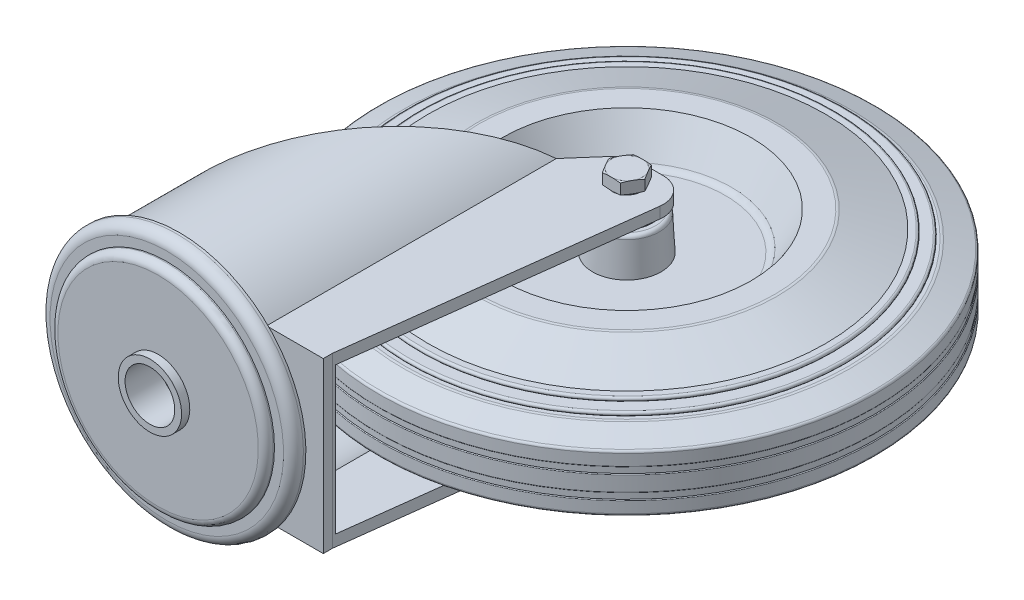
ISO-10303-21;
HEADER;
FILE_DESCRIPTION(('STEP AP214'),'2;1');
FILE_NAME('part.step','',(''),(''),'','','');
FILE_SCHEMA(('AUTOMOTIVE_DESIGN { 1 0 10303 214 1 1 1 1 }'));
ENDSEC;
DATA;
#1=APPLICATION_CONTEXT('core data for automotive mechanical design processes');
#2=APPLICATION_PROTOCOL_DEFINITION('international standard','automotive_design',2000,#1);
#3=PRODUCT_CONTEXT('',#1,'mechanical');
#4=PRODUCT('Part','Part','',(#3));
#5=PRODUCT_RELATED_PRODUCT_CATEGORY('part','',(#4));
#6=PRODUCT_DEFINITION_FORMATION('','',#4);
#7=PRODUCT_DEFINITION_CONTEXT('part definition',#1,'design');
#8=PRODUCT_DEFINITION('design','',#6,#7);
#9=PRODUCT_DEFINITION_SHAPE('','',#8);
#10=(LENGTH_UNIT() NAMED_UNIT(*) SI_UNIT(.MILLI.,.METRE.));
#11=(NAMED_UNIT(*) PLANE_ANGLE_UNIT() SI_UNIT($,.RADIAN.));
#12=(NAMED_UNIT(*) SI_UNIT($,.STERADIAN.) SOLID_ANGLE_UNIT());
#13=UNCERTAINTY_MEASURE_WITH_UNIT(LENGTH_MEASURE(1.E-05),#10,'distance_accuracy_value','');
#14=(GEOMETRIC_REPRESENTATION_CONTEXT(3) GLOBAL_UNCERTAINTY_ASSIGNED_CONTEXT((#13)) GLOBAL_UNIT_ASSIGNED_CONTEXT((#10,
#11,#12)) REPRESENTATION_CONTEXT('',''));
#15=CARTESIAN_POINT('',(0.,0.,0.));
#16=DIRECTION('',(0.,0.,1.));
#17=DIRECTION('',(1.,0.,0.));
#18=AXIS2_PLACEMENT_3D('',#15,#16,#17);
#19=CARTESIAN_POINT('',(56.,-25.,-136.));
#20=DIRECTION('',(0.,-1.,0.));
#21=DIRECTION('',(1.,0.,0.));
#22=AXIS2_PLACEMENT_3D('',#19,#20,#21);
#23=CYLINDRICAL_SURFACE('',#22,100.);
#24=CARTESIAN_POINT('',(56.,3.,-136.));
#25=DIRECTION('',(0.,-1.,0.));
#26=DIRECTION('',(1.,0.,0.));
#27=AXIS2_PLACEMENT_3D('',#24,#25,#26);
#28=CIRCLE('',#27,100.);
#29=CARTESIAN_POINT('',(156.,3.,-136.));
#30=VERTEX_POINT('',#29);
#31=EDGE_CURVE('E3063',#30,#30,#28,.T.);
#32=ORIENTED_EDGE('',*,*,#31,.T.);
#33=EDGE_LOOP('',(#32));
#34=FACE_BOUND('',#33,.T.);
#35=CARTESIAN_POINT('',(56.,-3.,-136.));
#36=DIRECTION('',(0.,-1.,0.));
#37=DIRECTION('',(1.,0.,0.));
#38=AXIS2_PLACEMENT_3D('',#35,#36,#37);
#39=CIRCLE('',#38,100.);
#40=CARTESIAN_POINT('',(156.,-3.,-136.));
#41=VERTEX_POINT('',#40);
#42=EDGE_CURVE('E3065',#41,#41,#39,.T.);
#43=ORIENTED_EDGE('',*,*,#42,.F.);
#44=EDGE_LOOP('',(#43));
#45=FACE_BOUND('',#44,.T.);
#46=ADVANCED_FACE('F14',(#34,#45),#23,.T.);
#47=CARTESIAN_POINT('',(56.,3.00000000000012,-136.));
#48=DIRECTION('',(0.,-1.,0.));
#49=DIRECTION('',(1.,0.,0.));
#50=AXIS2_PLACEMENT_3D('',#47,#48,#49);
#51=TOROIDAL_SURFACE('',#50,99.7,0.299999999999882);
#52=CARTESIAN_POINT('',(56.,3.3,-136.));
#53=DIRECTION('',(0.,-1.,0.));
#54=DIRECTION('',(1.,0.,0.));
#55=AXIS2_PLACEMENT_3D('',#52,#53,#54);
#56=CIRCLE('',#55,99.7);
#57=CARTESIAN_POINT('',(155.7,3.3,-136.));
#58=VERTEX_POINT('',#57);
#59=EDGE_CURVE('E3060',#58,#58,#56,.T.);
#60=ORIENTED_EDGE('',*,*,#59,.T.);
#61=EDGE_LOOP('',(#60));
#62=FACE_BOUND('',#61,.T.);
#63=ORIENTED_EDGE('',*,*,#31,.F.);
#64=EDGE_LOOP('',(#63));
#65=FACE_BOUND('',#64,.T.);
#66=ADVANCED_FACE('F625',(#62,#65),#51,.T.);
#67=CARTESIAN_POINT('',(56.,-25.,-136.));
#68=DIRECTION('',(0.,-1.,0.));
#69=DIRECTION('',(1.,0.,0.));
#70=AXIS2_PLACEMENT_3D('',#67,#68,#69);
#71=CYLINDRICAL_SURFACE('',#70,99.7);
#72=CARTESIAN_POINT('',(56.,5.7,-136.));
#73=DIRECTION('',(0.,-1.,0.));
#74=DIRECTION('',(1.,0.,0.));
#75=AXIS2_PLACEMENT_3D('',#72,#73,#74);
#76=CIRCLE('',#75,99.7);
#77=CARTESIAN_POINT('',(155.7,5.7,-136.));
#78=VERTEX_POINT('',#77);
#79=EDGE_CURVE('E3057',#78,#78,#76,.T.);
#80=ORIENTED_EDGE('',*,*,#79,.T.);
#81=EDGE_LOOP('',(#80));
#82=FACE_BOUND('',#81,.T.);
#83=ORIENTED_EDGE('',*,*,#59,.F.);
#84=EDGE_LOOP('',(#83));
#85=FACE_BOUND('',#84,.T.);
#86=ADVANCED_FACE('F632',(#82,#85),#71,.T.);
#87=CARTESIAN_POINT('',(56.,5.99999999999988,-136.));
#88=DIRECTION('',(0.,-1.,0.));
#89=DIRECTION('',(1.,0.,0.));
#90=AXIS2_PLACEMENT_3D('',#87,#88,#89);
#91=TOROIDAL_SURFACE('',#90,99.7,0.299999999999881);
#92=CARTESIAN_POINT('',(56.,6.,-136.));
#93=DIRECTION('',(0.,-1.,0.));
#94=DIRECTION('',(1.,0.,0.));
#95=AXIS2_PLACEMENT_3D('',#92,#93,#94);
#96=CIRCLE('',#95,100.);
#97=CARTESIAN_POINT('',(156.,6.,-136.));
#98=VERTEX_POINT('',#97);
#99=EDGE_CURVE('E3054',#98,#98,#96,.T.);
#100=ORIENTED_EDGE('',*,*,#99,.T.);
#101=EDGE_LOOP('',(#100));
#102=FACE_BOUND('',#101,.T.);
#103=ORIENTED_EDGE('',*,*,#79,.F.);
#104=EDGE_LOOP('',(#103));
#105=FACE_BOUND('',#104,.T.);
#106=ADVANCED_FACE('F1614',(#102,#105),#91,.T.);
#107=CARTESIAN_POINT('',(56.,-25.,-136.));
#108=DIRECTION('',(0.,-1.,0.));
#109=DIRECTION('',(1.,0.,0.));
#110=AXIS2_PLACEMENT_3D('',#107,#108,#109);
#111=CYLINDRICAL_SURFACE('',#110,100.);
#112=CARTESIAN_POINT('',(56.,10.513602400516,-136.));
#113=DIRECTION('',(0.,-1.,0.));
#114=DIRECTION('',(1.,0.,0.));
#115=AXIS2_PLACEMENT_3D('',#112,#113,#114);
#116=CIRCLE('',#115,100.);
#117=CARTESIAN_POINT('',(156.,10.513602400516,-136.));
#118=VERTEX_POINT('',#117);
#119=EDGE_CURVE('E3051',#118,#118,#116,.T.);
#120=ORIENTED_EDGE('',*,*,#119,.T.);
#121=EDGE_LOOP('',(#120));
#122=FACE_BOUND('',#121,.T.);
#123=ORIENTED_EDGE('',*,*,#99,.F.);
#124=EDGE_LOOP('',(#123));
#125=FACE_BOUND('',#124,.T.);
#126=ADVANCED_FACE('F1578',(#122,#125),#111,.T.);
#127=CARTESIAN_POINT('',(56.,10.5136024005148,-136.));
#128=DIRECTION('',(0.,-1.,0.));
#129=DIRECTION('',(1.,0.,0.));
#130=AXIS2_PLACEMENT_3D('',#127,#128,#129);
#131=TOROIDAL_SURFACE('',#130,98.9999999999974,1.00000000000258);
#132=CARTESIAN_POINT('',(56.,11.459120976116,-136.));
#133=DIRECTION('',(0.,-1.,0.));
#134=DIRECTION('',(1.,0.,0.));
#135=AXIS2_PLACEMENT_3D('',#132,#133,#134);
#136=CIRCLE('',#135,99.325568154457);
#137=CARTESIAN_POINT('',(155.325568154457,11.459120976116,-136.));
#138=VERTEX_POINT('',#137);
#139=EDGE_CURVE('E3048',#138,#138,#136,.T.);
#140=ORIENTED_EDGE('',*,*,#139,.T.);
#141=EDGE_LOOP('',(#140));
#142=FACE_BOUND('',#141,.T.);
#143=ORIENTED_EDGE('',*,*,#119,.F.);
#144=EDGE_LOOP('',(#143));
#145=FACE_BOUND('',#144,.T.);
#146=ADVANCED_FACE('F1567',(#142,#145),#131,.T.);
#147=CARTESIAN_POINT('',(56.,11.459120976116,-136.));
#148=DIRECTION('',(0.,-1.,0.));
#149=DIRECTION('',(1.,0.,0.));
#150=AXIS2_PLACEMENT_3D('',#147,#148,#149);
#151=CONICAL_SURFACE('',#150,99.325568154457,1.23918376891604);
#152=CARTESIAN_POINT('',(56.,14.616670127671,-136.));
#153=DIRECTION('',(0.,-1.,0.));
#154=DIRECTION('',(1.,0.,0.));
#155=AXIS2_PLACEMENT_3D('',#152,#153,#154);
#156=CIRCLE('',#155,90.155379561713);
#157=CARTESIAN_POINT('',(146.155379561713,14.616670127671,-136.));
#158=VERTEX_POINT('',#157);
#159=EDGE_CURVE('E3045',#158,#158,#156,.T.);
#160=ORIENTED_EDGE('',*,*,#159,.T.);
#161=EDGE_LOOP('',(#160));
#162=FACE_BOUND('',#161,.T.);
#163=ORIENTED_EDGE('',*,*,#139,.F.);
#164=EDGE_LOOP('',(#163));
#165=FACE_BOUND('',#164,.T.);
#166=ADVANCED_FACE('F1556',(#162,#165),#151,.T.);
#167=CARTESIAN_POINT('',(56.,11.7801144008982,-136.));
#168=DIRECTION('',(0.,-1.,0.));
#169=DIRECTION('',(1.,0.,0.));
#170=AXIS2_PLACEMENT_3D('',#167,#168,#169);
#171=TOROIDAL_SURFACE('',#170,89.1786750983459,2.99999999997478);
#172=CARTESIAN_POINT('',(56.,14.780114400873,-136.));
#173=DIRECTION('',(0.,-1.,0.));
#174=DIRECTION('',(1.,0.,0.));
#175=AXIS2_PLACEMENT_3D('',#172,#173,#174);
#176=CIRCLE('',#175,89.178675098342);
#177=CARTESIAN_POINT('',(145.178675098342,14.780114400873,-136.));
#178=VERTEX_POINT('',#177);
#179=EDGE_CURVE('E3042',#178,#178,#176,.T.);
#180=ORIENTED_EDGE('',*,*,#179,.T.);
#181=EDGE_LOOP('',(#180));
#182=FACE_BOUND('',#181,.T.);
#183=ORIENTED_EDGE('',*,*,#159,.F.);
#184=EDGE_LOOP('',(#183));
#185=FACE_BOUND('',#184,.T.);
#186=ADVANCED_FACE('F1545',(#182,#185),#171,.T.);
#187=CARTESIAN_POINT('',(145.178675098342,14.780114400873,-136.));
#188=DIRECTION('',(0.,1.,0.));
#189=DIRECTION('',(-1.,0.,0.));
#190=AXIS2_PLACEMENT_3D('',#187,#188,#189);
#191=PLANE('',#190);
#192=CARTESIAN_POINT('',(56.,14.780114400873,-136.));
#193=DIRECTION('',(0.,-1.,0.));
#194=DIRECTION('',(1.,0.,0.));
#195=AXIS2_PLACEMENT_3D('',#192,#193,#194);
#196=CIRCLE('',#195,87.26052719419);
#197=CARTESIAN_POINT('',(143.26052719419,14.780114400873,-136.));
#198=VERTEX_POINT('',#197);
#199=EDGE_CURVE('E3039',#198,#198,#196,.T.);
#200=ORIENTED_EDGE('',*,*,#199,.T.);
#201=EDGE_LOOP('',(#200));
#202=FACE_BOUND('',#201,.T.);
#203=ORIENTED_EDGE('',*,*,#179,.F.);
#204=EDGE_LOOP('',(#203));
#205=FACE_BOUND('',#204,.T.);
#206=ADVANCED_FACE('F1534',(#202,#205),#191,.T.);
#207=CARTESIAN_POINT('',(56.,15.6134477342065,-136.));
#208=DIRECTION('',(0.,-1.,0.));
#209=DIRECTION('',(1.,0.,0.));
#210=AXIS2_PLACEMENT_3D('',#207,#208,#209);
#211=TOROIDAL_SURFACE('',#210,87.2605271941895,0.833333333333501);
#212=CARTESIAN_POINT('',(56.,16.44678106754,-136.));
#213=DIRECTION('',(0.,-1.,0.));
#214=DIRECTION('',(1.,0.,0.));
#215=AXIS2_PLACEMENT_3D('',#212,#213,#214);
#216=CIRCLE('',#215,87.26052719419);
#217=CARTESIAN_POINT('',(143.26052719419,16.44678106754,-136.));
#218=VERTEX_POINT('',#217);
#219=EDGE_CURVE('E3036',#218,#218,#216,.T.);
#220=ORIENTED_EDGE('',*,*,#219,.T.);
#221=EDGE_LOOP('',(#220));
#222=FACE_BOUND('',#221,.T.);
#223=ORIENTED_EDGE('',*,*,#199,.F.);
#224=EDGE_LOOP('',(#223));
#225=FACE_BOUND('',#224,.T.);
#226=ADVANCED_FACE('F1523',(#222,#225),#211,.T.);
#227=CARTESIAN_POINT('',(143.26052719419,16.44678106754,-136.));
#228=DIRECTION('',(0.,1.,0.));
#229=DIRECTION('',(-1.,0.,0.));
#230=AXIS2_PLACEMENT_3D('',#227,#228,#229);
#231=PLANE('',#230);
#232=CARTESIAN_POINT('',(56.,16.44678106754,-136.));
#233=DIRECTION('',(0.,-1.,0.));
#234=DIRECTION('',(1.,0.,0.));
#235=AXIS2_PLACEMENT_3D('',#232,#233,#234);
#236=CIRCLE('',#235,82.420175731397);
#237=CARTESIAN_POINT('',(138.420175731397,16.44678106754,-136.));
#238=VERTEX_POINT('',#237);
#239=EDGE_CURVE('E3033',#238,#238,#236,.T.);
#240=ORIENTED_EDGE('',*,*,#239,.T.);
#241=EDGE_LOOP('',(#240));
#242=FACE_BOUND('',#241,.T.);
#243=ORIENTED_EDGE('',*,*,#219,.F.);
#244=EDGE_LOOP('',(#243));
#245=FACE_BOUND('',#244,.T.);
#246=ADVANCED_FACE('F1512',(#242,#245),#231,.T.);
#247=CARTESIAN_POINT('',(56.,17.2801144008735,-136.));
#248=DIRECTION('',(0.,-1.,0.));
#249=DIRECTION('',(1.,0.,0.));
#250=AXIS2_PLACEMENT_3D('',#247,#248,#249);
#251=TOROIDAL_SURFACE('',#250,82.4201757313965,0.8333333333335);
#252=CARTESIAN_POINT('',(56.,18.113447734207,-136.));
#253=DIRECTION('',(0.,-1.,0.));
#254=DIRECTION('',(1.,0.,0.));
#255=AXIS2_PLACEMENT_3D('',#252,#253,#254);
#256=CIRCLE('',#255,82.420175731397);
#257=CARTESIAN_POINT('',(138.420175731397,18.113447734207,-136.));
#258=VERTEX_POINT('',#257);
#259=EDGE_CURVE('E3030',#258,#258,#256,.T.);
#260=ORIENTED_EDGE('',*,*,#259,.T.);
#261=EDGE_LOOP('',(#260));
#262=FACE_BOUND('',#261,.T.);
#263=ORIENTED_EDGE('',*,*,#239,.F.);
#264=EDGE_LOOP('',(#263));
#265=FACE_BOUND('',#264,.T.);
#266=ADVANCED_FACE('F1493',(#262,#265),#251,.T.);
#267=CARTESIAN_POINT('',(138.420175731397,18.113447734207,-136.));
#268=DIRECTION('',(0.,1.,0.));
#269=DIRECTION('',(-1.,0.,0.));
#270=AXIS2_PLACEMENT_3D('',#267,#268,#269);
#271=PLANE('',#270);
#272=CARTESIAN_POINT('',(56.,18.113447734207,-136.));
#273=DIRECTION('',(0.,-1.,0.));
#274=DIRECTION('',(1.,0.,0.));
#275=AXIS2_PLACEMENT_3D('',#272,#273,#274);
#276=CIRCLE('',#275,80.);
#277=CARTESIAN_POINT('',(136.,18.113447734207,-136.));
#278=VERTEX_POINT('',#277);
#279=EDGE_CURVE('E3027',#278,#278,#276,.T.);
#280=ORIENTED_EDGE('',*,*,#279,.T.);
#281=EDGE_LOOP('',(#280));
#282=FACE_BOUND('',#281,.T.);
#283=ORIENTED_EDGE('',*,*,#259,.F.);
#284=EDGE_LOOP('',(#283));
#285=FACE_BOUND('',#284,.T.);
#286=ADVANCED_FACE('F1488',(#282,#285),#271,.T.);
#287=CARTESIAN_POINT('',(56.,18.113447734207,-136.));
#288=DIRECTION('',(0.,-1.,0.));
#289=DIRECTION('',(1.,0.,0.));
#290=AXIS2_PLACEMENT_3D('',#287,#288,#289);
#291=CONICAL_SURFACE('',#290,80.,1.23918376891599);
#292=CARTESIAN_POINT('',(56.,24.836555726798,-136.));
#293=DIRECTION('',(0.,-1.,0.));
#294=DIRECTION('',(1.,0.,0.));
#295=AXIS2_PLACEMENT_3D('',#292,#293,#294);
#296=CIRCLE('',#295,60.474676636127);
#297=CARTESIAN_POINT('',(116.474676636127,24.836555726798,-136.));
#298=VERTEX_POINT('',#297);
#299=EDGE_CURVE('E3024',#298,#298,#296,.T.);
#300=ORIENTED_EDGE('',*,*,#299,.T.);
#301=EDGE_LOOP('',(#300));
#302=FACE_BOUND('',#301,.T.);
#303=ORIENTED_EDGE('',*,*,#279,.F.);
#304=EDGE_LOOP('',(#303));
#305=FACE_BOUND('',#304,.T.);
#306=ADVANCED_FACE('F1477',(#302,#305),#291,.T.);
#307=CARTESIAN_POINT('',(56.,22.0000000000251,-136.));
#308=DIRECTION('',(0.,-1.,0.));
#309=DIRECTION('',(1.,0.,0.));
#310=AXIS2_PLACEMENT_3D('',#307,#308,#309);
#311=TOROIDAL_SURFACE('',#310,59.4979721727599,2.99999999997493);
#312=CARTESIAN_POINT('',(56.,25.,-136.));
#313=DIRECTION('',(0.,-1.,0.));
#314=DIRECTION('',(1.,0.,0.));
#315=AXIS2_PLACEMENT_3D('',#312,#313,#314);
#316=CIRCLE('',#315,59.497972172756);
#317=CARTESIAN_POINT('',(115.497972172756,25.,-136.));
#318=VERTEX_POINT('',#317);
#319=EDGE_CURVE('E3021',#318,#318,#316,.T.);
#320=ORIENTED_EDGE('',*,*,#319,.T.);
#321=EDGE_LOOP('',(#320));
#322=FACE_BOUND('',#321,.T.);
#323=ORIENTED_EDGE('',*,*,#299,.F.);
#324=EDGE_LOOP('',(#323));
#325=FACE_BOUND('',#324,.T.);
#326=ADVANCED_FACE('F1471',(#322,#325),#311,.T.);
#327=CARTESIAN_POINT('',(115.497972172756,25.,-136.));
#328=DIRECTION('',(0.,1.,0.));
#329=DIRECTION('',(-1.,0.,0.));
#330=AXIS2_PLACEMENT_3D('',#327,#328,#329);
#331=PLANE('',#330);
#332=CARTESIAN_POINT('',(56.,25.,-136.));
#333=DIRECTION('',(0.,-1.,0.));
#334=DIRECTION('',(1.,0.,0.));
#335=AXIS2_PLACEMENT_3D('',#332,#333,#334);
#336=CIRCLE('',#335,50.);
#337=CARTESIAN_POINT('',(106.,25.,-136.));
#338=VERTEX_POINT('',#337);
#339=EDGE_CURVE('E3012',#338,#338,#336,.T.);
#340=ORIENTED_EDGE('',*,*,#339,.T.);
#341=EDGE_LOOP('',(#340));
#342=FACE_BOUND('',#341,.T.);
#343=ORIENTED_EDGE('',*,*,#319,.F.);
#344=EDGE_LOOP('',(#343));
#345=FACE_BOUND('',#344,.T.);
#346=ADVANCED_FACE('F1476',(#342,#345),#331,.T.);
#347=CARTESIAN_POINT('',(56.,25.,-136.));
#348=DIRECTION('',(0.,1.,0.));
#349=DIRECTION('',(-1.,0.,0.));
#350=AXIS2_PLACEMENT_3D('',#347,#348,#349);
#351=CONICAL_SURFACE('',#350,50.,0.5235987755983);
#352=CARTESIAN_POINT('',(56.,11.5,-136.));
#353=DIRECTION('',(0.,-1.,0.));
#354=DIRECTION('',(1.,0.,0.));
#355=AXIS2_PLACEMENT_3D('',#352,#353,#354);
#356=CIRCLE('',#355,42.20577136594);
#357=CARTESIAN_POINT('',(98.20577136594,11.5,-136.));
#358=VERTEX_POINT('',#357);
#359=EDGE_CURVE('E3008',#358,#358,#356,.T.);
#360=ORIENTED_EDGE('',*,*,#359,.T.);
#361=EDGE_LOOP('',(#360));
#362=FACE_BOUND('',#361,.T.);
#363=ORIENTED_EDGE('',*,*,#339,.F.);
#364=EDGE_LOOP('',(#363));
#365=FACE_BOUND('',#364,.T.);
#366=ADVANCED_FACE('F1801',(#362,#365),#351,.F.);
#367=CARTESIAN_POINT('',(56.,13.0000000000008,-136.));
#368=DIRECTION('',(0.,-1.,0.));
#369=DIRECTION('',(1.,0.,0.));
#370=AXIS2_PLACEMENT_3D('',#367,#368,#369);
#371=TOROIDAL_SURFACE('',#370,39.6076951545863,3.00000000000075);
#372=CARTESIAN_POINT('',(56.,10.,-136.));
#373=DIRECTION('',(0.,-1.,0.));
#374=DIRECTION('',(1.,0.,0.));
#375=AXIS2_PLACEMENT_3D('',#372,#373,#374);
#376=CIRCLE('',#375,39.607695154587);
#377=CARTESIAN_POINT('',(95.607695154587,10.,-136.));
#378=VERTEX_POINT('',#377);
#379=EDGE_CURVE('E3007',#378,#378,#376,.T.);
#380=ORIENTED_EDGE('',*,*,#379,.T.);
#381=EDGE_LOOP('',(#380));
#382=FACE_BOUND('',#381,.T.);
#383=ORIENTED_EDGE('',*,*,#359,.F.);
#384=EDGE_LOOP('',(#383));
#385=FACE_BOUND('',#384,.T.);
#386=ADVANCED_FACE('F1812',(#382,#385),#371,.F.);
#387=CARTESIAN_POINT('',(95.607695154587,10.,-136.));
#388=DIRECTION('',(0.,1.,0.));
#389=DIRECTION('',(-1.,0.,0.));
#390=AXIS2_PLACEMENT_3D('',#387,#388,#389);
#391=PLANE('',#390);
#392=CARTESIAN_POINT('',(56.,10.,-136.));
#393=DIRECTION('',(0.,1.,0.));
#394=DIRECTION('',(-1.,0.,0.));
#395=AXIS2_PLACEMENT_3D('',#392,#393,#394);
#396=CIRCLE('',#395,13.7861166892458);
#397=CARTESIAN_POINT('',(42.2138833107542,10.,-136.));
#398=VERTEX_POINT('',#397);
#399=EDGE_CURVE('E9',#398,#398,#396,.T.);
#400=ORIENTED_EDGE('',*,*,#399,.F.);
#401=EDGE_LOOP('',(#400));
#402=FACE_BOUND('',#401,.T.);
#403=ORIENTED_EDGE('',*,*,#379,.F.);
#404=EDGE_LOOP('',(#403));
#405=FACE_BOUND('',#404,.T.);
#406=ADVANCED_FACE('F1790',(#402,#405),#391,.T.);
#407=CARTESIAN_POINT('',(56.,0.,-136.));
#408=DIRECTION('',(0.,-1.,0.));
#409=DIRECTION('',(1.,0.,0.));
#410=AXIS2_PLACEMENT_3D('',#407,#408,#409);
#411=CONICAL_SURFACE('',#410,14.310194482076,0.0523598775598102);
#412=CARTESIAN_POINT('',(56.,23.578503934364,-136.));
#413=DIRECTION('',(0.,-1.,0.));
#414=DIRECTION('',(1.,0.,0.));
#415=AXIS2_PLACEMENT_3D('',#412,#413,#414);
#416=CIRCLE('',#415,13.07449745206);
#417=CARTESIAN_POINT('',(69.07449745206,23.578503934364,-136.));
#418=VERTEX_POINT('',#417);
#419=EDGE_CURVE('E3088',#418,#418,#416,.T.);
#420=ORIENTED_EDGE('',*,*,#419,.T.);
#421=EDGE_LOOP('',(#420));
#422=FACE_BOUND('',#421,.T.);
#423=ORIENTED_EDGE('',*,*,#399,.T.);
#424=EDGE_LOOP('',(#423));
#425=FACE_BOUND('',#424,.T.);
#426=ADVANCED_FACE('F1779',(#422,#425),#411,.T.);
#427=CARTESIAN_POINT('',(56.,23.4999999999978,-136.));
#428=DIRECTION('',(0.,-1.,0.));
#429=DIRECTION('',(1.,0.,0.));
#430=AXIS2_PLACEMENT_3D('',#427,#428,#429);
#431=TOROIDAL_SURFACE('',#430,11.576553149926,1.50000000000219);
#432=CARTESIAN_POINT('',(56.,25.,-136.));
#433=DIRECTION('',(0.,-1.,0.));
#434=DIRECTION('',(1.,0.,0.));
#435=AXIS2_PLACEMENT_3D('',#432,#433,#434);
#436=CIRCLE('',#435,11.576553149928);
#437=CARTESIAN_POINT('',(67.576553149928,25.,-136.));
#438=VERTEX_POINT('',#437);
#439=EDGE_CURVE('E3085',#438,#438,#436,.T.);
#440=ORIENTED_EDGE('',*,*,#439,.T.);
#441=EDGE_LOOP('',(#440));
#442=FACE_BOUND('',#441,.T.);
#443=ORIENTED_EDGE('',*,*,#419,.F.);
#444=EDGE_LOOP('',(#443));
#445=FACE_BOUND('',#444,.T.);
#446=ADVANCED_FACE('F1768',(#442,#445),#431,.T.);
#447=CARTESIAN_POINT('',(67.576553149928,25.,-136.));
#448=DIRECTION('',(0.,1.,0.));
#449=DIRECTION('',(-1.,0.,0.));
#450=AXIS2_PLACEMENT_3D('',#447,#448,#449);
#451=PLANE('',#450);
#452=CARTESIAN_POINT('',(56.,25.,-136.));
#453=DIRECTION('',(0.,-1.,0.));
#454=DIRECTION('',(1.,0.,0.));
#455=AXIS2_PLACEMENT_3D('',#452,#453,#454);
#456=CIRCLE('',#455,10.);
#457=CARTESIAN_POINT('',(66.,25.,-136.));
#458=VERTEX_POINT('',#457);
#459=EDGE_CURVE('E3080',#458,#458,#456,.T.);
#460=ORIENTED_EDGE('',*,*,#459,.T.);
#461=EDGE_LOOP('',(#460));
#462=FACE_BOUND('',#461,.T.);
#463=ORIENTED_EDGE('',*,*,#439,.F.);
#464=EDGE_LOOP('',(#463));
#465=FACE_BOUND('',#464,.T.);
#466=ADVANCED_FACE('F643',(#462,#465),#451,.T.);
#467=CARTESIAN_POINT('',(56.,-3.00000000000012,-136.));
#468=DIRECTION('',(0.,-1.,0.));
#469=DIRECTION('',(1.,0.,0.));
#470=AXIS2_PLACEMENT_3D('',#467,#468,#469);
#471=TOROIDAL_SURFACE('',#470,99.7,0.299999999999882);
#472=ORIENTED_EDGE('',*,*,#42,.T.);
#473=EDGE_LOOP('',(#472));
#474=FACE_BOUND('',#473,.T.);
#475=CARTESIAN_POINT('',(56.,-3.3,-136.));
#476=DIRECTION('',(0.,-1.,0.));
#477=DIRECTION('',(1.,0.,0.));
#478=AXIS2_PLACEMENT_3D('',#475,#476,#477);
#479=CIRCLE('',#478,99.7);
#480=CARTESIAN_POINT('',(155.7,-3.3,-136.));
#481=VERTEX_POINT('',#480);
#482=EDGE_CURVE('E3091',#481,#481,#479,.T.);
#483=ORIENTED_EDGE('',*,*,#482,.F.);
#484=EDGE_LOOP('',(#483));
#485=FACE_BOUND('',#484,.T.);
#486=ADVANCED_FACE('F639',(#474,#485),#471,.T.);
#487=CARTESIAN_POINT('',(56.,-25.,-136.));
#488=DIRECTION('',(0.,-1.,0.));
#489=DIRECTION('',(1.,0.,0.));
#490=AXIS2_PLACEMENT_3D('',#487,#488,#489);
#491=CYLINDRICAL_SURFACE('',#490,99.7);
#492=ORIENTED_EDGE('',*,*,#482,.T.);
#493=EDGE_LOOP('',(#492));
#494=FACE_BOUND('',#493,.T.);
#495=CARTESIAN_POINT('',(56.,-5.7,-136.));
#496=DIRECTION('',(0.,-1.,0.));
#497=DIRECTION('',(1.,0.,0.));
#498=AXIS2_PLACEMENT_3D('',#495,#496,#497);
#499=CIRCLE('',#498,99.7);
#500=CARTESIAN_POINT('',(155.7,-5.7,-136.));
#501=VERTEX_POINT('',#500);
#502=EDGE_CURVE('E3094',#501,#501,#499,.T.);
#503=ORIENTED_EDGE('',*,*,#502,.F.);
#504=EDGE_LOOP('',(#503));
#505=FACE_BOUND('',#504,.T.);
#506=ADVANCED_FACE('F642',(#494,#505),#491,.T.);
#507=CARTESIAN_POINT('',(56.,-5.99999999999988,-136.));
#508=DIRECTION('',(0.,-1.,0.));
#509=DIRECTION('',(1.,0.,0.));
#510=AXIS2_PLACEMENT_3D('',#507,#508,#509);
#511=TOROIDAL_SURFACE('',#510,99.7,0.299999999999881);
#512=ORIENTED_EDGE('',*,*,#502,.T.);
#513=EDGE_LOOP('',(#512));
#514=FACE_BOUND('',#513,.T.);
#515=CARTESIAN_POINT('',(56.,-6.,-136.));
#516=DIRECTION('',(0.,-1.,0.));
#517=DIRECTION('',(1.,0.,0.));
#518=AXIS2_PLACEMENT_3D('',#515,#516,#517);
#519=CIRCLE('',#518,100.);
#520=CARTESIAN_POINT('',(156.,-6.,-136.));
#521=VERTEX_POINT('',#520);
#522=EDGE_CURVE('E3097',#521,#521,#519,.T.);
#523=ORIENTED_EDGE('',*,*,#522,.F.);
#524=EDGE_LOOP('',(#523));
#525=FACE_BOUND('',#524,.T.);
#526=ADVANCED_FACE('F1591',(#514,#525),#511,.T.);
#527=CARTESIAN_POINT('',(56.,-25.,-136.));
#528=DIRECTION('',(0.,-1.,0.));
#529=DIRECTION('',(1.,0.,0.));
#530=AXIS2_PLACEMENT_3D('',#527,#528,#529);
#531=CYLINDRICAL_SURFACE('',#530,100.);
#532=ORIENTED_EDGE('',*,*,#522,.T.);
#533=EDGE_LOOP('',(#532));
#534=FACE_BOUND('',#533,.T.);
#535=CARTESIAN_POINT('',(56.,-10.513602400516,-136.));
#536=DIRECTION('',(0.,-1.,0.));
#537=DIRECTION('',(1.,0.,0.));
#538=AXIS2_PLACEMENT_3D('',#535,#536,#537);
#539=CIRCLE('',#538,100.);
#540=CARTESIAN_POINT('',(156.,-10.513602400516,-136.));
#541=VERTEX_POINT('',#540);
#542=EDGE_CURVE('E3100',#541,#541,#539,.T.);
#543=ORIENTED_EDGE('',*,*,#542,.F.);
#544=EDGE_LOOP('',(#543));
#545=FACE_BOUND('',#544,.T.);
#546=ADVANCED_FACE('F1603',(#534,#545),#531,.T.);
#547=CARTESIAN_POINT('',(56.,-10.5136024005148,-136.));
#548=DIRECTION('',(0.,-1.,0.));
#549=DIRECTION('',(1.,0.,0.));
#550=AXIS2_PLACEMENT_3D('',#547,#548,#549);
#551=TOROIDAL_SURFACE('',#550,98.9999999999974,1.00000000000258);
#552=ORIENTED_EDGE('',*,*,#542,.T.);
#553=EDGE_LOOP('',(#552));
#554=FACE_BOUND('',#553,.T.);
#555=CARTESIAN_POINT('',(56.,-11.459120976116,-136.));
#556=DIRECTION('',(0.,-1.,0.));
#557=DIRECTION('',(1.,0.,0.));
#558=AXIS2_PLACEMENT_3D('',#555,#556,#557);
#559=CIRCLE('',#558,99.325568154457);
#560=CARTESIAN_POINT('',(155.325568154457,-11.459120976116,-136.));
#561=VERTEX_POINT('',#560);
#562=EDGE_CURVE('E3103',#561,#561,#559,.T.);
#563=ORIENTED_EDGE('',*,*,#562,.F.);
#564=EDGE_LOOP('',(#563));
#565=FACE_BOUND('',#564,.T.);
#566=ADVANCED_FACE('F1635',(#554,#565),#551,.T.);
#567=CARTESIAN_POINT('',(56.,-14.616670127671,-136.));
#568=DIRECTION('',(0.,1.,0.));
#569=DIRECTION('',(-1.,0.,0.));
#570=AXIS2_PLACEMENT_3D('',#567,#568,#569);
#571=CONICAL_SURFACE('',#570,90.155379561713,1.23918376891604);
#572=ORIENTED_EDGE('',*,*,#562,.T.);
#573=EDGE_LOOP('',(#572));
#574=FACE_BOUND('',#573,.T.);
#575=CARTESIAN_POINT('',(56.,-14.616670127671,-136.));
#576=DIRECTION('',(0.,-1.,0.));
#577=DIRECTION('',(1.,0.,0.));
#578=AXIS2_PLACEMENT_3D('',#575,#576,#577);
#579=CIRCLE('',#578,90.155379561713);
#580=CARTESIAN_POINT('',(146.155379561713,-14.616670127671,-136.));
#581=VERTEX_POINT('',#580);
#582=EDGE_CURVE('E3106',#581,#581,#579,.T.);
#583=ORIENTED_EDGE('',*,*,#582,.F.);
#584=EDGE_LOOP('',(#583));
#585=FACE_BOUND('',#584,.T.);
#586=ADVANCED_FACE('F1654',(#574,#585),#571,.T.);
#587=CARTESIAN_POINT('',(56.,-11.7801144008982,-136.));
#588=DIRECTION('',(0.,-1.,0.));
#589=DIRECTION('',(1.,0.,0.));
#590=AXIS2_PLACEMENT_3D('',#587,#588,#589);
#591=TOROIDAL_SURFACE('',#590,89.1786750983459,2.99999999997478);
#592=ORIENTED_EDGE('',*,*,#582,.T.);
#593=EDGE_LOOP('',(#592));
#594=FACE_BOUND('',#593,.T.);
#595=CARTESIAN_POINT('',(56.,-14.780114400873,-136.));
#596=DIRECTION('',(0.,-1.,0.));
#597=DIRECTION('',(1.,0.,0.));
#598=AXIS2_PLACEMENT_3D('',#595,#596,#597);
#599=CIRCLE('',#598,89.178675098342);
#600=CARTESIAN_POINT('',(145.178675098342,-14.780114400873,-136.));
#601=VERTEX_POINT('',#600);
#602=EDGE_CURVE('E3109',#601,#601,#599,.T.);
#603=ORIENTED_EDGE('',*,*,#602,.F.);
#604=EDGE_LOOP('',(#603));
#605=FACE_BOUND('',#604,.T.);
#606=ADVANCED_FACE('F1665',(#594,#605),#591,.T.);
#607=CARTESIAN_POINT('',(143.26052719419,-14.780114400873,-136.));
#608=DIRECTION('',(0.,-1.,0.));
#609=DIRECTION('',(1.,0.,0.));
#610=AXIS2_PLACEMENT_3D('',#607,#608,#609);
#611=PLANE('',#610);
#612=ORIENTED_EDGE('',*,*,#602,.T.);
#613=EDGE_LOOP('',(#612));
#614=FACE_BOUND('',#613,.T.);
#615=CARTESIAN_POINT('',(56.,-14.780114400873,-136.));
#616=DIRECTION('',(0.,-1.,0.));
#617=DIRECTION('',(1.,0.,0.));
#618=AXIS2_PLACEMENT_3D('',#615,#616,#617);
#619=CIRCLE('',#618,87.26052719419);
#620=CARTESIAN_POINT('',(143.26052719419,-14.780114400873,-136.));
#621=VERTEX_POINT('',#620);
#622=EDGE_CURVE('E3112',#621,#621,#619,.T.);
#623=ORIENTED_EDGE('',*,*,#622,.F.);
#624=EDGE_LOOP('',(#623));
#625=FACE_BOUND('',#624,.T.);
#626=ADVANCED_FACE('F1405',(#614,#625),#611,.T.);
#627=CARTESIAN_POINT('',(56.,-15.6134477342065,-136.));
#628=DIRECTION('',(0.,-1.,0.));
#629=DIRECTION('',(1.,0.,0.));
#630=AXIS2_PLACEMENT_3D('',#627,#628,#629);
#631=TOROIDAL_SURFACE('',#630,87.2605271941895,0.833333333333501);
#632=ORIENTED_EDGE('',*,*,#622,.T.);
#633=EDGE_LOOP('',(#632));
#634=FACE_BOUND('',#633,.T.);
#635=CARTESIAN_POINT('',(56.,-16.44678106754,-136.));
#636=DIRECTION('',(0.,-1.,0.));
#637=DIRECTION('',(1.,0.,0.));
#638=AXIS2_PLACEMENT_3D('',#635,#636,#637);
#639=CIRCLE('',#638,87.26052719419);
#640=CARTESIAN_POINT('',(143.26052719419,-16.44678106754,-136.));
#641=VERTEX_POINT('',#640);
#642=EDGE_CURVE('E3115',#641,#641,#639,.T.);
#643=ORIENTED_EDGE('',*,*,#642,.F.);
#644=EDGE_LOOP('',(#643));
#645=FACE_BOUND('',#644,.T.);
#646=ADVANCED_FACE('F1399',(#634,#645),#631,.T.);
#647=CARTESIAN_POINT('',(138.420175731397,-16.44678106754,-136.));
#648=DIRECTION('',(0.,-1.,0.));
#649=DIRECTION('',(1.,0.,0.));
#650=AXIS2_PLACEMENT_3D('',#647,#648,#649);
#651=PLANE('',#650);
#652=ORIENTED_EDGE('',*,*,#642,.T.);
#653=EDGE_LOOP('',(#652));
#654=FACE_BOUND('',#653,.T.);
#655=CARTESIAN_POINT('',(56.,-16.44678106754,-136.));
#656=DIRECTION('',(0.,-1.,0.));
#657=DIRECTION('',(1.,0.,0.));
#658=AXIS2_PLACEMENT_3D('',#655,#656,#657);
#659=CIRCLE('',#658,82.420175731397);
#660=CARTESIAN_POINT('',(138.420175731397,-16.44678106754,-136.));
#661=VERTEX_POINT('',#660);
#662=EDGE_CURVE('E3118',#661,#661,#659,.T.);
#663=ORIENTED_EDGE('',*,*,#662,.F.);
#664=EDGE_LOOP('',(#663));
#665=FACE_BOUND('',#664,.T.);
#666=ADVANCED_FACE('F1404',(#654,#665),#651,.T.);
#667=CARTESIAN_POINT('',(56.,-17.2801144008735,-136.));
#668=DIRECTION('',(0.,-1.,0.));
#669=DIRECTION('',(1.,0.,0.));
#670=AXIS2_PLACEMENT_3D('',#667,#668,#669);
#671=TOROIDAL_SURFACE('',#670,82.4201757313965,0.8333333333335);
#672=ORIENTED_EDGE('',*,*,#662,.T.);
#673=EDGE_LOOP('',(#672));
#674=FACE_BOUND('',#673,.T.);
#675=CARTESIAN_POINT('',(56.,-18.113447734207,-136.));
#676=DIRECTION('',(0.,-1.,0.));
#677=DIRECTION('',(1.,0.,0.));
#678=AXIS2_PLACEMENT_3D('',#675,#676,#677);
#679=CIRCLE('',#678,82.420175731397);
#680=CARTESIAN_POINT('',(138.420175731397,-18.113447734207,-136.));
#681=VERTEX_POINT('',#680);
#682=EDGE_CURVE('E3121',#681,#681,#679,.T.);
#683=ORIENTED_EDGE('',*,*,#682,.F.);
#684=EDGE_LOOP('',(#683));
#685=FACE_BOUND('',#684,.T.);
#686=ADVANCED_FACE('F1418',(#674,#685),#671,.T.);
#687=CARTESIAN_POINT('',(136.,-18.113447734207,-136.));
#688=DIRECTION('',(0.,-1.,0.));
#689=DIRECTION('',(1.,0.,0.));
#690=AXIS2_PLACEMENT_3D('',#687,#688,#689);
#691=PLANE('',#690);
#692=ORIENTED_EDGE('',*,*,#682,.T.);
#693=EDGE_LOOP('',(#692));
#694=FACE_BOUND('',#693,.T.);
#695=CARTESIAN_POINT('',(56.,-18.113447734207,-136.));
#696=DIRECTION('',(0.,-1.,0.));
#697=DIRECTION('',(1.,0.,0.));
#698=AXIS2_PLACEMENT_3D('',#695,#696,#697);
#699=CIRCLE('',#698,80.);
#700=CARTESIAN_POINT('',(136.,-18.113447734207,-136.));
#701=VERTEX_POINT('',#700);
#702=EDGE_CURVE('E3124',#701,#701,#699,.T.);
#703=ORIENTED_EDGE('',*,*,#702,.F.);
#704=EDGE_LOOP('',(#703));
#705=FACE_BOUND('',#704,.T.);
#706=ADVANCED_FACE('F1429',(#694,#705),#691,.T.);
#707=CARTESIAN_POINT('',(56.,-24.836555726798,-136.));
#708=DIRECTION('',(0.,1.,0.));
#709=DIRECTION('',(-1.,0.,0.));
#710=AXIS2_PLACEMENT_3D('',#707,#708,#709);
#711=CONICAL_SURFACE('',#710,60.474676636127,1.23918376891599);
#712=ORIENTED_EDGE('',*,*,#702,.T.);
#713=EDGE_LOOP('',(#712));
#714=FACE_BOUND('',#713,.T.);
#715=CARTESIAN_POINT('',(56.,-24.836555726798,-136.));
#716=DIRECTION('',(0.,-1.,0.));
#717=DIRECTION('',(1.,0.,0.));
#718=AXIS2_PLACEMENT_3D('',#715,#716,#717);
#719=CIRCLE('',#718,60.474676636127);
#720=CARTESIAN_POINT('',(116.474676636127,-24.836555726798,-136.));
#721=VERTEX_POINT('',#720);
#722=EDGE_CURVE('E3127',#721,#721,#719,.T.);
#723=ORIENTED_EDGE('',*,*,#722,.F.);
#724=EDGE_LOOP('',(#723));
#725=FACE_BOUND('',#724,.T.);
#726=ADVANCED_FACE('F1440',(#714,#725),#711,.T.);
#727=CARTESIAN_POINT('',(56.,-22.000000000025,-136.));
#728=DIRECTION('',(0.,-1.,0.));
#729=DIRECTION('',(1.,0.,0.));
#730=AXIS2_PLACEMENT_3D('',#727,#728,#729);
#731=TOROIDAL_SURFACE('',#730,59.4979721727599,2.99999999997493);
#732=ORIENTED_EDGE('',*,*,#722,.T.);
#733=EDGE_LOOP('',(#732));
#734=FACE_BOUND('',#733,.T.);
#735=CARTESIAN_POINT('',(56.,-25.,-136.));
#736=DIRECTION('',(0.,-1.,0.));
#737=DIRECTION('',(1.,0.,0.));
#738=AXIS2_PLACEMENT_3D('',#735,#736,#737);
#739=CIRCLE('',#738,59.497972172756);
#740=CARTESIAN_POINT('',(115.497972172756,-25.,-136.));
#741=VERTEX_POINT('',#740);
#742=EDGE_CURVE('E3130',#741,#741,#739,.T.);
#743=ORIENTED_EDGE('',*,*,#742,.F.);
#744=EDGE_LOOP('',(#743));
#745=FACE_BOUND('',#744,.T.);
#746=ADVANCED_FACE('F1451',(#734,#745),#731,.T.);
#747=CARTESIAN_POINT('',(106.,-25.,-136.));
#748=DIRECTION('',(0.,-1.,0.));
#749=DIRECTION('',(1.,0.,0.));
#750=AXIS2_PLACEMENT_3D('',#747,#748,#749);
#751=PLANE('',#750);
#752=ORIENTED_EDGE('',*,*,#742,.T.);
#753=EDGE_LOOP('',(#752));
#754=FACE_BOUND('',#753,.T.);
#755=CARTESIAN_POINT('',(56.,-25.,-136.));
#756=DIRECTION('',(0.,-1.,0.));
#757=DIRECTION('',(1.,0.,0.));
#758=AXIS2_PLACEMENT_3D('',#755,#756,#757);
#759=CIRCLE('',#758,50.);
#760=CARTESIAN_POINT('',(106.,-25.,-136.));
#761=VERTEX_POINT('',#760);
#762=EDGE_CURVE('E3133',#761,#761,#759,.T.);
#763=ORIENTED_EDGE('',*,*,#762,.F.);
#764=EDGE_LOOP('',(#763));
#765=FACE_BOUND('',#764,.T.);
#766=ADVANCED_FACE('F1462',(#754,#765),#751,.T.);
#767=CARTESIAN_POINT('',(56.,-11.5,-136.));
#768=DIRECTION('',(0.,-1.,0.));
#769=DIRECTION('',(1.,0.,0.));
#770=AXIS2_PLACEMENT_3D('',#767,#768,#769);
#771=CONICAL_SURFACE('',#770,42.20577136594,0.5235987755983);
#772=ORIENTED_EDGE('',*,*,#762,.T.);
#773=EDGE_LOOP('',(#772));
#774=FACE_BOUND('',#773,.T.);
#775=CARTESIAN_POINT('',(56.,-11.5,-136.));
#776=DIRECTION('',(0.,-1.,0.));
#777=DIRECTION('',(1.,0.,0.));
#778=AXIS2_PLACEMENT_3D('',#775,#776,#777);
#779=CIRCLE('',#778,42.20577136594);
#780=CARTESIAN_POINT('',(98.20577136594,-11.5,-136.));
#781=VERTEX_POINT('',#780);
#782=EDGE_CURVE('E3015',#781,#781,#779,.T.);
#783=ORIENTED_EDGE('',*,*,#782,.F.);
#784=EDGE_LOOP('',(#783));
#785=FACE_BOUND('',#784,.T.);
#786=ADVANCED_FACE('F1692',(#774,#785),#771,.F.);
#787=CARTESIAN_POINT('',(56.,-13.0000000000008,-136.));
#788=DIRECTION('',(0.,-1.,0.));
#789=DIRECTION('',(1.,0.,0.));
#790=AXIS2_PLACEMENT_3D('',#787,#788,#789);
#791=TOROIDAL_SURFACE('',#790,39.6076951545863,3.00000000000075);
#792=ORIENTED_EDGE('',*,*,#782,.T.);
#793=EDGE_LOOP('',(#792));
#794=FACE_BOUND('',#793,.T.);
#795=CARTESIAN_POINT('',(56.,-10.,-136.));
#796=DIRECTION('',(0.,-1.,0.));
#797=DIRECTION('',(1.,0.,0.));
#798=AXIS2_PLACEMENT_3D('',#795,#796,#797);
#799=CIRCLE('',#798,39.607695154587);
#800=CARTESIAN_POINT('',(95.607695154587,-10.,-136.));
#801=VERTEX_POINT('',#800);
#802=EDGE_CURVE('E3009',#801,#801,#799,.T.);
#803=ORIENTED_EDGE('',*,*,#802,.F.);
#804=EDGE_LOOP('',(#803));
#805=FACE_BOUND('',#804,.T.);
#806=ADVANCED_FACE('F1703',(#794,#805),#791,.F.);
#807=CARTESIAN_POINT('',(66.,-10.,-136.));
#808=DIRECTION('',(0.,-1.,0.));
#809=DIRECTION('',(1.,0.,0.));
#810=AXIS2_PLACEMENT_3D('',#807,#808,#809);
#811=PLANE('',#810);
#812=CARTESIAN_POINT('',(56.,-10.,-136.));
#813=DIRECTION('',(0.,-1.,0.));
#814=DIRECTION('',(1.,0.,0.));
#815=AXIS2_PLACEMENT_3D('',#812,#813,#814);
#816=CIRCLE('',#815,13.7861166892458);
#817=CARTESIAN_POINT('',(69.7861166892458,-10.,-136.));
#818=VERTEX_POINT('',#817);
#819=EDGE_CURVE('E24',#818,#818,#816,.T.);
#820=ORIENTED_EDGE('',*,*,#819,.F.);
#821=EDGE_LOOP('',(#820));
#822=FACE_BOUND('',#821,.T.);
#823=ORIENTED_EDGE('',*,*,#802,.T.);
#824=EDGE_LOOP('',(#823));
#825=FACE_BOUND('',#824,.T.);
#826=ADVANCED_FACE('F1714',(#822,#825),#811,.T.);
#827=CARTESIAN_POINT('',(56.,-23.578503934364,-136.));
#828=DIRECTION('',(0.,1.,0.));
#829=DIRECTION('',(-1.,0.,0.));
#830=AXIS2_PLACEMENT_3D('',#827,#828,#829);
#831=CONICAL_SURFACE('',#830,13.07449745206,0.0523598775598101);
#832=ORIENTED_EDGE('',*,*,#819,.T.);
#833=EDGE_LOOP('',(#832));
#834=FACE_BOUND('',#833,.T.);
#835=CARTESIAN_POINT('',(56.,-23.578503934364,-136.));
#836=DIRECTION('',(0.,-1.,0.));
#837=DIRECTION('',(1.,0.,0.));
#838=AXIS2_PLACEMENT_3D('',#835,#836,#837);
#839=CIRCLE('',#838,13.07449745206);
#840=CARTESIAN_POINT('',(69.07449745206,-23.578503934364,-136.));
#841=VERTEX_POINT('',#840);
#842=EDGE_CURVE('E872',#841,#841,#839,.T.);
#843=ORIENTED_EDGE('',*,*,#842,.F.);
#844=EDGE_LOOP('',(#843));
#845=FACE_BOUND('',#844,.T.);
#846=ADVANCED_FACE('F1725',(#834,#845),#831,.T.);
#847=CARTESIAN_POINT('',(56.,-23.4999999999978,-136.));
#848=DIRECTION('',(0.,-1.,0.));
#849=DIRECTION('',(1.,0.,0.));
#850=AXIS2_PLACEMENT_3D('',#847,#848,#849);
#851=TOROIDAL_SURFACE('',#850,11.576553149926,1.50000000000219);
#852=ORIENTED_EDGE('',*,*,#842,.T.);
#853=EDGE_LOOP('',(#852));
#854=FACE_BOUND('',#853,.T.);
#855=CARTESIAN_POINT('',(56.,-25.,-136.));
#856=DIRECTION('',(0.,-1.,0.));
#857=DIRECTION('',(1.,0.,0.));
#858=AXIS2_PLACEMENT_3D('',#855,#856,#857);
#859=CIRCLE('',#858,11.576553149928);
#860=CARTESIAN_POINT('',(67.576553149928,-25.,-136.));
#861=VERTEX_POINT('',#860);
#862=EDGE_CURVE('E874',#861,#861,#859,.T.);
#863=ORIENTED_EDGE('',*,*,#862,.F.);
#864=EDGE_LOOP('',(#863));
#865=FACE_BOUND('',#864,.T.);
#866=ADVANCED_FACE('F1736',(#854,#865),#851,.T.);
#867=CARTESIAN_POINT('',(66.,-25.,-136.));
#868=DIRECTION('',(0.,-1.,0.));
#869=DIRECTION('',(1.,0.,0.));
#870=AXIS2_PLACEMENT_3D('',#867,#868,#869);
#871=PLANE('',#870);
#872=ORIENTED_EDGE('',*,*,#862,.T.);
#873=EDGE_LOOP('',(#872));
#874=FACE_BOUND('',#873,.T.);
#875=CARTESIAN_POINT('',(56.,-25.,-136.));
#876=DIRECTION('',(0.,-1.,0.));
#877=DIRECTION('',(1.,0.,0.));
#878=AXIS2_PLACEMENT_3D('',#875,#876,#877);
#879=CIRCLE('',#878,10.);
#880=CARTESIAN_POINT('',(66.,-25.,-136.));
#881=VERTEX_POINT('',#880);
#882=EDGE_CURVE('E3077',#881,#881,#879,.T.);
#883=ORIENTED_EDGE('',*,*,#882,.F.);
#884=EDGE_LOOP('',(#883));
#885=FACE_BOUND('',#884,.T.);
#886=ADVANCED_FACE('F592',(#874,#885),#871,.T.);
#887=CARTESIAN_POINT('',(52.767,-44.,-136.));
#888=DIRECTION('',(0.,-1.,0.));
#889=DIRECTION('',(0.,0.,1.));
#890=AXIS2_PLACEMENT_3D('',#887,#888,#889);
#891=PLANE('',#890);
#892=CARTESIAN_POINT('',(56.,-44.,-136.));
#893=DIRECTION('',(0.,1.,0.));
#894=DIRECTION('',(0.,0.,-1.));
#895=AXIS2_PLACEMENT_3D('',#892,#893,#894);
#896=CIRCLE('',#895,3.233);
#897=CARTESIAN_POINT('',(56.,-44.,-139.233));
#898=VERTEX_POINT('',#897);
#899=EDGE_CURVE('E3254',#898,#898,#896,.T.);
#900=ORIENTED_EDGE('',*,*,#899,.F.);
#901=EDGE_LOOP('',(#900));
#902=FACE_BOUND('',#901,.T.);
#903=ADVANCED_FACE('F332',(#902),#891,.T.);
#904=CARTESIAN_POINT('',(56.,-43.233,-136.));
#905=DIRECTION('',(0.,1.,0.));
#906=DIRECTION('',(0.,0.,-1.));
#907=AXIS2_PLACEMENT_3D('',#904,#905,#906);
#908=CONICAL_SURFACE('',#907,4.,0.785398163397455);
#909=ORIENTED_EDGE('',*,*,#899,.T.);
#910=EDGE_LOOP('',(#909));
#911=FACE_BOUND('',#910,.T.);
#912=CARTESIAN_POINT('',(56.,-43.233,-136.));
#913=DIRECTION('',(0.,1.,0.));
#914=DIRECTION('',(0.,0.,-1.));
#915=AXIS2_PLACEMENT_3D('',#912,#913,#914);
#916=CIRCLE('',#915,4.);
#917=CARTESIAN_POINT('',(56.,-43.233,-140.));
#918=VERTEX_POINT('',#917);
#919=EDGE_CURVE('E3251',#918,#918,#916,.T.);
#920=ORIENTED_EDGE('',*,*,#919,.F.);
#921=EDGE_LOOP('',(#920));
#922=FACE_BOUND('',#921,.T.);
#923=ADVANCED_FACE('F591',(#911,#922),#908,.T.);
#924=CARTESIAN_POINT('',(56.,-44.,-136.));
#925=DIRECTION('',(0.,1.,0.));
#926=DIRECTION('',(0.,0.,-1.));
#927=AXIS2_PLACEMENT_3D('',#924,#925,#926);
#928=CYLINDRICAL_SURFACE('',#927,4.);
#929=ORIENTED_EDGE('',*,*,#919,.T.);
#930=EDGE_LOOP('',(#929));
#931=FACE_BOUND('',#930,.T.);
#932=CARTESIAN_POINT('',(56.,-42.,-136.));
#933=DIRECTION('',(0.,1.,0.));
#934=DIRECTION('',(0.,0.,-1.));
#935=AXIS2_PLACEMENT_3D('',#932,#933,#934);
#936=CIRCLE('',#935,4.);
#937=CARTESIAN_POINT('',(56.,-42.,-140.));
#938=VERTEX_POINT('',#937);
#939=EDGE_CURVE('E451',#938,#938,#936,.T.);
#940=ORIENTED_EDGE('',*,*,#939,.F.);
#941=EDGE_LOOP('',(#940));
#942=FACE_BOUND('',#941,.T.);
#943=ADVANCED_FACE('F596',(#931,#942),#928,.T.);
#944=CARTESIAN_POINT('',(52.,-42.,-136.));
#945=DIRECTION('',(0.,1.,0.));
#946=DIRECTION('',(0.,0.,-1.));
#947=AXIS2_PLACEMENT_3D('',#944,#945,#946);
#948=PLANE('',#947);
#949=CARTESIAN_POINT('',(56.,-42.,-136.));
#950=DIRECTION('',(0.,1.,0.));
#951=DIRECTION('',(0.,0.,-1.));
#952=AXIS2_PLACEMENT_3D('',#949,#950,#951);
#953=CIRCLE('',#952,5.815);
#954=CARTESIAN_POINT('',(56.,-42.,-141.815));
#955=VERTEX_POINT('',#954);
#956=EDGE_CURVE('E448',#955,#955,#953,.T.);
#957=ORIENTED_EDGE('',*,*,#956,.F.);
#958=EDGE_LOOP('',(#957));
#959=FACE_BOUND('',#958,.T.);
#960=ORIENTED_EDGE('',*,*,#939,.T.);
#961=EDGE_LOOP('',(#960));
#962=FACE_BOUND('',#961,.T.);
#963=ADVANCED_FACE('F600',(#959,#962),#948,.F.);
#964=CARTESIAN_POINT('',(56.,39.3,-136.));
#965=DIRECTION('',(0.,1.,0.));
#966=DIRECTION('',(0.,0.,-1.));
#967=AXIS2_PLACEMENT_3D('',#964,#965,#966);
#968=PLANE('',#967);
#969=CARTESIAN_POINT('',(56.,39.3,-136.));
#970=DIRECTION('',(0.,1.,0.));
#971=DIRECTION('',(0.,0.,-1.));
#972=AXIS2_PLACEMENT_3D('',#969,#970,#971);
#973=CIRCLE('',#972,6.2583333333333);
#974=CARTESIAN_POINT('',(56.,39.3,-142.258333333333));
#975=VERTEX_POINT('',#974);
#976=CARTESIAN_POINT('',(50.5801243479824,39.3,-139.129166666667));
#977=VERTEX_POINT('',#976);
#978=EDGE_CURVE('E349',#975,#977,#973,.T.);
#979=ORIENTED_EDGE('',*,*,#978,.T.);
#980=CARTESIAN_POINT('',(50.5801243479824,39.3,-132.870833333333));
#981=VERTEX_POINT('',#980);
#982=EDGE_CURVE('E3276',#977,#981,#973,.T.);
#983=ORIENTED_EDGE('',*,*,#982,.T.);
#984=CARTESIAN_POINT('',(56.,39.3,-129.741666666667));
#985=VERTEX_POINT('',#984);
#986=EDGE_CURVE('E3279',#981,#985,#973,.T.);
#987=ORIENTED_EDGE('',*,*,#986,.T.);
#988=CARTESIAN_POINT('',(61.4198756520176,39.3,-132.870833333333));
#989=VERTEX_POINT('',#988);
#990=EDGE_CURVE('E3282',#985,#989,#973,.T.);
#991=ORIENTED_EDGE('',*,*,#990,.T.);
#992=CARTESIAN_POINT('',(61.4198756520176,39.3,-139.129166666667));
#993=VERTEX_POINT('',#992);
#994=EDGE_CURVE('E3285',#989,#993,#973,.T.);
#995=ORIENTED_EDGE('',*,*,#994,.T.);
#996=EDGE_CURVE('E3248',#993,#975,#973,.T.);
#997=ORIENTED_EDGE('',*,*,#996,.T.);
#998=EDGE_LOOP('',(#979,#983,#987,#991,#995,#997));
#999=FACE_BOUND('',#998,.T.);
#1000=ADVANCED_FACE('F539',(#999),#968,.T.);
#1001=CARTESIAN_POINT('',(56.,-42.,-136.));
#1002=DIRECTION('',(0.,1.,0.));
#1003=DIRECTION('',(0.,0.,-1.));
#1004=AXIS2_PLACEMENT_3D('',#1001,#1002,#1003);
#1005=CYLINDRICAL_SURFACE('',#1004,5.815);
#1006=CARTESIAN_POINT('',(56.,-39.5,-136.));
#1007=DIRECTION('',(0.,1.,0.));
#1008=DIRECTION('',(0.,0.,-1.));
#1009=AXIS2_PLACEMENT_3D('',#1006,#1007,#1008);
#1010=CIRCLE('',#1009,5.815);
#1011=CARTESIAN_POINT('',(56.,-39.5,-141.815));
#1012=VERTEX_POINT('',#1011);
#1013=EDGE_CURVE('E444',#1012,#1012,#1010,.T.);
#1014=ORIENTED_EDGE('',*,*,#1013,.F.);
#1015=EDGE_LOOP('',(#1014));
#1016=FACE_BOUND('',#1015,.T.);
#1017=ORIENTED_EDGE('',*,*,#956,.T.);
#1018=EDGE_LOOP('',(#1017));
#1019=FACE_BOUND('',#1018,.T.);
#1020=ADVANCED_FACE('F1105',(#1016,#1019),#1005,.T.);
#1021=CARTESIAN_POINT('',(56.,39.3,-136.));
#1022=DIRECTION('',(0.,-1.,0.));
#1023=DIRECTION('',(0.,0.,1.));
#1024=AXIS2_PLACEMENT_3D('',#1021,#1022,#1023);
#1025=CONICAL_SURFACE('',#1024,6.2583333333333,1.30899693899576);
#1026=CARTESIAN_POINT('',(65.5583813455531,37.915610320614,-129.741666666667));
#1027=CARTESIAN_POINT('',(65.2744587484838,37.9792409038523,-129.741666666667));
#1028=CARTESIAN_POINT('',(64.9903585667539,38.0420932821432,-129.741666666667));
#1029=CARTESIAN_POINT('',(64.4217158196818,38.1658215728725,-129.741666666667));
#1030=CARTESIAN_POINT('',(64.1371732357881,38.2266973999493,-129.741666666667));
#1031=CARTESIAN_POINT('',(63.5673035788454,38.3461055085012,-129.741666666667));
#1032=CARTESIAN_POINT('',(63.2819760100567,38.4046354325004,-129.741666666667));
#1033=CARTESIAN_POINT('',(62.710726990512,38.5187199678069,-129.741666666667));
#1034=CARTESIAN_POINT('',(62.4248055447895,38.5742746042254,-129.741666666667));
#1035=CARTESIAN_POINT('',(61.8545457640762,38.6812719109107,-129.741666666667));
#1036=CARTESIAN_POINT('',(61.5702129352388,38.7327437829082,-129.741666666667));
#1037=CARTESIAN_POINT('',(61.0007717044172,38.8311937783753,-129.741666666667));
#1038=CARTESIAN_POINT('',(60.7156633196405,38.8781720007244,-129.741666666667));
#1039=CARTESIAN_POINT('',(60.1446156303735,38.966576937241,-129.741666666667));
#1040=CARTESIAN_POINT('',(59.8586764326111,39.0080043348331,-129.741666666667));
#1041=CARTESIAN_POINT('',(59.2858881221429,39.0840868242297,-129.741666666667));
#1042=CARTESIAN_POINT('',(58.999039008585,39.1187419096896,-129.741666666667));
#1043=CARTESIAN_POINT('',(58.4211946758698,39.1802984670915,-129.741666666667));
#1044=CARTESIAN_POINT('',(58.1301894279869,39.2071071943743,-129.741666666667));
#1045=CARTESIAN_POINT('',(57.5474473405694,39.2511216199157,-129.741666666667));
#1046=CARTESIAN_POINT('',(57.2557105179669,39.2683275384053,-129.741666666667));
#1047=CARTESIAN_POINT('',(56.6719284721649,39.292132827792,-129.741666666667));
#1048=CARTESIAN_POINT('',(56.3798834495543,39.2987370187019,-129.741666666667));
#1049=CARTESIAN_POINT('',(55.7957514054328,39.3009328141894,-129.741666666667));
#1050=CARTESIAN_POINT('',(55.5036643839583,39.2965244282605,-129.741666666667));
#1051=CARTESIAN_POINT('',(54.9187958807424,39.2769429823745,-129.741666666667));
#1052=CARTESIAN_POINT('',(54.6260157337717,39.2617308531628,-129.741666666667));
#1053=CARTESIAN_POINT('',(54.0411439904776,39.2214102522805,-129.741666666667));
#1054=CARTESIAN_POINT('',(53.7490524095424,39.1963015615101,-129.741666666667));
#1055=CARTESIAN_POINT('',(53.1655602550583,39.1374561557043,-129.741666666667));
#1056=CARTESIAN_POINT('',(52.8741602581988,39.1037138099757,-129.741666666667));
#1057=CARTESIAN_POINT('',(52.2922980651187,39.0290051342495,-129.741666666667));
#1058=CARTESIAN_POINT('',(52.0018358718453,38.9880387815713,-129.741666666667));
#1059=CARTESIAN_POINT('',(51.4410220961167,38.9031009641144,-129.741666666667));
#1060=CARTESIAN_POINT('',(51.1706125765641,38.8595081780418,-129.741666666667));
#1061=CARTESIAN_POINT('',(50.6305062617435,38.7680911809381,-129.741666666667));
#1062=CARTESIAN_POINT('',(50.3608094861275,38.7202668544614,-129.741666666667));
#1063=CARTESIAN_POINT('',(49.8220299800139,38.6211609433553,-129.741666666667));
#1064=CARTESIAN_POINT('',(49.552947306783,38.5698790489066,-129.741666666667));
#1065=CARTESIAN_POINT('',(49.0153346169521,38.4644891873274,-129.741666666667));
#1066=CARTESIAN_POINT('',(48.7468046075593,38.4103811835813,-129.741666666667));
#1067=CARTESIAN_POINT('',(47.9418059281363,38.2445857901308,-129.741666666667));
#1068=CARTESIAN_POINT('',(47.406048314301,38.1294495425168,-129.741666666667));
#1069=CARTESIAN_POINT('',(46.3359578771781,37.8929441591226,-129.741666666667));
#1070=CARTESIAN_POINT('',(45.8016249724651,37.7715753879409,-129.741666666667));
#1071=CARTESIAN_POINT('',(44.7392239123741,37.5256612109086,-129.741666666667));
#1072=CARTESIAN_POINT('',(44.2111457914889,37.4011587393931,-129.741666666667));
#1073=CARTESIAN_POINT('',(43.1557262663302,37.1490368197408,-129.741666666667));
#1074=CARTESIAN_POINT('',(42.6283848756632,37.02141731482,-129.741666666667));
#1075=CARTESIAN_POINT('',(41.5749162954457,36.7640342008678,-129.741666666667));
#1076=CARTESIAN_POINT('',(41.0487884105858,36.6342734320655,-129.741666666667));
#1077=CARTESIAN_POINT('',(39.9969909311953,36.3729800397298,-129.741666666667));
#1078=CARTESIAN_POINT('',(39.4713213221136,36.2414474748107,-129.741666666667));
#1079=CARTESIAN_POINT('',(38.9458114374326,36.109287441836,-129.741666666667));
#1080=B_SPLINE_CURVE_WITH_KNOTS('',3,(#1026,#1027,#1028,#1029,#1030,#1031,#1032,#1033,#1034,
#1035,#1036,#1037,#1038,#1039,#1040,#1041,#1042,#1043,#1044,#1045,#1046,#1047,#1048,#1049,#1050,
#1051,#1052,#1053,#1054,#1055,#1056,#1057,#1058,#1059,#1060,#1061,#1062,#1063,#1064,#1065,#1066,
#1067,#1068,#1069,#1070,#1071,#1072,#1073,#1074,#1075,#1076,#1077,#1078,#1079),.UNSPECIFIED.,
.F.,.F.,(4,2,2,2,2,2,2,2,2,2,2,2,2,2,2,2,2,2,2,2,2,2,2,2,2,2,4),(0.,0.872899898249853,
1.74583744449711,2.61963129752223,3.49341777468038,4.36025148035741,5.2270661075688,
6.09377391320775,6.96048253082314,7.83705637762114,8.71361012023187,9.5897652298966,
10.4659195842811,11.3452585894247,12.2246170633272,13.1045505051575,13.9844867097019,
14.8061494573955,15.6278346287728,16.4495935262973,17.2713630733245,18.9152675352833,
20.5590759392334,22.1867315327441,23.8144167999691,25.4400934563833,27.065716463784),.UNSPECIFIED.);
#1081=CARTESIAN_POINT('',(52.3867495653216,39.0405802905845,-129.741666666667));
#1082=VERTEX_POINT('',#1081);
#1083=EDGE_CURVE('E554',#985,#1082,#1080,.T.);
#1084=ORIENTED_EDGE('',*,*,#1083,.F.);
#1085=ORIENTED_EDGE('',*,*,#986,.F.);
#1086=CARTESIAN_POINT('',(52.3868650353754,39.0405493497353,-129.741466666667));
#1087=CARTESIAN_POINT('',(52.2368062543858,39.080774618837,-130.001376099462));
#1088=CARTESIAN_POINT('',(52.0864753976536,39.1172925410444,-130.261756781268));
#1089=CARTESIAN_POINT('',(51.7852827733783,39.1814511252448,-130.783437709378));
#1090=CARTESIAN_POINT('',(51.6344208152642,39.2090881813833,-131.044738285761));
#1091=CARTESIAN_POINT('',(51.3330806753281,39.2538715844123,-131.56667471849));
#1092=CARTESIAN_POINT('',(51.182604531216,39.2710713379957,-131.827307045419));
#1093=CARTESIAN_POINT('',(50.8814603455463,39.2941344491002,-132.348904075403));
#1094=CARTESIAN_POINT('',(50.7307923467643,39.3,-132.609868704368));
#1095=CARTESIAN_POINT('',(50.4294563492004,39.3,-133.131797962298));
#1096=CARTESIAN_POINT('',(50.2787883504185,39.2941344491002,-133.392762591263));
#1097=CARTESIAN_POINT('',(49.9776441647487,39.2710713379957,-133.914359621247));
#1098=CARTESIAN_POINT('',(49.8271680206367,39.2538715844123,-134.174991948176));
#1099=CARTESIAN_POINT('',(49.5258278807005,39.2090881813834,-134.696928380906));
#1100=CARTESIAN_POINT('',(49.3749659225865,39.1814511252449,-134.958228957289));
#1101=CARTESIAN_POINT('',(49.0737732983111,39.1172925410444,-135.479909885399));
#1102=CARTESIAN_POINT('',(48.9234424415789,39.080774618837,-135.740290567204));
#1103=CARTESIAN_POINT('',(48.7733836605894,39.0405493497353,-136.0002));
#1104=B_SPLINE_CURVE_WITH_KNOTS('',3,(#1086,#1087,#1088,#1089,#1090,#1091,#1092,#1093,#1094,
#1095,#1096,#1097,#1098,#1099,#1100,#1101,#1102,#1103),.UNSPECIFIED.,.F.,.F.,(4,2,2,2,2,2,2,2,
4),(0.,0.908451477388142,1.8172713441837,2.72140076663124,3.62535520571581,4.52930964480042,
5.43343906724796,6.34225893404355,7.25071041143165),.UNSPECIFIED.);
#1105=EDGE_CURVE('E568',#1082,#981,#1104,.T.);
#1106=ORIENTED_EDGE('',*,*,#1105,.F.);
#1107=EDGE_LOOP('',(#1084,#1085,#1106));
#1108=FACE_BOUND('',#1107,.T.);
#1109=ADVANCED_FACE('F1107',(#1108),#1025,.T.);
#1110=CARTESIAN_POINT('',(59.6132504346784,39.0405802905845,-129.741666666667));
#1111=VERTEX_POINT('',#1110);
#1112=EDGE_CURVE('E3291',#1111,#985,#1080,.T.);
#1113=ORIENTED_EDGE('',*,*,#1112,.F.);
#1114=CARTESIAN_POINT('',(63.2266163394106,39.0405493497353,-136.0002));
#1115=CARTESIAN_POINT('',(63.076557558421,39.0807746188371,-135.740290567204));
#1116=CARTESIAN_POINT('',(62.9262267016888,39.1172925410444,-135.479909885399));
#1117=CARTESIAN_POINT('',(62.6250340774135,39.1814511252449,-134.958228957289));
#1118=CARTESIAN_POINT('',(62.4741721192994,39.2090881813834,-134.696928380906));
#1119=CARTESIAN_POINT('',(62.1728319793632,39.2538715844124,-134.174991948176));
#1120=CARTESIAN_POINT('',(62.0223558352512,39.2710713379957,-133.914359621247));
#1121=CARTESIAN_POINT('',(61.7212116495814,39.2941344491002,-133.392762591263));
#1122=CARTESIAN_POINT('',(61.5705436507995,39.3,-133.131797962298));
#1123=CARTESIAN_POINT('',(61.2692076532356,39.3,-132.609868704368));
#1124=CARTESIAN_POINT('',(61.1185396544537,39.2941344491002,-132.348904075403));
#1125=CARTESIAN_POINT('',(60.8173954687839,39.2710713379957,-131.827307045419));
#1126=CARTESIAN_POINT('',(60.6669193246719,39.2538715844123,-131.56667471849));
#1127=CARTESIAN_POINT('',(60.3655791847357,39.2090881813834,-131.044738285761));
#1128=CARTESIAN_POINT('',(60.2147172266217,39.1814511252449,-130.783437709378));
#1129=CARTESIAN_POINT('',(59.9135246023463,39.1172925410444,-130.261756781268));
#1130=CARTESIAN_POINT('',(59.7631937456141,39.080774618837,-130.001376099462));
#1131=CARTESIAN_POINT('',(59.6131349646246,39.0405493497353,-129.741466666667));
#1132=B_SPLINE_CURVE_WITH_KNOTS('',3,(#1114,#1115,#1116,#1117,#1118,#1119,#1120,#1121,#1122,
#1123,#1124,#1125,#1126,#1127,#1128,#1129,#1130,#1131),.UNSPECIFIED.,.F.,.F.,(4,2,2,2,2,2,2,2,
4),(0.,0.908451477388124,1.81727134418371,2.72140076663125,3.62535520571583,4.52930964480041,
5.43343906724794,6.34225893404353,7.25071041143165),.UNSPECIFIED.);
#1133=EDGE_CURVE('E547',#989,#1111,#1132,.T.);
#1134=ORIENTED_EDGE('',*,*,#1133,.F.);
#1135=ORIENTED_EDGE('',*,*,#990,.F.);
#1136=EDGE_LOOP('',(#1113,#1134,#1135));
#1137=FACE_BOUND('',#1136,.T.);
#1138=ADVANCED_FACE('F538',(#1137),#1025,.T.);
#1139=CARTESIAN_POINT('',(63.2265008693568,39.0405802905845,-136.));
#1140=VERTEX_POINT('',#1139);
#1141=EDGE_CURVE('E3293',#1140,#989,#1132,.T.);
#1142=ORIENTED_EDGE('',*,*,#1141,.F.);
#1143=CARTESIAN_POINT('',(59.6131349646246,39.0405493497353,-142.258533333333));
#1144=CARTESIAN_POINT('',(59.7631937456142,39.0807746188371,-141.998623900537));
#1145=CARTESIAN_POINT('',(59.9135246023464,39.1172925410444,-141.738243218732));
#1146=CARTESIAN_POINT('',(60.2147172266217,39.1814511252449,-141.216562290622));
#1147=CARTESIAN_POINT('',(60.3655791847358,39.2090881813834,-140.955261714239));
#1148=CARTESIAN_POINT('',(60.6669193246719,39.2538715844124,-140.43332528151));
#1149=CARTESIAN_POINT('',(60.8173954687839,39.2710713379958,-140.172692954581));
#1150=CARTESIAN_POINT('',(61.1185396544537,39.2941344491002,-139.651095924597));
#1151=CARTESIAN_POINT('',(61.2692076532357,39.3,-139.390131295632));
#1152=CARTESIAN_POINT('',(61.5705436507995,39.3,-138.868202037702));
#1153=CARTESIAN_POINT('',(61.7212116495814,39.2941344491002,-138.607237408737));
#1154=CARTESIAN_POINT('',(62.0223558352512,39.2710713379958,-138.085640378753));
#1155=CARTESIAN_POINT('',(62.1728319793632,39.2538715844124,-137.825008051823));
#1156=CARTESIAN_POINT('',(62.4741721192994,39.2090881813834,-137.303071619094));
#1157=CARTESIAN_POINT('',(62.6250340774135,39.1814511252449,-137.041771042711));
#1158=CARTESIAN_POINT('',(62.9262267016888,39.1172925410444,-136.520090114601));
#1159=CARTESIAN_POINT('',(63.076557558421,39.0807746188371,-136.259709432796));
#1160=CARTESIAN_POINT('',(63.2266163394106,39.0405493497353,-135.9998));
#1161=B_SPLINE_CURVE_WITH_KNOTS('',3,(#1143,#1144,#1145,#1146,#1147,#1148,#1149,#1150,#1151,
#1152,#1153,#1154,#1155,#1156,#1157,#1158,#1159,#1160),.UNSPECIFIED.,.F.,.F.,(4,2,2,2,2,2,2,2,
4),(0.,0.9084514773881,1.81727134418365,2.72140076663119,3.62535520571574,4.52930964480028,
5.43343906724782,6.34225893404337,7.25071041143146),.UNSPECIFIED.);
#1162=EDGE_CURVE('E517',#993,#1140,#1161,.T.);
#1163=ORIENTED_EDGE('',*,*,#1162,.F.);
#1164=ORIENTED_EDGE('',*,*,#994,.F.);
#1165=EDGE_LOOP('',(#1142,#1163,#1164));
#1166=FACE_BOUND('',#1165,.T.);
#1167=ADVANCED_FACE('F536',(#1166),#1025,.T.);
#1168=CARTESIAN_POINT('',(59.6132504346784,39.0405802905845,-142.258333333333));
#1169=VERTEX_POINT('',#1168);
#1170=EDGE_CURVE('E523',#1169,#993,#1161,.T.);
#1171=ORIENTED_EDGE('',*,*,#1170,.F.);
#1172=CARTESIAN_POINT('',(65.5583813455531,37.915610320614,-142.258333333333));
#1173=CARTESIAN_POINT('',(65.2744587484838,37.9792409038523,-142.258333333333));
#1174=CARTESIAN_POINT('',(64.9903585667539,38.0420932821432,-142.258333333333));
#1175=CARTESIAN_POINT('',(64.4217158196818,38.1658215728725,-142.258333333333));
#1176=CARTESIAN_POINT('',(64.1371732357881,38.2266973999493,-142.258333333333));
#1177=CARTESIAN_POINT('',(63.5673035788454,38.3461055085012,-142.258333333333));
#1178=CARTESIAN_POINT('',(63.2819760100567,38.4046354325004,-142.258333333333));
#1179=CARTESIAN_POINT('',(62.7107269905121,38.518719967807,-142.258333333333));
#1180=CARTESIAN_POINT('',(62.4248055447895,38.5742746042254,-142.258333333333));
#1181=CARTESIAN_POINT('',(61.8545457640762,38.6812719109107,-142.258333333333));
#1182=CARTESIAN_POINT('',(61.5702129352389,38.7327437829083,-142.258333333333));
#1183=CARTESIAN_POINT('',(61.0007717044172,38.8311937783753,-142.258333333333));
#1184=CARTESIAN_POINT('',(60.7156633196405,38.8781720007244,-142.258333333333));
#1185=CARTESIAN_POINT('',(60.1446156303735,38.9665769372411,-142.258333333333));
#1186=CARTESIAN_POINT('',(59.8586764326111,39.0080043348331,-142.258333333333));
#1187=CARTESIAN_POINT('',(59.285888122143,39.0840868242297,-142.258333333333));
#1188=CARTESIAN_POINT('',(58.999039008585,39.1187419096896,-142.258333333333));
#1189=CARTESIAN_POINT('',(58.4211946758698,39.1802984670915,-142.258333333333));
#1190=CARTESIAN_POINT('',(58.1301894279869,39.2071071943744,-142.258333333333));
#1191=CARTESIAN_POINT('',(57.5474473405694,39.2511216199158,-142.258333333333));
#1192=CARTESIAN_POINT('',(57.2557105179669,39.2683275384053,-142.258333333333));
#1193=CARTESIAN_POINT('',(56.6719284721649,39.2921328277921,-142.258333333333));
#1194=CARTESIAN_POINT('',(56.3798834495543,39.2987370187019,-142.258333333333));
#1195=CARTESIAN_POINT('',(55.7957514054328,39.3009328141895,-142.258333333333));
#1196=CARTESIAN_POINT('',(55.5036643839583,39.2965244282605,-142.258333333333));
#1197=CARTESIAN_POINT('',(54.9187958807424,39.2769429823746,-142.258333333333));
#1198=CARTESIAN_POINT('',(54.6260157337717,39.2617308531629,-142.258333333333));
#1199=CARTESIAN_POINT('',(54.0411439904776,39.2214102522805,-142.258333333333));
#1200=CARTESIAN_POINT('',(53.7490524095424,39.1963015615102,-142.258333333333));
#1201=CARTESIAN_POINT('',(53.1655602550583,39.1374561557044,-142.258333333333));
#1202=CARTESIAN_POINT('',(52.8741602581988,39.1037138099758,-142.258333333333));
#1203=CARTESIAN_POINT('',(52.2922980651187,39.0290051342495,-142.258333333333));
#1204=CARTESIAN_POINT('',(52.0018358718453,38.9880387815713,-142.258333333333));
#1205=CARTESIAN_POINT('',(51.4410220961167,38.9031009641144,-142.258333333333));
#1206=CARTESIAN_POINT('',(51.1706125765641,38.8595081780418,-142.258333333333));
#1207=CARTESIAN_POINT('',(50.6305062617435,38.7680911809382,-142.258333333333));
#1208=CARTESIAN_POINT('',(50.3608094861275,38.7202668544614,-142.258333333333));
#1209=CARTESIAN_POINT('',(49.8220299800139,38.6211609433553,-142.258333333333));
#1210=CARTESIAN_POINT('',(49.552947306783,38.5698790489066,-142.258333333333));
#1211=CARTESIAN_POINT('',(49.0153346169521,38.4644891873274,-142.258333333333));
#1212=CARTESIAN_POINT('',(48.7468046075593,38.4103811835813,-142.258333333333));
#1213=CARTESIAN_POINT('',(47.9418059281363,38.2445857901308,-142.258333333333));
#1214=CARTESIAN_POINT('',(47.406048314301,38.1294495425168,-142.258333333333));
#1215=CARTESIAN_POINT('',(46.3359578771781,37.8929441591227,-142.258333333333));
#1216=CARTESIAN_POINT('',(45.8016249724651,37.7715753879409,-142.258333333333));
#1217=CARTESIAN_POINT('',(44.7392239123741,37.5256612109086,-142.258333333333));
#1218=CARTESIAN_POINT('',(44.2111457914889,37.4011587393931,-142.258333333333));
#1219=CARTESIAN_POINT('',(43.1557262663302,37.1490368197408,-142.258333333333));
#1220=CARTESIAN_POINT('',(42.6283848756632,37.02141731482,-142.258333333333));
#1221=CARTESIAN_POINT('',(41.5749162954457,36.7640342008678,-142.258333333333));
#1222=CARTESIAN_POINT('',(41.0487884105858,36.6342734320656,-142.258333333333));
#1223=CARTESIAN_POINT('',(39.9969909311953,36.3729800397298,-142.258333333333));
#1224=CARTESIAN_POINT('',(39.4713213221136,36.2414474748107,-142.258333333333));
#1225=CARTESIAN_POINT('',(38.9458114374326,36.109287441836,-142.258333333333));
#1226=B_SPLINE_CURVE_WITH_KNOTS('',3,(#1172,#1173,#1174,#1175,#1176,#1177,#1178,#1179,#1180,
#1181,#1182,#1183,#1184,#1185,#1186,#1187,#1188,#1189,#1190,#1191,#1192,#1193,#1194,#1195,#1196,
#1197,#1198,#1199,#1200,#1201,#1202,#1203,#1204,#1205,#1206,#1207,#1208,#1209,#1210,#1211,#1212,
#1213,#1214,#1215,#1216,#1217,#1218,#1219,#1220,#1221,#1222,#1223,#1224,#1225),.UNSPECIFIED.,
.F.,.F.,(4,2,2,2,2,2,2,2,2,2,2,2,2,2,2,2,2,2,2,2,2,2,2,2,2,2,4),(0.,0.872899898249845,
1.7458374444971,2.61963129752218,3.49341777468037,4.3602514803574,5.2270661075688,
6.09377391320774,6.96048253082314,7.83705637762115,8.71361012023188,9.58976522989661,
10.4659195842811,11.3452585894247,12.2246170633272,13.1045505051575,13.9844867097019,
14.8061494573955,15.6278346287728,16.4495935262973,17.2713630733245,18.9152675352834,
20.5590759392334,22.1867315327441,23.8144167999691,25.4400934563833,27.065716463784),.UNSPECIFIED.);
#1227=EDGE_CURVE('E484',#975,#1169,#1226,.F.);
#1228=ORIENTED_EDGE('',*,*,#1227,.F.);
#1229=ORIENTED_EDGE('',*,*,#996,.F.);
#1230=EDGE_LOOP('',(#1171,#1228,#1229));
#1231=FACE_BOUND('',#1230,.T.);
#1232=ADVANCED_FACE('F531',(#1231),#1025,.T.);
#1233=CARTESIAN_POINT('',(48.7733836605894,39.0405493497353,-135.9998));
#1234=CARTESIAN_POINT('',(48.923442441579,39.080774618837,-136.259709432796));
#1235=CARTESIAN_POINT('',(49.0737732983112,39.1172925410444,-136.520090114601));
#1236=CARTESIAN_POINT('',(49.3749659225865,39.1814511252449,-137.041771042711));
#1237=CARTESIAN_POINT('',(49.5258278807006,39.2090881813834,-137.303071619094));
#1238=CARTESIAN_POINT('',(49.8271680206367,39.2538715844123,-137.825008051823));
#1239=CARTESIAN_POINT('',(49.9776441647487,39.2710713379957,-138.085640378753));
#1240=CARTESIAN_POINT('',(50.2787883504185,39.2941344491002,-138.607237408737));
#1241=CARTESIAN_POINT('',(50.4294563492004,39.3,-138.868202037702));
#1242=CARTESIAN_POINT('',(50.7307923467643,39.3,-139.390131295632));
#1243=CARTESIAN_POINT('',(50.8814603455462,39.2941344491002,-139.651095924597));
#1244=CARTESIAN_POINT('',(51.182604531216,39.2710713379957,-140.172692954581));
#1245=CARTESIAN_POINT('',(51.333080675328,39.2538715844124,-140.43332528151));
#1246=CARTESIAN_POINT('',(51.6344208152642,39.2090881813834,-140.955261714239));
#1247=CARTESIAN_POINT('',(51.7852827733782,39.1814511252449,-141.216562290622));
#1248=CARTESIAN_POINT('',(52.0864753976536,39.1172925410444,-141.738243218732));
#1249=CARTESIAN_POINT('',(52.2368062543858,39.0807746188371,-141.998623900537));
#1250=CARTESIAN_POINT('',(52.3868650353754,39.0405493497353,-142.258533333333));
#1251=B_SPLINE_CURVE_WITH_KNOTS('',3,(#1233,#1234,#1235,#1236,#1237,#1238,#1239,#1240,#1241,
#1242,#1243,#1244,#1245,#1246,#1247,#1248,#1249,#1250),.UNSPECIFIED.,.F.,.F.,(4,2,2,2,2,2,2,2,
4),(0.,0.908451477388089,1.81727134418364,2.72140076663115,3.62535520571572,4.5293096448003,
5.43343906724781,6.34225893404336,7.25071041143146),.UNSPECIFIED.);
#1252=CARTESIAN_POINT('',(52.3867495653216,39.0405802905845,-142.258333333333));
#1253=VERTEX_POINT('',#1252);
#1254=EDGE_CURVE('E3257',#977,#1253,#1251,.T.);
#1255=ORIENTED_EDGE('',*,*,#1254,.F.);
#1256=ORIENTED_EDGE('',*,*,#978,.F.);
#1257=EDGE_CURVE('E3233',#1253,#975,#1226,.F.);
#1258=ORIENTED_EDGE('',*,*,#1257,.F.);
#1259=EDGE_LOOP('',(#1255,#1256,#1258));
#1260=FACE_BOUND('',#1259,.T.);
#1261=ADVANCED_FACE('F535',(#1260),#1025,.T.);
#1262=CARTESIAN_POINT('',(48.7734991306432,39.0405802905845,-136.));
#1263=VERTEX_POINT('',#1262);
#1264=EDGE_CURVE('E561',#981,#1263,#1104,.T.);
#1265=ORIENTED_EDGE('',*,*,#1264,.F.);
#1266=ORIENTED_EDGE('',*,*,#982,.F.);
#1267=EDGE_CURVE('E3256',#1263,#977,#1251,.T.);
#1268=ORIENTED_EDGE('',*,*,#1267,.F.);
#1269=EDGE_LOOP('',(#1265,#1266,#1268));
#1270=FACE_BOUND('',#1269,.T.);
#1271=ADVANCED_FACE('F586',(#1270),#1025,.T.);
#1272=CARTESIAN_POINT('',(50.185,-39.5,-136.));
#1273=DIRECTION('',(0.,1.,0.));
#1274=DIRECTION('',(0.,0.,-1.));
#1275=AXIS2_PLACEMENT_3D('',#1272,#1273,#1274);
#1276=PLANE('',#1275);
#1277=CARTESIAN_POINT('',(56.,-39.5,-136.));
#1278=DIRECTION('',(0.,1.,0.));
#1279=DIRECTION('',(0.,0.,-1.));
#1280=AXIS2_PLACEMENT_3D('',#1277,#1278,#1279);
#1281=CIRCLE('',#1280,6.2583333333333);
#1282=CARTESIAN_POINT('',(56.,-39.5,-142.258333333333));
#1283=VERTEX_POINT('',#1282);
#1284=CARTESIAN_POINT('',(50.5801243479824,-39.5,-139.129166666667));
#1285=VERTEX_POINT('',#1284);
#1286=EDGE_CURVE('E441',#1283,#1285,#1281,.T.);
#1287=ORIENTED_EDGE('',*,*,#1286,.F.);
#1288=CARTESIAN_POINT('',(61.4198756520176,-39.5,-139.129166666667));
#1289=VERTEX_POINT('',#1288);
#1290=EDGE_CURVE('E301',#1289,#1283,#1281,.T.);
#1291=ORIENTED_EDGE('',*,*,#1290,.F.);
#1292=CARTESIAN_POINT('',(61.4198756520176,-39.5,-132.870833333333));
#1293=VERTEX_POINT('',#1292);
#1294=EDGE_CURVE('E854',#1293,#1289,#1281,.T.);
#1295=ORIENTED_EDGE('',*,*,#1294,.F.);
#1296=CARTESIAN_POINT('',(56.,-39.5,-129.741666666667));
#1297=VERTEX_POINT('',#1296);
#1298=EDGE_CURVE('E860',#1297,#1293,#1281,.T.);
#1299=ORIENTED_EDGE('',*,*,#1298,.F.);
#1300=CARTESIAN_POINT('',(50.5801243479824,-39.5,-132.870833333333));
#1301=VERTEX_POINT('',#1300);
#1302=EDGE_CURVE('E859',#1301,#1297,#1281,.T.);
#1303=ORIENTED_EDGE('',*,*,#1302,.F.);
#1304=EDGE_CURVE('E445',#1285,#1301,#1281,.T.);
#1305=ORIENTED_EDGE('',*,*,#1304,.F.);
#1306=EDGE_LOOP('',(#1287,#1291,#1295,#1299,#1303,#1305));
#1307=FACE_BOUND('',#1306,.T.);
#1308=ORIENTED_EDGE('',*,*,#1013,.T.);
#1309=EDGE_LOOP('',(#1308));
#1310=FACE_BOUND('',#1309,.T.);
#1311=ADVANCED_FACE('F366',(#1307,#1310),#1276,.F.);
#1312=CARTESIAN_POINT('',(52.3867495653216,34.6,-129.741666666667));
#1313=DIRECTION('',(0.866025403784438,0.,-0.5));
#1314=DIRECTION('',(0.5,0.,0.866025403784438));
#1315=AXIS2_PLACEMENT_3D('',#1312,#1313,#1314);
#1316=PLANE('',#1315);
#1317=ORIENTED_EDGE('',*,*,#1105,.T.);
#1318=ORIENTED_EDGE('',*,*,#1264,.T.);
#1319=DIRECTION('',(0.,1.,0.));
#1320=VECTOR('',#1319,1.);
#1321=CARTESIAN_POINT('',(48.7734991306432,34.6,-136.));
#1322=LINE('',#1321,#1320);
#1323=CARTESIAN_POINT('',(48.7734991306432,34.8594197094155,-136.));
#1324=VERTEX_POINT('',#1323);
#1325=EDGE_CURVE('E470',#1324,#1263,#1322,.T.);
#1326=ORIENTED_EDGE('',*,*,#1325,.F.);
#1327=CARTESIAN_POINT('',(48.7733836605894,34.8594506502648,-136.0002));
#1328=CARTESIAN_POINT('',(48.9234424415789,34.819225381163,-135.740290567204));
#1329=CARTESIAN_POINT('',(49.0737732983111,34.7827074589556,-135.479909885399));
#1330=CARTESIAN_POINT('',(49.3749659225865,34.7185488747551,-134.958228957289));
#1331=CARTESIAN_POINT('',(49.5258278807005,34.6909118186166,-134.696928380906));
#1332=CARTESIAN_POINT('',(49.8271680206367,34.6461284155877,-134.174991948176));
#1333=CARTESIAN_POINT('',(49.9776441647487,34.6289286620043,-133.914359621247));
#1334=CARTESIAN_POINT('',(50.2787883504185,34.6058655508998,-133.392762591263));
#1335=CARTESIAN_POINT('',(50.4294563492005,34.6,-133.131797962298));
#1336=CARTESIAN_POINT('',(50.7307923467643,34.6,-132.609868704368));
#1337=CARTESIAN_POINT('',(50.8814603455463,34.6058655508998,-132.348904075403));
#1338=CARTESIAN_POINT('',(51.182604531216,34.6289286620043,-131.827307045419));
#1339=CARTESIAN_POINT('',(51.333080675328,34.6461284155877,-131.56667471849));
#1340=CARTESIAN_POINT('',(51.6344208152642,34.6909118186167,-131.044738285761));
#1341=CARTESIAN_POINT('',(51.7852827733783,34.7185488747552,-130.783437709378));
#1342=CARTESIAN_POINT('',(52.0864753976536,34.7827074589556,-130.261756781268));
#1343=CARTESIAN_POINT('',(52.2368062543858,34.819225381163,-130.001376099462));
#1344=CARTESIAN_POINT('',(52.3868650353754,34.8594506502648,-129.741466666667));
#1345=B_SPLINE_CURVE_WITH_KNOTS('',3,(#1327,#1328,#1329,#1330,#1331,#1332,#1333,#1334,#1335,
#1336,#1337,#1338,#1339,#1340,#1341,#1342,#1343,#1344),.UNSPECIFIED.,.F.,.F.,(4,2,2,2,2,2,2,2,
4),(0.,0.908451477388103,1.81727134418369,2.72140076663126,3.62535520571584,4.52930964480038,
5.43343906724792,6.34225893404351,7.25071041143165),.UNSPECIFIED.);
#1346=CARTESIAN_POINT('',(50.5801243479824,34.6,-132.870833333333));
#1347=VERTEX_POINT('',#1346);
#1348=EDGE_CURVE('E569',#1324,#1347,#1345,.T.);
#1349=ORIENTED_EDGE('',*,*,#1348,.T.);
#1350=CARTESIAN_POINT('',(52.3867495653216,34.8594197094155,-129.741666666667));
#1351=VERTEX_POINT('',#1350);
#1352=EDGE_CURVE('E570',#1347,#1351,#1345,.T.);
#1353=ORIENTED_EDGE('',*,*,#1352,.T.);
#1354=DIRECTION('',(0.,1.,0.));
#1355=VECTOR('',#1354,1.);
#1356=CARTESIAN_POINT('',(52.3867495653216,34.6,-129.741666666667));
#1357=LINE('',#1356,#1355);
#1358=EDGE_CURVE('E469',#1351,#1082,#1357,.T.);
#1359=ORIENTED_EDGE('',*,*,#1358,.T.);
#1360=EDGE_LOOP('',(#1317,#1318,#1326,#1349,#1353,#1359));
#1361=FACE_BOUND('',#1360,.T.);
#1362=ADVANCED_FACE('F580',(#1361),#1316,.F.);
#1363=CARTESIAN_POINT('',(59.6132504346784,34.6,-129.741666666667));
#1364=DIRECTION('',(0.,0.,-1.));
#1365=DIRECTION('',(0.,-1.,0.));
#1366=AXIS2_PLACEMENT_3D('',#1363,#1364,#1365);
#1367=PLANE('',#1366);
#1368=ORIENTED_EDGE('',*,*,#1112,.T.);
#1369=ORIENTED_EDGE('',*,*,#1083,.T.);
#1370=ORIENTED_EDGE('',*,*,#1358,.F.);
#1371=CARTESIAN_POINT('',(65.5583813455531,35.9843896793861,-129.741666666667));
#1372=CARTESIAN_POINT('',(65.2744587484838,35.9207590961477,-129.741666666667));
#1373=CARTESIAN_POINT('',(64.9903585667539,35.8579067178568,-129.741666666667));
#1374=CARTESIAN_POINT('',(64.4217158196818,35.7341784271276,-129.741666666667));
#1375=CARTESIAN_POINT('',(64.1371732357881,35.6733026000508,-129.741666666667));
#1376=CARTESIAN_POINT('',(63.5673035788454,35.5538944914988,-129.741666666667));
#1377=CARTESIAN_POINT('',(63.2819760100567,35.4953645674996,-129.741666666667));
#1378=CARTESIAN_POINT('',(62.7107269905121,35.3812800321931,-129.741666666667));
#1379=CARTESIAN_POINT('',(62.4248055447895,35.3257253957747,-129.741666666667));
#1380=CARTESIAN_POINT('',(61.8545457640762,35.2187280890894,-129.741666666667));
#1381=CARTESIAN_POINT('',(61.5702129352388,35.1672562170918,-129.741666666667));
#1382=CARTESIAN_POINT('',(61.0007717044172,35.0688062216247,-129.741666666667));
#1383=CARTESIAN_POINT('',(60.7156633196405,35.0218279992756,-129.741666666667));
#1384=CARTESIAN_POINT('',(60.1446156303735,34.933423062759,-129.741666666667));
#1385=CARTESIAN_POINT('',(59.8586764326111,34.8919956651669,-129.741666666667));
#1386=CARTESIAN_POINT('',(59.2858881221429,34.8159131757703,-129.741666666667));
#1387=CARTESIAN_POINT('',(58.999039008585,34.7812580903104,-129.741666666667));
#1388=CARTESIAN_POINT('',(58.4211946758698,34.7197015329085,-129.741666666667));
#1389=CARTESIAN_POINT('',(58.1301894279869,34.6928928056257,-129.741666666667));
#1390=CARTESIAN_POINT('',(57.5474473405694,34.6488783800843,-129.741666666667));
#1391=CARTESIAN_POINT('',(57.2557105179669,34.6316724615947,-129.741666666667));
#1392=CARTESIAN_POINT('',(56.6719284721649,34.607867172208,-129.741666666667));
#1393=CARTESIAN_POINT('',(56.3798834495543,34.6012629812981,-129.741666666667));
#1394=CARTESIAN_POINT('',(55.7957514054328,34.5990671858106,-129.741666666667));
#1395=CARTESIAN_POINT('',(55.5036643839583,34.6034755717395,-129.741666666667));
#1396=CARTESIAN_POINT('',(54.9187958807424,34.6230570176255,-129.741666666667));
#1397=CARTESIAN_POINT('',(54.6260157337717,34.6382691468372,-129.741666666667));
#1398=CARTESIAN_POINT('',(54.0411439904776,34.6785897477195,-129.741666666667));
#1399=CARTESIAN_POINT('',(53.7490524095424,34.7036984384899,-129.741666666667));
#1400=CARTESIAN_POINT('',(53.1655602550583,34.7625438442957,-129.741666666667));
#1401=CARTESIAN_POINT('',(52.8741602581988,34.7962861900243,-129.741666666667));
#1402=CARTESIAN_POINT('',(52.2922980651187,34.8709948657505,-129.741666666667));
#1403=CARTESIAN_POINT('',(52.0018358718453,34.9119612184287,-129.741666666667));
#1404=CARTESIAN_POINT('',(51.4410220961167,34.9968990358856,-129.741666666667));
#1405=CARTESIAN_POINT('',(51.1706125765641,35.0404918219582,-129.741666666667));
#1406=CARTESIAN_POINT('',(50.6305062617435,35.1319088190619,-129.741666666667));
#1407=CARTESIAN_POINT('',(50.3608094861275,35.1797331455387,-129.741666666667));
#1408=CARTESIAN_POINT('',(49.8220299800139,35.2788390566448,-129.741666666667));
#1409=CARTESIAN_POINT('',(49.552947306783,35.3301209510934,-129.741666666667));
#1410=CARTESIAN_POINT('',(49.0153346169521,35.4355108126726,-129.741666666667));
#1411=CARTESIAN_POINT('',(48.7468046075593,35.4896188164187,-129.741666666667));
#1412=CARTESIAN_POINT('',(47.9418059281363,35.6554142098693,-129.741666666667));
#1413=CARTESIAN_POINT('',(47.4060483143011,35.7705504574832,-129.741666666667));
#1414=CARTESIAN_POINT('',(46.3359578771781,36.0070558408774,-129.741666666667));
#1415=CARTESIAN_POINT('',(45.8016249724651,36.1284246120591,-129.741666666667));
#1416=CARTESIAN_POINT('',(44.7392239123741,36.3743387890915,-129.741666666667));
#1417=CARTESIAN_POINT('',(44.2111457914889,36.498841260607,-129.741666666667));
#1418=CARTESIAN_POINT('',(43.1557262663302,36.7509631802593,-129.741666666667));
#1419=CARTESIAN_POINT('',(42.6283848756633,36.8785826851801,-129.741666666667));
#1420=CARTESIAN_POINT('',(41.5749162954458,37.1359657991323,-129.741666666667));
#1421=CARTESIAN_POINT('',(41.0487884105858,37.2657265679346,-129.741666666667));
#1422=CARTESIAN_POINT('',(39.9969909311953,37.5270199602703,-129.741666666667));
#1423=CARTESIAN_POINT('',(39.4713213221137,37.6585525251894,-129.741666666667));
#1424=CARTESIAN_POINT('',(38.9458114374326,37.7907125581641,-129.741666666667));
#1425=B_SPLINE_CURVE_WITH_KNOTS('',3,(#1371,#1372,#1373,#1374,#1375,#1376,#1377,#1378,#1379,
#1380,#1381,#1382,#1383,#1384,#1385,#1386,#1387,#1388,#1389,#1390,#1391,#1392,#1393,#1394,#1395,
#1396,#1397,#1398,#1399,#1400,#1401,#1402,#1403,#1404,#1405,#1406,#1407,#1408,#1409,#1410,#1411,
#1412,#1413,#1414,#1415,#1416,#1417,#1418,#1419,#1420,#1421,#1422,#1423,#1424),.UNSPECIFIED.,
.F.,.F.,(4,2,2,2,2,2,2,2,2,2,2,2,2,2,2,2,2,2,2,2,2,2,2,2,2,2,4),(0.,0.872899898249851,
1.74583744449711,2.61963129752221,3.49341777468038,4.36025148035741,5.22706610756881,
6.09377391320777,6.96048253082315,7.83705637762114,8.71361012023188,9.58976522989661,
10.4659195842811,11.3452585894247,12.2246170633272,13.1045505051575,13.9844867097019,
14.8061494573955,15.6278346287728,16.4495935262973,17.2713630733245,18.9152675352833,
20.5590759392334,22.1867315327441,23.814416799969,25.4400934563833,27.065716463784),.UNSPECIFIED.);
#1426=CARTESIAN_POINT('',(56.,34.6,-129.741666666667));
#1427=VERTEX_POINT('',#1426);
#1428=EDGE_CURVE('E3309',#1351,#1427,#1425,.F.);
#1429=ORIENTED_EDGE('',*,*,#1428,.T.);
#1430=CARTESIAN_POINT('',(59.6132504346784,34.8594197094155,-129.741666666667));
#1431=VERTEX_POINT('',#1430);
#1432=EDGE_CURVE('E3303',#1427,#1431,#1425,.F.);
#1433=ORIENTED_EDGE('',*,*,#1432,.T.);
#1434=DIRECTION('',(0.,1.,0.));
#1435=VECTOR('',#1434,1.);
#1436=CARTESIAN_POINT('',(59.6132504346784,34.6,-129.741666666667));
#1437=LINE('',#1436,#1435);
#1438=EDGE_CURVE('E466',#1431,#1111,#1437,.T.);
#1439=ORIENTED_EDGE('',*,*,#1438,.T.);
#1440=EDGE_LOOP('',(#1368,#1369,#1370,#1429,#1433,#1439));
#1441=FACE_BOUND('',#1440,.T.);
#1442=ADVANCED_FACE('F584',(#1441),#1367,.F.);
#1443=CARTESIAN_POINT('',(63.2265008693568,34.6,-136.));
#1444=DIRECTION('',(-0.866025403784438,0.,-0.5));
#1445=DIRECTION('',(0.5,0.,-0.866025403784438));
#1446=AXIS2_PLACEMENT_3D('',#1443,#1444,#1445);
#1447=PLANE('',#1446);
#1448=ORIENTED_EDGE('',*,*,#1141,.T.);
#1449=ORIENTED_EDGE('',*,*,#1133,.T.);
#1450=ORIENTED_EDGE('',*,*,#1438,.F.);
#1451=CARTESIAN_POINT('',(59.6131349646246,34.8594506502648,-129.741466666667));
#1452=CARTESIAN_POINT('',(59.7631937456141,34.819225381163,-130.001376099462));
#1453=CARTESIAN_POINT('',(59.9135246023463,34.7827074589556,-130.261756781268));
#1454=CARTESIAN_POINT('',(60.2147172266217,34.7185488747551,-130.783437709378));
#1455=CARTESIAN_POINT('',(60.3655791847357,34.6909118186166,-131.044738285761));
#1456=CARTESIAN_POINT('',(60.6669193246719,34.6461284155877,-131.56667471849));
#1457=CARTESIAN_POINT('',(60.8173954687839,34.6289286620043,-131.827307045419));
#1458=CARTESIAN_POINT('',(61.1185396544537,34.6058655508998,-132.348904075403));
#1459=CARTESIAN_POINT('',(61.2692076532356,34.6,-132.609868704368));
#1460=CARTESIAN_POINT('',(61.5705436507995,34.6,-133.131797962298));
#1461=CARTESIAN_POINT('',(61.7212116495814,34.6058655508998,-133.392762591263));
#1462=CARTESIAN_POINT('',(62.0223558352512,34.6289286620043,-133.914359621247));
#1463=CARTESIAN_POINT('',(62.1728319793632,34.6461284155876,-134.174991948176));
#1464=CARTESIAN_POINT('',(62.4741721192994,34.6909118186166,-134.696928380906));
#1465=CARTESIAN_POINT('',(62.6250340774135,34.7185488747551,-134.958228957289));
#1466=CARTESIAN_POINT('',(62.9262267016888,34.7827074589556,-135.479909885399));
#1467=CARTESIAN_POINT('',(63.076557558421,34.819225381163,-135.740290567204));
#1468=CARTESIAN_POINT('',(63.2266163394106,34.8594506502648,-136.0002));
#1469=B_SPLINE_CURVE_WITH_KNOTS('',3,(#1451,#1452,#1453,#1454,#1455,#1456,#1457,#1458,#1459,
#1460,#1461,#1462,#1463,#1464,#1465,#1466,#1467,#1468),.UNSPECIFIED.,.F.,.F.,(4,2,2,2,2,2,2,2,
4),(0.,0.908451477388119,1.81727134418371,2.72140076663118,3.62535520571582,4.5293096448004,
5.43343906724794,6.34225893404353,7.25071041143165),.UNSPECIFIED.);
#1470=CARTESIAN_POINT('',(61.4198756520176,34.6,-132.870833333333));
#1471=VERTEX_POINT('',#1470);
#1472=EDGE_CURVE('E3294',#1431,#1471,#1469,.T.);
#1473=ORIENTED_EDGE('',*,*,#1472,.T.);
#1474=CARTESIAN_POINT('',(63.2265008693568,34.8594197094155,-136.));
#1475=VERTEX_POINT('',#1474);
#1476=EDGE_CURVE('E525',#1471,#1475,#1469,.T.);
#1477=ORIENTED_EDGE('',*,*,#1476,.T.);
#1478=DIRECTION('',(0.,1.,0.));
#1479=VECTOR('',#1478,1.);
#1480=CARTESIAN_POINT('',(63.2265008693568,34.6,-136.));
#1481=LINE('',#1480,#1479);
#1482=EDGE_CURVE('E463',#1475,#1140,#1481,.T.);
#1483=ORIENTED_EDGE('',*,*,#1482,.T.);
#1484=EDGE_LOOP('',(#1448,#1449,#1450,#1473,#1477,#1483));
#1485=FACE_BOUND('',#1484,.T.);
#1486=ADVANCED_FACE('F506',(#1485),#1447,.F.);
#1487=CARTESIAN_POINT('',(59.6132504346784,34.6,-142.258333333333));
#1488=DIRECTION('',(-0.866025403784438,0.,0.5));
#1489=DIRECTION('',(-0.5,0.,-0.866025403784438));
#1490=AXIS2_PLACEMENT_3D('',#1487,#1488,#1489);
#1491=PLANE('',#1490);
#1492=ORIENTED_EDGE('',*,*,#1170,.T.);
#1493=ORIENTED_EDGE('',*,*,#1162,.T.);
#1494=ORIENTED_EDGE('',*,*,#1482,.F.);
#1495=CARTESIAN_POINT('',(63.2266163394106,34.8594506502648,-135.9998));
#1496=CARTESIAN_POINT('',(63.076557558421,34.819225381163,-136.259709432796));
#1497=CARTESIAN_POINT('',(62.9262267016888,34.7827074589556,-136.520090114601));
#1498=CARTESIAN_POINT('',(62.6250340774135,34.7185488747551,-137.041771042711));
#1499=CARTESIAN_POINT('',(62.4741721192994,34.6909118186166,-137.303071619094));
#1500=CARTESIAN_POINT('',(62.1728319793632,34.6461284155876,-137.825008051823));
#1501=CARTESIAN_POINT('',(62.0223558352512,34.6289286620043,-138.085640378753));
#1502=CARTESIAN_POINT('',(61.7212116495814,34.6058655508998,-138.607237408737));
#1503=CARTESIAN_POINT('',(61.5705436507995,34.6,-138.868202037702));
#1504=CARTESIAN_POINT('',(61.2692076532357,34.6,-139.390131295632));
#1505=CARTESIAN_POINT('',(61.1185396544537,34.6058655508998,-139.651095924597));
#1506=CARTESIAN_POINT('',(60.8173954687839,34.6289286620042,-140.172692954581));
#1507=CARTESIAN_POINT('',(60.6669193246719,34.6461284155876,-140.43332528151));
#1508=CARTESIAN_POINT('',(60.3655791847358,34.6909118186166,-140.955261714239));
#1509=CARTESIAN_POINT('',(60.2147172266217,34.7185488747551,-141.216562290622));
#1510=CARTESIAN_POINT('',(59.9135246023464,34.7827074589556,-141.738243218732));
#1511=CARTESIAN_POINT('',(59.7631937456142,34.8192253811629,-141.998623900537));
#1512=CARTESIAN_POINT('',(59.6131349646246,34.8594506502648,-142.258533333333));
#1513=B_SPLINE_CURVE_WITH_KNOTS('',3,(#1495,#1496,#1497,#1498,#1499,#1500,#1501,#1502,#1503,
#1504,#1505,#1506,#1507,#1508,#1509,#1510,#1511,#1512),.UNSPECIFIED.,.F.,.F.,(4,2,2,2,2,2,2,2,
4),(0.,0.908451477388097,1.81727134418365,2.72140076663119,3.62535520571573,4.52930964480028,
5.43343906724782,6.34225893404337,7.25071041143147),.UNSPECIFIED.);
#1514=CARTESIAN_POINT('',(61.4198756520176,34.6,-139.129166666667));
#1515=VERTEX_POINT('',#1514);
#1516=EDGE_CURVE('E524',#1475,#1515,#1513,.T.);
#1517=ORIENTED_EDGE('',*,*,#1516,.T.);
#1518=CARTESIAN_POINT('',(59.6132504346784,34.8594197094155,-142.258333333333));
#1519=VERTEX_POINT('',#1518);
#1520=EDGE_CURVE('E511',#1515,#1519,#1513,.T.);
#1521=ORIENTED_EDGE('',*,*,#1520,.T.);
#1522=DIRECTION('',(0.,1.,0.));
#1523=VECTOR('',#1522,1.);
#1524=CARTESIAN_POINT('',(59.6132504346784,34.6,-142.258333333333));
#1525=LINE('',#1524,#1523);
#1526=EDGE_CURVE('E460',#1519,#1169,#1525,.T.);
#1527=ORIENTED_EDGE('',*,*,#1526,.T.);
#1528=EDGE_LOOP('',(#1492,#1493,#1494,#1517,#1521,#1527));
#1529=FACE_BOUND('',#1528,.T.);
#1530=ADVANCED_FACE('F499',(#1529),#1491,.F.);
#1531=CARTESIAN_POINT('',(52.3867495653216,34.6,-142.258333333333));
#1532=DIRECTION('',(0.,0.,1.));
#1533=DIRECTION('',(0.,1.,0.));
#1534=AXIS2_PLACEMENT_3D('',#1531,#1532,#1533);
#1535=PLANE('',#1534);
#1536=ORIENTED_EDGE('',*,*,#1257,.T.);
#1537=ORIENTED_EDGE('',*,*,#1227,.T.);
#1538=ORIENTED_EDGE('',*,*,#1526,.F.);
#1539=CARTESIAN_POINT('',(65.5583813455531,35.9843896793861,-142.258333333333));
#1540=CARTESIAN_POINT('',(65.2744587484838,35.9207590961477,-142.258333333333));
#1541=CARTESIAN_POINT('',(64.9903585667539,35.8579067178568,-142.258333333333));
#1542=CARTESIAN_POINT('',(64.4217158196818,35.7341784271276,-142.258333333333));
#1543=CARTESIAN_POINT('',(64.1371732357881,35.6733026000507,-142.258333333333));
#1544=CARTESIAN_POINT('',(63.5673035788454,35.5538944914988,-142.258333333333));
#1545=CARTESIAN_POINT('',(63.2819760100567,35.4953645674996,-142.258333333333));
#1546=CARTESIAN_POINT('',(62.7107269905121,35.3812800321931,-142.258333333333));
#1547=CARTESIAN_POINT('',(62.4248055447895,35.3257253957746,-142.258333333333));
#1548=CARTESIAN_POINT('',(61.8545457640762,35.2187280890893,-142.258333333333));
#1549=CARTESIAN_POINT('',(61.5702129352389,35.1672562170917,-142.258333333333));
#1550=CARTESIAN_POINT('',(61.0007717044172,35.0688062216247,-142.258333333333));
#1551=CARTESIAN_POINT('',(60.7156633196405,35.0218279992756,-142.258333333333));
#1552=CARTESIAN_POINT('',(60.1446156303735,34.9334230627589,-142.258333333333));
#1553=CARTESIAN_POINT('',(59.8586764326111,34.8919956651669,-142.258333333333));
#1554=CARTESIAN_POINT('',(59.2858881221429,34.8159131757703,-142.258333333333));
#1555=CARTESIAN_POINT('',(58.999039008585,34.7812580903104,-142.258333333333));
#1556=CARTESIAN_POINT('',(58.4211946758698,34.7197015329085,-142.258333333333));
#1557=CARTESIAN_POINT('',(58.1301894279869,34.6928928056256,-142.258333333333));
#1558=CARTESIAN_POINT('',(57.5474473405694,34.6488783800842,-142.258333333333));
#1559=CARTESIAN_POINT('',(57.2557105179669,34.6316724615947,-142.258333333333));
#1560=CARTESIAN_POINT('',(56.6719284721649,34.6078671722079,-142.258333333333));
#1561=CARTESIAN_POINT('',(56.3798834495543,34.6012629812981,-142.258333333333));
#1562=CARTESIAN_POINT('',(55.7957514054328,34.5990671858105,-142.258333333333));
#1563=CARTESIAN_POINT('',(55.5036643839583,34.6034755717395,-142.258333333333));
#1564=CARTESIAN_POINT('',(54.9187958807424,34.6230570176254,-142.258333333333));
#1565=CARTESIAN_POINT('',(54.6260157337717,34.6382691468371,-142.258333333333));
#1566=CARTESIAN_POINT('',(54.0411439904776,34.6785897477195,-142.258333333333));
#1567=CARTESIAN_POINT('',(53.7490524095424,34.7036984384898,-142.258333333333));
#1568=CARTESIAN_POINT('',(53.1655602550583,34.7625438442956,-142.258333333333));
#1569=CARTESIAN_POINT('',(52.8741602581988,34.7962861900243,-142.258333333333));
#1570=CARTESIAN_POINT('',(52.2922980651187,34.8709948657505,-142.258333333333));
#1571=CARTESIAN_POINT('',(52.0018358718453,34.9119612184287,-142.258333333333));
#1572=CARTESIAN_POINT('',(51.4410220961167,34.9968990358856,-142.258333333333));
#1573=CARTESIAN_POINT('',(51.1706125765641,35.0404918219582,-142.258333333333));
#1574=CARTESIAN_POINT('',(50.6305062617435,35.1319088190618,-142.258333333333));
#1575=CARTESIAN_POINT('',(50.3608094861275,35.1797331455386,-142.258333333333));
#1576=CARTESIAN_POINT('',(49.8220299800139,35.2788390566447,-142.258333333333));
#1577=CARTESIAN_POINT('',(49.552947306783,35.3301209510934,-142.258333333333));
#1578=CARTESIAN_POINT('',(49.0153346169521,35.4355108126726,-142.258333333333));
#1579=CARTESIAN_POINT('',(48.7468046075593,35.4896188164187,-142.258333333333));
#1580=CARTESIAN_POINT('',(47.9418059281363,35.6554142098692,-142.258333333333));
#1581=CARTESIAN_POINT('',(47.4060483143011,35.7705504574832,-142.258333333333));
#1582=CARTESIAN_POINT('',(46.3359578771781,36.0070558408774,-142.258333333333));
#1583=CARTESIAN_POINT('',(45.8016249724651,36.1284246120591,-142.258333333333));
#1584=CARTESIAN_POINT('',(44.7392239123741,36.3743387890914,-142.258333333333));
#1585=CARTESIAN_POINT('',(44.2111457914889,36.498841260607,-142.258333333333));
#1586=CARTESIAN_POINT('',(43.1557262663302,36.7509631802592,-142.258333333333));
#1587=CARTESIAN_POINT('',(42.6283848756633,36.8785826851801,-142.258333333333));
#1588=CARTESIAN_POINT('',(41.5749162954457,37.1359657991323,-142.258333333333));
#1589=CARTESIAN_POINT('',(41.0487884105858,37.2657265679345,-142.258333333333));
#1590=CARTESIAN_POINT('',(39.9969909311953,37.5270199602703,-142.258333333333));
#1591=CARTESIAN_POINT('',(39.4713213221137,37.6585525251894,-142.258333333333));
#1592=CARTESIAN_POINT('',(38.9458114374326,37.7907125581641,-142.258333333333));
#1593=B_SPLINE_CURVE_WITH_KNOTS('',3,(#1539,#1540,#1541,#1542,#1543,#1544,#1545,#1546,#1547,
#1548,#1549,#1550,#1551,#1552,#1553,#1554,#1555,#1556,#1557,#1558,#1559,#1560,#1561,#1562,#1563,
#1564,#1565,#1566,#1567,#1568,#1569,#1570,#1571,#1572,#1573,#1574,#1575,#1576,#1577,#1578,#1579,
#1580,#1581,#1582,#1583,#1584,#1585,#1586,#1587,#1588,#1589,#1590,#1591,#1592),.UNSPECIFIED.,
.F.,.F.,(4,2,2,2,2,2,2,2,2,2,2,2,2,2,2,2,2,2,2,2,2,2,2,2,2,2,4),(0.,0.872899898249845,
1.7458374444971,2.61963129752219,3.49341777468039,4.36025148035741,5.22706610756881,
6.09377391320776,6.96048253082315,7.83705637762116,8.71361012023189,9.58976522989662,
10.4659195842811,11.3452585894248,12.2246170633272,13.1045505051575,13.9844867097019,
14.8061494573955,15.6278346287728,16.4495935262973,17.2713630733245,18.9152675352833,
20.5590759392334,22.1867315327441,23.8144167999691,25.4400934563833,27.065716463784),.UNSPECIFIED.);
#1594=CARTESIAN_POINT('',(56.,34.6,-142.258333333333));
#1595=VERTEX_POINT('',#1594);
#1596=EDGE_CURVE('E483',#1519,#1595,#1593,.T.);
#1597=ORIENTED_EDGE('',*,*,#1596,.T.);
#1598=CARTESIAN_POINT('',(52.3867495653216,34.8594197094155,-142.258333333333));
#1599=VERTEX_POINT('',#1598);
#1600=EDGE_CURVE('E473',#1595,#1599,#1593,.T.);
#1601=ORIENTED_EDGE('',*,*,#1600,.T.);
#1602=DIRECTION('',(0.,1.,0.));
#1603=VECTOR('',#1602,1.);
#1604=CARTESIAN_POINT('',(52.3867495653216,34.6,-142.258333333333));
#1605=LINE('',#1604,#1603);
#1606=EDGE_CURVE('E456',#1599,#1253,#1605,.T.);
#1607=ORIENTED_EDGE('',*,*,#1606,.T.);
#1608=EDGE_LOOP('',(#1536,#1537,#1538,#1597,#1601,#1607));
#1609=FACE_BOUND('',#1608,.T.);
#1610=ADVANCED_FACE('F494',(#1609),#1535,.F.);
#1611=CARTESIAN_POINT('',(48.7734991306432,34.6,-136.));
#1612=DIRECTION('',(0.866025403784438,0.,0.5));
#1613=DIRECTION('',(-0.5,0.,0.866025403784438));
#1614=AXIS2_PLACEMENT_3D('',#1611,#1612,#1613);
#1615=PLANE('',#1614);
#1616=ORIENTED_EDGE('',*,*,#1267,.T.);
#1617=ORIENTED_EDGE('',*,*,#1254,.T.);
#1618=ORIENTED_EDGE('',*,*,#1606,.F.);
#1619=CARTESIAN_POINT('',(52.3868650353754,34.8594506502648,-142.258533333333));
#1620=CARTESIAN_POINT('',(52.2368062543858,34.8192253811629,-141.998623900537));
#1621=CARTESIAN_POINT('',(52.0864753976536,34.7827074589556,-141.738243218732));
#1622=CARTESIAN_POINT('',(51.7852827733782,34.7185488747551,-141.216562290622));
#1623=CARTESIAN_POINT('',(51.6344208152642,34.6909118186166,-140.955261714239));
#1624=CARTESIAN_POINT('',(51.333080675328,34.6461284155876,-140.43332528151));
#1625=CARTESIAN_POINT('',(51.182604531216,34.6289286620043,-140.172692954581));
#1626=CARTESIAN_POINT('',(50.8814603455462,34.6058655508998,-139.651095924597));
#1627=CARTESIAN_POINT('',(50.7307923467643,34.6,-139.390131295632));
#1628=CARTESIAN_POINT('',(50.4294563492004,34.6,-138.868202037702));
#1629=CARTESIAN_POINT('',(50.2787883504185,34.6058655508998,-138.607237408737));
#1630=CARTESIAN_POINT('',(49.9776441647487,34.6289286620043,-138.085640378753));
#1631=CARTESIAN_POINT('',(49.8271680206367,34.6461284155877,-137.825008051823));
#1632=CARTESIAN_POINT('',(49.5258278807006,34.6909118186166,-137.303071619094));
#1633=CARTESIAN_POINT('',(49.3749659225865,34.7185488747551,-137.041771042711));
#1634=CARTESIAN_POINT('',(49.0737732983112,34.7827074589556,-136.520090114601));
#1635=CARTESIAN_POINT('',(48.923442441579,34.819225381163,-136.259709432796));
#1636=CARTESIAN_POINT('',(48.7733836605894,34.8594506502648,-135.9998));
#1637=B_SPLINE_CURVE_WITH_KNOTS('',3,(#1619,#1620,#1621,#1622,#1623,#1624,#1625,#1626,#1627,
#1628,#1629,#1630,#1631,#1632,#1633,#1634,#1635,#1636),.UNSPECIFIED.,.F.,.F.,(4,2,2,2,2,2,2,2,
4),(0.,0.908451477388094,1.81727134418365,2.72140076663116,3.62535520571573,4.52930964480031,
5.43343906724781,6.34225893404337,7.25071041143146),.UNSPECIFIED.);
#1638=CARTESIAN_POINT('',(50.5801243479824,34.6,-139.129166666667));
#1639=VERTEX_POINT('',#1638);
#1640=EDGE_CURVE('E3262',#1599,#1639,#1637,.T.);
#1641=ORIENTED_EDGE('',*,*,#1640,.T.);
#1642=EDGE_CURVE('E575',#1639,#1324,#1637,.T.);
#1643=ORIENTED_EDGE('',*,*,#1642,.T.);
#1644=ORIENTED_EDGE('',*,*,#1325,.T.);
#1645=EDGE_LOOP('',(#1616,#1617,#1618,#1641,#1643,#1644));
#1646=FACE_BOUND('',#1645,.T.);
#1647=ADVANCED_FACE('F498',(#1646),#1615,.F.);
#1648=CARTESIAN_POINT('',(0.,0.,-11.8));
#1649=DIRECTION('',(0.,0.,1.));
#1650=DIRECTION('',(0.,1.,0.));
#1651=AXIS2_PLACEMENT_3D('',#1648,#1649,#1650);
#1652=CYLINDRICAL_SURFACE('',#1651,43.35);
#1653=CARTESIAN_POINT('',(0.,0.,-6.8));
#1654=DIRECTION('',(0.,0.,1.));
#1655=DIRECTION('',(0.,1.,0.));
#1656=AXIS2_PLACEMENT_3D('',#1653,#1654,#1655);
#1657=CIRCLE('',#1656,43.35);
#1658=CARTESIAN_POINT('',(0.,43.35,-6.8));
#1659=VERTEX_POINT('',#1658);
#1660=EDGE_CURVE('E892',#1659,#1659,#1657,.T.);
#1661=ORIENTED_EDGE('',*,*,#1660,.T.);
#1662=EDGE_LOOP('',(#1661));
#1663=FACE_BOUND('',#1662,.T.);
#1664=CARTESIAN_POINT('',(0.,0.,-6.3));
#1665=DIRECTION('',(0.,0.,1.));
#1666=DIRECTION('',(0.,1.,0.));
#1667=AXIS2_PLACEMENT_3D('',#1664,#1665,#1666);
#1668=CIRCLE('',#1667,43.35);
#1669=CARTESIAN_POINT('',(0.,43.35,-6.3));
#1670=VERTEX_POINT('',#1669);
#1671=EDGE_CURVE('E895',#1670,#1670,#1668,.T.);
#1672=ORIENTED_EDGE('',*,*,#1671,.F.);
#1673=EDGE_LOOP('',(#1672));
#1674=FACE_BOUND('',#1673,.T.);
#1675=ADVANCED_FACE('F993',(#1663,#1674),#1652,.T.);
#1676=CARTESIAN_POINT('',(0.,0.,-6.29999999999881));
#1677=DIRECTION('',(0.,0.,1.));
#1678=DIRECTION('',(0.,1.,0.));
#1679=AXIS2_PLACEMENT_3D('',#1676,#1677,#1678);
#1680=TOROIDAL_SURFACE('',#1679,40.3500000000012,2.99999999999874);
#1681=ORIENTED_EDGE('',*,*,#1671,.T.);
#1682=EDGE_LOOP('',(#1681));
#1683=FACE_BOUND('',#1682,.T.);
#1684=CARTESIAN_POINT('',(0.,0.,-3.3));
#1685=DIRECTION('',(0.,0.,1.));
#1686=DIRECTION('',(0.,1.,0.));
#1687=AXIS2_PLACEMENT_3D('',#1684,#1685,#1686);
#1688=CIRCLE('',#1687,40.35);
#1689=CARTESIAN_POINT('',(0.,40.35,-3.3));
#1690=VERTEX_POINT('',#1689);
#1691=EDGE_CURVE('E898',#1690,#1690,#1688,.T.);
#1692=ORIENTED_EDGE('',*,*,#1691,.F.);
#1693=EDGE_LOOP('',(#1692));
#1694=FACE_BOUND('',#1693,.T.);
#1695=ADVANCED_FACE('F678',(#1683,#1694),#1680,.T.);
#1696=CARTESIAN_POINT('',(56.,-39.5,-136.));
#1697=DIRECTION('',(0.,1.,0.));
#1698=DIRECTION('',(0.,0.,-1.));
#1699=AXIS2_PLACEMENT_3D('',#1696,#1697,#1698);
#1700=CONICAL_SURFACE('',#1699,6.2583333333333,1.30899693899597);
#1701=CARTESIAN_POINT('',(59.6131349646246,-39.2405493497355,-142.258533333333));
#1702=CARTESIAN_POINT('',(59.7631937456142,-39.2807746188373,-141.998623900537));
#1703=CARTESIAN_POINT('',(59.9135246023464,-39.3172925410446,-141.738243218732));
#1704=CARTESIAN_POINT('',(60.2147172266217,-39.381451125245,-141.216562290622));
#1705=CARTESIAN_POINT('',(60.3655791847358,-39.4090881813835,-140.955261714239));
#1706=CARTESIAN_POINT('',(60.6669193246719,-39.4538715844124,-140.43332528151));
#1707=CARTESIAN_POINT('',(60.8173954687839,-39.4710713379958,-140.172692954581));
#1708=CARTESIAN_POINT('',(61.1185396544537,-39.4941344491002,-139.651095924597));
#1709=CARTESIAN_POINT('',(61.2692076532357,-39.5,-139.390131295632));
#1710=CARTESIAN_POINT('',(61.5705436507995,-39.5,-138.868202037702));
#1711=CARTESIAN_POINT('',(61.7212116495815,-39.4941344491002,-138.607237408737));
#1712=CARTESIAN_POINT('',(62.0223558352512,-39.4710713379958,-138.085640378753));
#1713=CARTESIAN_POINT('',(62.1728319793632,-39.4538715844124,-137.825008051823));
#1714=CARTESIAN_POINT('',(62.4741721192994,-39.4090881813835,-137.303071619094));
#1715=CARTESIAN_POINT('',(62.6250340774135,-39.381451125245,-137.041771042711));
#1716=CARTESIAN_POINT('',(62.9262267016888,-39.3172925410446,-136.520090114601));
#1717=CARTESIAN_POINT('',(63.076557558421,-39.2807746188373,-136.259709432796));
#1718=CARTESIAN_POINT('',(63.2266163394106,-39.2405493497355,-135.9998));
#1719=B_SPLINE_CURVE_WITH_KNOTS('',3,(#1701,#1702,#1703,#1704,#1705,#1706,#1707,#1708,#1709,
#1710,#1711,#1712,#1713,#1714,#1715,#1716,#1717,#1718),.UNSPECIFIED.,.F.,.F.,(4,2,2,2,2,2,2,2,
4),(0.,0.908451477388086,1.81727134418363,2.72140076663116,3.62535520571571,4.52930964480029,
5.43343906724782,6.34225893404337,7.25071041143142),.UNSPECIFIED.);
#1720=CARTESIAN_POINT('',(63.2265008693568,-39.2405802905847,-136.));
#1721=VERTEX_POINT('',#1720);
#1722=EDGE_CURVE('E843',#1289,#1721,#1719,.T.);
#1723=ORIENTED_EDGE('',*,*,#1722,.T.);
#1724=CARTESIAN_POINT('',(63.2266163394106,-39.2405493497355,-136.0002));
#1725=CARTESIAN_POINT('',(63.076557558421,-39.2807746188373,-135.740290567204));
#1726=CARTESIAN_POINT('',(62.9262267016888,-39.3172925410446,-135.479909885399));
#1727=CARTESIAN_POINT('',(62.6250340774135,-39.381451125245,-134.958228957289));
#1728=CARTESIAN_POINT('',(62.4741721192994,-39.4090881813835,-134.696928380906));
#1729=CARTESIAN_POINT('',(62.1728319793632,-39.4538715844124,-134.174991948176));
#1730=CARTESIAN_POINT('',(62.0223558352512,-39.4710713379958,-133.914359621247));
#1731=CARTESIAN_POINT('',(61.7212116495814,-39.4941344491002,-133.392762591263));
#1732=CARTESIAN_POINT('',(61.5705436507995,-39.5,-133.131797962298));
#1733=CARTESIAN_POINT('',(61.2692076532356,-39.5,-132.609868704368));
#1734=CARTESIAN_POINT('',(61.1185396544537,-39.4941344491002,-132.348904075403));
#1735=CARTESIAN_POINT('',(60.8173954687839,-39.4710713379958,-131.827307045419));
#1736=CARTESIAN_POINT('',(60.6669193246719,-39.4538715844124,-131.56667471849));
#1737=CARTESIAN_POINT('',(60.3655791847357,-39.4090881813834,-131.044738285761));
#1738=CARTESIAN_POINT('',(60.2147172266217,-39.381451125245,-130.783437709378));
#1739=CARTESIAN_POINT('',(59.9135246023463,-39.3172925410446,-130.261756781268));
#1740=CARTESIAN_POINT('',(59.7631937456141,-39.2807746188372,-130.001376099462));
#1741=CARTESIAN_POINT('',(59.6131349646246,-39.2405493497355,-129.741466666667));
#1742=B_SPLINE_CURVE_WITH_KNOTS('',3,(#1724,#1725,#1726,#1727,#1728,#1729,#1730,#1731,#1732,
#1733,#1734,#1735,#1736,#1737,#1738,#1739,#1740,#1741),.UNSPECIFIED.,.F.,.F.,(4,2,2,2,2,2,2,2,
4),(0.,0.90845147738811,1.81727134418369,2.72140076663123,3.62535520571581,4.52930964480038,
5.43343906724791,6.3422589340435,7.2507104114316),.UNSPECIFIED.);
#1743=EDGE_CURVE('E383',#1721,#1293,#1742,.T.);
#1744=ORIENTED_EDGE('',*,*,#1743,.T.);
#1745=ORIENTED_EDGE('',*,*,#1294,.T.);
#1746=EDGE_LOOP('',(#1723,#1744,#1745));
#1747=FACE_BOUND('',#1746,.T.);
#1748=ADVANCED_FACE('F868',(#1747),#1700,.T.);
#1749=CARTESIAN_POINT('',(59.6132504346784,-39.2405802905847,-129.741666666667));
#1750=VERTEX_POINT('',#1749);
#1751=EDGE_CURVE('E404',#1293,#1750,#1742,.T.);
#1752=ORIENTED_EDGE('',*,*,#1751,.T.);
#1753=CARTESIAN_POINT('',(65.558381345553,-38.1156103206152,-129.741666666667));
#1754=CARTESIAN_POINT('',(65.2744587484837,-38.1792409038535,-129.741666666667));
#1755=CARTESIAN_POINT('',(64.9903585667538,-38.2420932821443,-129.741666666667));
#1756=CARTESIAN_POINT('',(64.4217158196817,-38.3658215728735,-129.741666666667));
#1757=CARTESIAN_POINT('',(64.1371732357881,-38.4266973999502,-129.741666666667));
#1758=CARTESIAN_POINT('',(63.5673035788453,-38.5461055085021,-129.741666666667));
#1759=CARTESIAN_POINT('',(63.2819760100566,-38.6046354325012,-129.741666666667));
#1760=CARTESIAN_POINT('',(62.710726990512,-38.7187199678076,-129.741666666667));
#1761=CARTESIAN_POINT('',(62.4248055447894,-38.774274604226,-129.741666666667));
#1762=CARTESIAN_POINT('',(61.8545457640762,-38.8812719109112,-129.741666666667));
#1763=CARTESIAN_POINT('',(61.5702129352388,-38.9327437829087,-129.741666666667));
#1764=CARTESIAN_POINT('',(61.0007717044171,-39.0311937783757,-129.741666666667));
#1765=CARTESIAN_POINT('',(60.7156633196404,-39.0781720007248,-129.741666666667));
#1766=CARTESIAN_POINT('',(60.1446156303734,-39.1665769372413,-129.741666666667));
#1767=CARTESIAN_POINT('',(59.8586764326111,-39.2080043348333,-129.741666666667));
#1768=CARTESIAN_POINT('',(59.2858881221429,-39.2840868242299,-129.741666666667));
#1769=CARTESIAN_POINT('',(58.9990390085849,-39.3187419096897,-129.741666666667));
#1770=CARTESIAN_POINT('',(58.4211946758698,-39.3802984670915,-129.741666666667));
#1771=CARTESIAN_POINT('',(58.1301894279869,-39.4071071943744,-129.741666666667));
#1772=CARTESIAN_POINT('',(57.5474473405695,-39.4511216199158,-129.741666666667));
#1773=CARTESIAN_POINT('',(57.255710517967,-39.4683275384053,-129.741666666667));
#1774=CARTESIAN_POINT('',(56.671928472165,-39.492132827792,-129.741666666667));
#1775=CARTESIAN_POINT('',(56.3798834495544,-39.4987370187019,-129.741666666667));
#1776=CARTESIAN_POINT('',(55.7957514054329,-39.5009328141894,-129.741666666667));
#1777=CARTESIAN_POINT('',(55.5036643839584,-39.4965244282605,-129.741666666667));
#1778=CARTESIAN_POINT('',(54.9187958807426,-39.4769429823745,-129.741666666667));
#1779=CARTESIAN_POINT('',(54.6260157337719,-39.4617308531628,-129.741666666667));
#1780=CARTESIAN_POINT('',(54.0411439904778,-39.4214102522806,-129.741666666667));
#1781=CARTESIAN_POINT('',(53.7490524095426,-39.3963015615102,-129.741666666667));
#1782=CARTESIAN_POINT('',(53.1655602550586,-39.3374561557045,-129.741666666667));
#1783=CARTESIAN_POINT('',(52.8741602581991,-39.3037138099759,-129.741666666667));
#1784=CARTESIAN_POINT('',(52.292298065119,-39.2290051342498,-129.741666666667));
#1785=CARTESIAN_POINT('',(52.0018358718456,-39.1880387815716,-129.741666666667));
#1786=CARTESIAN_POINT('',(51.441022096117,-39.1031009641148,-129.741666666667));
#1787=CARTESIAN_POINT('',(51.1706125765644,-39.0595081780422,-129.741666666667));
#1788=CARTESIAN_POINT('',(50.6305062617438,-38.9680911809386,-129.741666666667));
#1789=CARTESIAN_POINT('',(50.3608094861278,-38.9202668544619,-129.741666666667));
#1790=CARTESIAN_POINT('',(49.8220299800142,-38.8211609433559,-129.741666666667));
#1791=CARTESIAN_POINT('',(49.5529473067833,-38.7698790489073,-129.741666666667));
#1792=CARTESIAN_POINT('',(49.0153346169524,-38.6644891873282,-129.741666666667));
#1793=CARTESIAN_POINT('',(48.7468046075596,-38.6103811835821,-129.741666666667));
#1794=CARTESIAN_POINT('',(47.9418059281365,-38.4445857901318,-129.741666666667));
#1795=CARTESIAN_POINT('',(47.4060483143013,-38.3294495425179,-129.741666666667));
#1796=CARTESIAN_POINT('',(46.3359578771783,-38.0929441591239,-129.741666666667));
#1797=CARTESIAN_POINT('',(45.8016249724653,-37.9715753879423,-129.741666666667));
#1798=CARTESIAN_POINT('',(44.7392239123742,-37.7256612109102,-129.741666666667));
#1799=CARTESIAN_POINT('',(44.211145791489,-37.6011587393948,-129.741666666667));
#1800=CARTESIAN_POINT('',(43.1557262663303,-37.3490368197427,-129.741666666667));
#1801=CARTESIAN_POINT('',(42.6283848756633,-37.221417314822,-129.741666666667));
#1802=CARTESIAN_POINT('',(41.5749162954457,-36.96403420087,-129.741666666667));
#1803=CARTESIAN_POINT('',(41.0487884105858,-36.8342734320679,-129.741666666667));
#1804=CARTESIAN_POINT('',(39.9969909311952,-36.5729800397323,-129.741666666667));
#1805=CARTESIAN_POINT('',(39.4713213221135,-36.4414474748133,-129.741666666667));
#1806=CARTESIAN_POINT('',(38.9458114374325,-36.3092874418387,-129.741666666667));
#1807=B_SPLINE_CURVE_WITH_KNOTS('',3,(#1753,#1754,#1755,#1756,#1757,#1758,#1759,#1760,#1761,
#1762,#1763,#1764,#1765,#1766,#1767,#1768,#1769,#1770,#1771,#1772,#1773,#1774,#1775,#1776,#1777,
#1778,#1779,#1780,#1781,#1782,#1783,#1784,#1785,#1786,#1787,#1788,#1789,#1790,#1791,#1792,#1793,
#1794,#1795,#1796,#1797,#1798,#1799,#1800,#1801,#1802,#1803,#1804,#1805,#1806),.UNSPECIFIED.,
.F.,.F.,(4,2,2,2,2,2,2,2,2,2,2,2,2,2,2,2,2,2,2,2,2,2,2,2,2,2,4),(0.,0.872899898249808,
1.74583744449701,2.61963129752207,3.4934177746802,4.3602514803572,5.22706610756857,
6.09377391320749,6.96048253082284,7.83705637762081,8.7136101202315,9.58976522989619,
10.4659195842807,11.3452585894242,12.2246170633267,13.1045505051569,13.9844867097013,
14.8061494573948,15.6278346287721,16.4495935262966,17.2713630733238,18.9152675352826,
20.5590759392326,22.1867315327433,23.8144167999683,25.4400934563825,27.0657164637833),.UNSPECIFIED.);
#1808=EDGE_CURVE('E403',#1750,#1297,#1807,.T.);
#1809=ORIENTED_EDGE('',*,*,#1808,.T.);
#1810=ORIENTED_EDGE('',*,*,#1298,.T.);
#1811=EDGE_LOOP('',(#1752,#1809,#1810));
#1812=FACE_BOUND('',#1811,.T.);
#1813=ADVANCED_FACE('F365',(#1812),#1700,.T.);
#1814=ORIENTED_EDGE('',*,*,#1302,.T.);
#1815=CARTESIAN_POINT('',(52.3867495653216,-39.2405802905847,-129.741666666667));
#1816=VERTEX_POINT('',#1815);
#1817=EDGE_CURVE('E396',#1297,#1816,#1807,.T.);
#1818=ORIENTED_EDGE('',*,*,#1817,.T.);
#1819=CARTESIAN_POINT('',(52.3868650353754,-39.2405493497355,-129.741466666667));
#1820=CARTESIAN_POINT('',(52.2368062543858,-39.2807746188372,-130.001376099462));
#1821=CARTESIAN_POINT('',(52.0864753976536,-39.3172925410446,-130.261756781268));
#1822=CARTESIAN_POINT('',(51.7852827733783,-39.381451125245,-130.783437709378));
#1823=CARTESIAN_POINT('',(51.6344208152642,-39.4090881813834,-131.044738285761));
#1824=CARTESIAN_POINT('',(51.3330806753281,-39.4538715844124,-131.56667471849));
#1825=CARTESIAN_POINT('',(51.1826045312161,-39.4710713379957,-131.827307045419));
#1826=CARTESIAN_POINT('',(50.8814603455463,-39.4941344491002,-132.348904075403));
#1827=CARTESIAN_POINT('',(50.7307923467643,-39.5,-132.609868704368));
#1828=CARTESIAN_POINT('',(50.4294563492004,-39.5,-133.131797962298));
#1829=CARTESIAN_POINT('',(50.2787883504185,-39.4941344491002,-133.392762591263));
#1830=CARTESIAN_POINT('',(49.9776441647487,-39.4710713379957,-133.914359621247));
#1831=CARTESIAN_POINT('',(49.8271680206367,-39.4538715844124,-134.174991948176));
#1832=CARTESIAN_POINT('',(49.5258278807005,-39.4090881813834,-134.696928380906));
#1833=CARTESIAN_POINT('',(49.3749659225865,-39.381451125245,-134.958228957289));
#1834=CARTESIAN_POINT('',(49.0737732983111,-39.3172925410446,-135.479909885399));
#1835=CARTESIAN_POINT('',(48.9234424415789,-39.2807746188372,-135.740290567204));
#1836=CARTESIAN_POINT('',(48.7733836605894,-39.2405493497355,-136.0002));
#1837=B_SPLINE_CURVE_WITH_KNOTS('',3,(#1819,#1820,#1821,#1822,#1823,#1824,#1825,#1826,#1827,
#1828,#1829,#1830,#1831,#1832,#1833,#1834,#1835,#1836),.UNSPECIFIED.,.F.,.F.,(4,2,2,2,2,2,2,2,
4),(0.,0.908451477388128,1.81727134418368,2.72140076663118,3.62535520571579,4.5293096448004,
5.43343906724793,6.34225893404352,7.2507104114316),.UNSPECIFIED.);
#1838=EDGE_CURVE('E395',#1816,#1301,#1837,.T.);
#1839=ORIENTED_EDGE('',*,*,#1838,.T.);
#1840=EDGE_LOOP('',(#1814,#1818,#1839));
#1841=FACE_BOUND('',#1840,.T.);
#1842=ADVANCED_FACE('F871',(#1841),#1700,.T.);
#1843=ORIENTED_EDGE('',*,*,#1304,.T.);
#1844=CARTESIAN_POINT('',(48.7734991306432,-39.2405802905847,-136.));
#1845=VERTEX_POINT('',#1844);
#1846=EDGE_CURVE('E389',#1301,#1845,#1837,.T.);
#1847=ORIENTED_EDGE('',*,*,#1846,.T.);
#1848=CARTESIAN_POINT('',(48.7733836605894,-39.2405493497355,-135.9998));
#1849=CARTESIAN_POINT('',(48.923442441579,-39.2807746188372,-136.259709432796));
#1850=CARTESIAN_POINT('',(49.0737732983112,-39.3172925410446,-136.520090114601));
#1851=CARTESIAN_POINT('',(49.3749659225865,-39.381451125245,-137.041771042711));
#1852=CARTESIAN_POINT('',(49.5258278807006,-39.4090881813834,-137.303071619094));
#1853=CARTESIAN_POINT('',(49.8271680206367,-39.4538715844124,-137.825008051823));
#1854=CARTESIAN_POINT('',(49.9776441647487,-39.4710713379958,-138.085640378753));
#1855=CARTESIAN_POINT('',(50.2787883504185,-39.4941344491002,-138.607237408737));
#1856=CARTESIAN_POINT('',(50.4294563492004,-39.5,-138.868202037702));
#1857=CARTESIAN_POINT('',(50.7307923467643,-39.5,-139.390131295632));
#1858=CARTESIAN_POINT('',(50.8814603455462,-39.4941344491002,-139.651095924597));
#1859=CARTESIAN_POINT('',(51.182604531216,-39.4710713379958,-140.172692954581));
#1860=CARTESIAN_POINT('',(51.333080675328,-39.4538715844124,-140.43332528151));
#1861=CARTESIAN_POINT('',(51.6344208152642,-39.4090881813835,-140.955261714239));
#1862=CARTESIAN_POINT('',(51.7852827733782,-39.381451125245,-141.216562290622));
#1863=CARTESIAN_POINT('',(52.0864753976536,-39.3172925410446,-141.738243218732));
#1864=CARTESIAN_POINT('',(52.2368062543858,-39.2807746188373,-141.998623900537));
#1865=CARTESIAN_POINT('',(52.3868650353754,-39.2405493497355,-142.258533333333));
#1866=B_SPLINE_CURVE_WITH_KNOTS('',3,(#1848,#1849,#1850,#1851,#1852,#1853,#1854,#1855,#1856,
#1857,#1858,#1859,#1860,#1861,#1862,#1863,#1864,#1865),.UNSPECIFIED.,.F.,.F.,(4,2,2,2,2,2,2,2,
4),(0.,0.908451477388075,1.81727134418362,2.72140076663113,3.6253552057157,4.52930964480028,
5.43343906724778,6.34225893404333,7.25071041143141),.UNSPECIFIED.);
#1867=EDGE_CURVE('E839',#1845,#1285,#1866,.T.);
#1868=ORIENTED_EDGE('',*,*,#1867,.T.);
#1869=EDGE_LOOP('',(#1843,#1847,#1868));
#1870=FACE_BOUND('',#1869,.T.);
#1871=ADVANCED_FACE('F1347',(#1870),#1700,.T.);
#1872=ORIENTED_EDGE('',*,*,#1286,.T.);
#1873=CARTESIAN_POINT('',(52.3867495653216,-39.2405802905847,-142.258333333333));
#1874=VERTEX_POINT('',#1873);
#1875=EDGE_CURVE('E377',#1285,#1874,#1866,.T.);
#1876=ORIENTED_EDGE('',*,*,#1875,.T.);
#1877=CARTESIAN_POINT('',(65.558381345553,-38.1156103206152,-142.258333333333));
#1878=CARTESIAN_POINT('',(65.2744587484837,-38.1792409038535,-142.258333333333));
#1879=CARTESIAN_POINT('',(64.9903585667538,-38.2420932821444,-142.258333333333));
#1880=CARTESIAN_POINT('',(64.4217158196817,-38.3658215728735,-142.258333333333));
#1881=CARTESIAN_POINT('',(64.1371732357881,-38.4266973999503,-142.258333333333));
#1882=CARTESIAN_POINT('',(63.5673035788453,-38.5461055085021,-142.258333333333));
#1883=CARTESIAN_POINT('',(63.2819760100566,-38.6046354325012,-142.258333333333));
#1884=CARTESIAN_POINT('',(62.710726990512,-38.7187199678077,-142.258333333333));
#1885=CARTESIAN_POINT('',(62.4248055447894,-38.774274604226,-142.258333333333));
#1886=CARTESIAN_POINT('',(61.8545457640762,-38.8812719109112,-142.258333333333));
#1887=CARTESIAN_POINT('',(61.5702129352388,-38.9327437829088,-142.258333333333));
#1888=CARTESIAN_POINT('',(61.0007717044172,-39.0311937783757,-142.258333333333));
#1889=CARTESIAN_POINT('',(60.7156633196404,-39.0781720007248,-142.258333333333));
#1890=CARTESIAN_POINT('',(60.1446156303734,-39.1665769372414,-142.258333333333));
#1891=CARTESIAN_POINT('',(59.8586764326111,-39.2080043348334,-142.258333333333));
#1892=CARTESIAN_POINT('',(59.2858881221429,-39.2840868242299,-142.258333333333));
#1893=CARTESIAN_POINT('',(58.9990390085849,-39.3187419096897,-142.258333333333));
#1894=CARTESIAN_POINT('',(58.4211946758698,-39.3802984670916,-142.258333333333));
#1895=CARTESIAN_POINT('',(58.130189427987,-39.4071071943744,-142.258333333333));
#1896=CARTESIAN_POINT('',(57.5474473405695,-39.4511216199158,-142.258333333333));
#1897=CARTESIAN_POINT('',(57.255710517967,-39.4683275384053,-142.258333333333));
#1898=CARTESIAN_POINT('',(56.671928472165,-39.4921328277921,-142.258333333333));
#1899=CARTESIAN_POINT('',(56.3798834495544,-39.4987370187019,-142.258333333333));
#1900=CARTESIAN_POINT('',(55.7957514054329,-39.5009328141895,-142.258333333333));
#1901=CARTESIAN_POINT('',(55.5036643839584,-39.4965244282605,-142.258333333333));
#1902=CARTESIAN_POINT('',(54.9187958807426,-39.4769429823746,-142.258333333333));
#1903=CARTESIAN_POINT('',(54.6260157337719,-39.4617308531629,-142.258333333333));
#1904=CARTESIAN_POINT('',(54.0411439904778,-39.4214102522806,-142.258333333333));
#1905=CARTESIAN_POINT('',(53.7490524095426,-39.3963015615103,-142.258333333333));
#1906=CARTESIAN_POINT('',(53.1655602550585,-39.3374561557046,-142.258333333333));
#1907=CARTESIAN_POINT('',(52.8741602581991,-39.303713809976,-142.258333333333));
#1908=CARTESIAN_POINT('',(52.292298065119,-39.2290051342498,-142.258333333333));
#1909=CARTESIAN_POINT('',(52.0018358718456,-39.1880387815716,-142.258333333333));
#1910=CARTESIAN_POINT('',(51.441022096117,-39.1031009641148,-142.258333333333));
#1911=CARTESIAN_POINT('',(51.1706125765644,-39.0595081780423,-142.258333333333));
#1912=CARTESIAN_POINT('',(50.6305062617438,-38.9680911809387,-142.258333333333));
#1913=CARTESIAN_POINT('',(50.3608094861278,-38.920266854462,-142.258333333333));
#1914=CARTESIAN_POINT('',(49.8220299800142,-38.8211609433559,-142.258333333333));
#1915=CARTESIAN_POINT('',(49.5529473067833,-38.7698790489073,-142.258333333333));
#1916=CARTESIAN_POINT('',(49.0153346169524,-38.6644891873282,-142.258333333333));
#1917=CARTESIAN_POINT('',(48.7468046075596,-38.6103811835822,-142.258333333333));
#1918=CARTESIAN_POINT('',(47.9418059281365,-38.4445857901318,-142.258333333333));
#1919=CARTESIAN_POINT('',(47.4060483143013,-38.3294495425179,-142.258333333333));
#1920=CARTESIAN_POINT('',(46.3359578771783,-38.0929441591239,-142.258333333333));
#1921=CARTESIAN_POINT('',(45.8016249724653,-37.9715753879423,-142.258333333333));
#1922=CARTESIAN_POINT('',(44.7392239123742,-37.7256612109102,-142.258333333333));
#1923=CARTESIAN_POINT('',(44.211145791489,-37.6011587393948,-142.258333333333));
#1924=CARTESIAN_POINT('',(43.1557262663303,-37.3490368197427,-142.258333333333));
#1925=CARTESIAN_POINT('',(42.6283848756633,-37.221417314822,-142.258333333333));
#1926=CARTESIAN_POINT('',(41.5749162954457,-36.96403420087,-142.258333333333));
#1927=CARTESIAN_POINT('',(41.0487884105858,-36.8342734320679,-142.258333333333));
#1928=CARTESIAN_POINT('',(39.9969909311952,-36.5729800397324,-142.258333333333));
#1929=CARTESIAN_POINT('',(39.4713213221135,-36.4414474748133,-142.258333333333));
#1930=CARTESIAN_POINT('',(38.9458114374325,-36.3092874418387,-142.258333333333));
#1931=B_SPLINE_CURVE_WITH_KNOTS('',3,(#1877,#1878,#1879,#1880,#1881,#1882,#1883,#1884,#1885,
#1886,#1887,#1888,#1889,#1890,#1891,#1892,#1893,#1894,#1895,#1896,#1897,#1898,#1899,#1900,#1901,
#1902,#1903,#1904,#1905,#1906,#1907,#1908,#1909,#1910,#1911,#1912,#1913,#1914,#1915,#1916,#1917,
#1918,#1919,#1920,#1921,#1922,#1923,#1924,#1925,#1926,#1927,#1928,#1929,#1930),.UNSPECIFIED.,
.F.,.F.,(4,2,2,2,2,2,2,2,2,2,2,2,2,2,2,2,2,2,2,2,2,2,2,2,2,2,4),(0.,0.872899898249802,
1.74583744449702,2.61963129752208,3.4934177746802,4.3602514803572,5.22706610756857,
6.09377391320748,6.96048253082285,7.83705637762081,8.71361012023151,9.5897652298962,
10.4659195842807,11.3452585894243,12.2246170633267,13.1045505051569,13.9844867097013,
14.8061494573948,15.6278346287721,16.4495935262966,17.2713630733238,18.9152675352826,
20.5590759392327,22.1867315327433,23.8144167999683,25.4400934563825,27.0657164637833),.UNSPECIFIED.);
#1932=EDGE_CURVE('E289',#1874,#1283,#1931,.F.);
#1933=ORIENTED_EDGE('',*,*,#1932,.T.);
#1934=EDGE_LOOP('',(#1872,#1876,#1933));
#1935=FACE_BOUND('',#1934,.T.);
#1936=ADVANCED_FACE('F363',(#1935),#1700,.T.);
#1937=CARTESIAN_POINT('',(59.6132504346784,-39.2405802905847,-142.258333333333));
#1938=VERTEX_POINT('',#1937);
#1939=EDGE_CURVE('E340',#1283,#1938,#1931,.F.);
#1940=ORIENTED_EDGE('',*,*,#1939,.T.);
#1941=EDGE_CURVE('E351',#1938,#1289,#1719,.T.);
#1942=ORIENTED_EDGE('',*,*,#1941,.T.);
#1943=ORIENTED_EDGE('',*,*,#1290,.T.);
#1944=EDGE_LOOP('',(#1940,#1942,#1943));
#1945=FACE_BOUND('',#1944,.T.);
#1946=ADVANCED_FACE('F357',(#1945),#1700,.T.);
#1947=CARTESIAN_POINT('',(56.,34.9353830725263,-136.));
#1948=DIRECTION('',(0.,1.,0.));
#1949=DIRECTION('',(0.,0.,-1.));
#1950=AXIS2_PLACEMENT_3D('',#1947,#1948,#1949);
#1951=CONICAL_SURFACE('',#1950,7.51,1.30899693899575);
#1952=ORIENTED_EDGE('',*,*,#1642,.F.);
#1953=CARTESIAN_POINT('',(56.,34.6,-136.));
#1954=DIRECTION('',(0.,1.,0.));
#1955=DIRECTION('',(0.,0.,-1.));
#1956=AXIS2_PLACEMENT_3D('',#1953,#1954,#1955);
#1957=CIRCLE('',#1956,6.2583333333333);
#1958=EDGE_CURVE('E3249',#1639,#1347,#1957,.T.);
#1959=ORIENTED_EDGE('',*,*,#1958,.T.);
#1960=ORIENTED_EDGE('',*,*,#1348,.F.);
#1961=EDGE_LOOP('',(#1952,#1959,#1960));
#1962=FACE_BOUND('',#1961,.T.);
#1963=ADVANCED_FACE('F362',(#1962),#1951,.T.);
#1964=ORIENTED_EDGE('',*,*,#1352,.F.);
#1965=EDGE_CURVE('E3246',#1347,#1427,#1957,.T.);
#1966=ORIENTED_EDGE('',*,*,#1965,.T.);
#1967=ORIENTED_EDGE('',*,*,#1428,.F.);
#1968=EDGE_LOOP('',(#1964,#1966,#1967));
#1969=FACE_BOUND('',#1968,.T.);
#1970=ADVANCED_FACE('F1199',(#1969),#1951,.T.);
#1971=ORIENTED_EDGE('',*,*,#1432,.F.);
#1972=EDGE_CURVE('E3245',#1427,#1471,#1957,.T.);
#1973=ORIENTED_EDGE('',*,*,#1972,.T.);
#1974=ORIENTED_EDGE('',*,*,#1472,.F.);
#1975=EDGE_LOOP('',(#1971,#1973,#1974));
#1976=FACE_BOUND('',#1975,.T.);
#1977=ADVANCED_FACE('F1210',(#1976),#1951,.T.);
#1978=ORIENTED_EDGE('',*,*,#1476,.F.);
#1979=EDGE_CURVE('E3237',#1471,#1515,#1957,.T.);
#1980=ORIENTED_EDGE('',*,*,#1979,.T.);
#1981=ORIENTED_EDGE('',*,*,#1516,.F.);
#1982=EDGE_LOOP('',(#1978,#1980,#1981));
#1983=FACE_BOUND('',#1982,.T.);
#1984=ADVANCED_FACE('F1220',(#1983),#1951,.T.);
#1985=ORIENTED_EDGE('',*,*,#1520,.F.);
#1986=EDGE_CURVE('E3230',#1515,#1595,#1957,.T.);
#1987=ORIENTED_EDGE('',*,*,#1986,.T.);
#1988=ORIENTED_EDGE('',*,*,#1596,.F.);
#1989=EDGE_LOOP('',(#1985,#1987,#1988));
#1990=FACE_BOUND('',#1989,.T.);
#1991=ADVANCED_FACE('F491',(#1990),#1951,.T.);
#1992=ORIENTED_EDGE('',*,*,#1640,.F.);
#1993=ORIENTED_EDGE('',*,*,#1600,.F.);
#1994=EDGE_CURVE('E3241',#1595,#1639,#1957,.T.);
#1995=ORIENTED_EDGE('',*,*,#1994,.T.);
#1996=EDGE_LOOP('',(#1992,#1993,#1995));
#1997=FACE_BOUND('',#1996,.T.);
#1998=ADVANCED_FACE('F609',(#1997),#1951,.T.);
#1999=CARTESIAN_POINT('',(-43.35,0.,-6.8));
#2000=DIRECTION('',(0.,0.,1.));
#2001=DIRECTION('',(0.,1.,0.));
#2002=AXIS2_PLACEMENT_3D('',#1999,#2000,#2001);
#2003=PLANE('',#2002);
#2004=CARTESIAN_POINT('',(0.,0.,-6.8));
#2005=DIRECTION('',(0.,0.,1.));
#2006=DIRECTION('',(0.,1.,0.));
#2007=AXIS2_PLACEMENT_3D('',#2004,#2005,#2006);
#2008=CIRCLE('',#2007,47.);
#2009=CARTESIAN_POINT('',(0.,47.,-6.8));
#2010=VERTEX_POINT('',#2009);
#2011=EDGE_CURVE('E889',#2010,#2010,#2008,.T.);
#2012=ORIENTED_EDGE('',*,*,#2011,.T.);
#2013=EDGE_LOOP('',(#2012));
#2014=FACE_BOUND('',#2013,.T.);
#2015=ORIENTED_EDGE('',*,*,#1660,.F.);
#2016=EDGE_LOOP('',(#2015));
#2017=FACE_BOUND('',#2016,.T.);
#2018=ADVANCED_FACE('F622',(#2014,#2017),#2003,.T.);
#2019=CARTESIAN_POINT('',(-12.75,0.,-3.3));
#2020=DIRECTION('',(0.,0.,1.));
#2021=DIRECTION('',(0.,1.,0.));
#2022=AXIS2_PLACEMENT_3D('',#2019,#2020,#2021);
#2023=PLANE('',#2022);
#2024=ORIENTED_EDGE('',*,*,#1691,.T.);
#2025=EDGE_LOOP('',(#2024));
#2026=FACE_BOUND('',#2025,.T.);
#2027=CARTESIAN_POINT('',(0.,0.,-3.3));
#2028=DIRECTION('',(0.,0.,1.));
#2029=DIRECTION('',(0.,1.,0.));
#2030=AXIS2_PLACEMENT_3D('',#2027,#2028,#2029);
#2031=CIRCLE('',#2030,12.75);
#2032=CARTESIAN_POINT('',(0.,12.75,-3.3));
#2033=VERTEX_POINT('',#2032);
#2034=EDGE_CURVE('E901',#2033,#2033,#2031,.T.);
#2035=ORIENTED_EDGE('',*,*,#2034,.F.);
#2036=EDGE_LOOP('',(#2035));
#2037=FACE_BOUND('',#2036,.T.);
#2038=ADVANCED_FACE('F989',(#2026,#2037),#2023,.T.);
#2039=CARTESIAN_POINT('',(59.6132504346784,-39.5,-142.258333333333));
#2040=DIRECTION('',(-0.866025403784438,0.,0.5));
#2041=DIRECTION('',(-0.5,0.,-0.866025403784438));
#2042=AXIS2_PLACEMENT_3D('',#2039,#2040,#2041);
#2043=PLANE('',#2042);
#2044=DIRECTION('',(0.,1.,0.));
#2045=VECTOR('',#2044,1.);
#2046=CARTESIAN_POINT('',(63.2265008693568,-39.5,-136.));
#2047=LINE('',#2046,#2045);
#2048=CARTESIAN_POINT('',(63.2265008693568,-34.2594197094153,-136.));
#2049=VERTEX_POINT('',#2048);
#2050=EDGE_CURVE('E813',#1721,#2049,#2047,.T.);
#2051=ORIENTED_EDGE('',*,*,#2050,.F.);
#2052=ORIENTED_EDGE('',*,*,#1722,.F.);
#2053=ORIENTED_EDGE('',*,*,#1941,.F.);
#2054=DIRECTION('',(0.,1.,0.));
#2055=VECTOR('',#2054,1.);
#2056=CARTESIAN_POINT('',(59.6132504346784,-39.5,-142.258333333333));
#2057=LINE('',#2056,#2055);
#2058=CARTESIAN_POINT('',(59.6132504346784,-34.2594197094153,-142.258333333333));
#2059=VERTEX_POINT('',#2058);
#2060=EDGE_CURVE('E292',#1938,#2059,#2057,.T.);
#2061=ORIENTED_EDGE('',*,*,#2060,.T.);
#2062=CARTESIAN_POINT('',(63.2266163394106,-34.2594506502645,-135.9998));
#2063=CARTESIAN_POINT('',(63.076557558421,-34.2192253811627,-136.259709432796));
#2064=CARTESIAN_POINT('',(62.9262267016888,-34.1827074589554,-136.520090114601));
#2065=CARTESIAN_POINT('',(62.6250340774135,-34.118548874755,-137.041771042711));
#2066=CARTESIAN_POINT('',(62.4741721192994,-34.0909118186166,-137.303071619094));
#2067=CARTESIAN_POINT('',(62.1728319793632,-34.0461284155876,-137.825008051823));
#2068=CARTESIAN_POINT('',(62.0223558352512,-34.0289286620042,-138.085640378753));
#2069=CARTESIAN_POINT('',(61.7212116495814,-34.0058655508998,-138.607237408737));
#2070=CARTESIAN_POINT('',(61.5705436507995,-34.,-138.868202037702));
#2071=CARTESIAN_POINT('',(61.2692076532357,-34.,-139.390131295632));
#2072=CARTESIAN_POINT('',(61.1185396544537,-34.0058655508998,-139.651095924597));
#2073=CARTESIAN_POINT('',(60.8173954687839,-34.0289286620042,-140.172692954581));
#2074=CARTESIAN_POINT('',(60.6669193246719,-34.0461284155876,-140.43332528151));
#2075=CARTESIAN_POINT('',(60.3655791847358,-34.0909118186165,-140.955261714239));
#2076=CARTESIAN_POINT('',(60.2147172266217,-34.118548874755,-141.216562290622));
#2077=CARTESIAN_POINT('',(59.9135246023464,-34.1827074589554,-141.738243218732));
#2078=CARTESIAN_POINT('',(59.7631937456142,-34.2192253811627,-141.998623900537));
#2079=CARTESIAN_POINT('',(59.6131349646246,-34.2594506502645,-142.258533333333));
#2080=B_SPLINE_CURVE_WITH_KNOTS('',3,(#2062,#2063,#2064,#2065,#2066,#2067,#2068,#2069,#2070,
#2071,#2072,#2073,#2074,#2075,#2076,#2077,#2078,#2079),.UNSPECIFIED.,.F.,.F.,(4,2,2,2,2,2,2,2,
4),(0.,0.908451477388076,1.81727134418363,2.72140076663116,3.6253552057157,4.52930964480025,
5.43343906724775,6.3422589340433,7.25071041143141),.UNSPECIFIED.);
#2081=CARTESIAN_POINT('',(61.4198756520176,-34.,-139.129166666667));
#2082=VERTEX_POINT('',#2081);
#2083=EDGE_CURVE('E307',#2082,#2059,#2080,.T.);
#2084=ORIENTED_EDGE('',*,*,#2083,.F.);
#2085=EDGE_CURVE('E3218',#2049,#2082,#2080,.T.);
#2086=ORIENTED_EDGE('',*,*,#2085,.F.);
#2087=EDGE_LOOP('',(#2051,#2052,#2053,#2061,#2084,#2086));
#2088=FACE_BOUND('',#2087,.T.);
#2089=ADVANCED_FACE('F333',(#2088),#2043,.F.);
#2090=CARTESIAN_POINT('',(63.2265008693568,-39.5,-136.));
#2091=DIRECTION('',(-0.866025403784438,0.,-0.5));
#2092=DIRECTION('',(0.5,0.,-0.866025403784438));
#2093=AXIS2_PLACEMENT_3D('',#2090,#2091,#2092);
#2094=PLANE('',#2093);
#2095=DIRECTION('',(0.,1.,0.));
#2096=VECTOR('',#2095,1.);
#2097=CARTESIAN_POINT('',(59.6132504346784,-39.5,-129.741666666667));
#2098=LINE('',#2097,#2096);
#2099=CARTESIAN_POINT('',(59.6132504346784,-34.2594197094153,-129.741666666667));
#2100=VERTEX_POINT('',#2099);
#2101=EDGE_CURVE('E816',#1750,#2100,#2098,.T.);
#2102=ORIENTED_EDGE('',*,*,#2101,.F.);
#2103=ORIENTED_EDGE('',*,*,#1751,.F.);
#2104=ORIENTED_EDGE('',*,*,#1743,.F.);
#2105=ORIENTED_EDGE('',*,*,#2050,.T.);
#2106=CARTESIAN_POINT('',(59.6131349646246,-34.2594506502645,-129.741466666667));
#2107=CARTESIAN_POINT('',(59.7631937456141,-34.2192253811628,-130.001376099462));
#2108=CARTESIAN_POINT('',(59.9135246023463,-34.1827074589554,-130.261756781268));
#2109=CARTESIAN_POINT('',(60.2147172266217,-34.118548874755,-130.783437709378));
#2110=CARTESIAN_POINT('',(60.3655791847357,-34.0909118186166,-131.044738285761));
#2111=CARTESIAN_POINT('',(60.6669193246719,-34.0461284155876,-131.56667471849));
#2112=CARTESIAN_POINT('',(60.8173954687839,-34.0289286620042,-131.827307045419));
#2113=CARTESIAN_POINT('',(61.1185396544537,-34.0058655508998,-132.348904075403));
#2114=CARTESIAN_POINT('',(61.2692076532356,-34.,-132.609868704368));
#2115=CARTESIAN_POINT('',(61.5705436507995,-34.,-133.131797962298));
#2116=CARTESIAN_POINT('',(61.7212116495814,-34.0058655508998,-133.392762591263));
#2117=CARTESIAN_POINT('',(62.0223558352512,-34.0289286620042,-133.914359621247));
#2118=CARTESIAN_POINT('',(62.1728319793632,-34.0461284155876,-134.174991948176));
#2119=CARTESIAN_POINT('',(62.4741721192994,-34.0909118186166,-134.696928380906));
#2120=CARTESIAN_POINT('',(62.6250340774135,-34.118548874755,-134.958228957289));
#2121=CARTESIAN_POINT('',(62.9262267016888,-34.1827074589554,-135.479909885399));
#2122=CARTESIAN_POINT('',(63.076557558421,-34.2192253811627,-135.740290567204));
#2123=CARTESIAN_POINT('',(63.2266163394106,-34.2594506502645,-136.0002));
#2124=B_SPLINE_CURVE_WITH_KNOTS('',3,(#2106,#2107,#2108,#2109,#2110,#2111,#2112,#2113,#2114,
#2115,#2116,#2117,#2118,#2119,#2120,#2121,#2122,#2123),.UNSPECIFIED.,.F.,.F.,(4,2,2,2,2,2,2,2,
4),(0.,0.908451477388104,1.81727134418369,2.72140076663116,3.62535520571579,4.52930964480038,
5.43343906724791,6.34225893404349,7.2507104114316),.UNSPECIFIED.);
#2125=CARTESIAN_POINT('',(61.4198756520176,-34.,-132.870833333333));
#2126=VERTEX_POINT('',#2125);
#2127=EDGE_CURVE('E424',#2126,#2049,#2124,.T.);
#2128=ORIENTED_EDGE('',*,*,#2127,.F.);
#2129=EDGE_CURVE('E423',#2100,#2126,#2124,.T.);
#2130=ORIENTED_EDGE('',*,*,#2129,.F.);
#2131=EDGE_LOOP('',(#2102,#2103,#2104,#2105,#2128,#2130));
#2132=FACE_BOUND('',#2131,.T.);
#2133=ADVANCED_FACE('F410',(#2132),#2094,.F.);
#2134=CARTESIAN_POINT('',(59.6132504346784,-39.5,-129.741666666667));
#2135=DIRECTION('',(0.,0.,-1.));
#2136=DIRECTION('',(0.,-1.,0.));
#2137=AXIS2_PLACEMENT_3D('',#2134,#2135,#2136);
#2138=PLANE('',#2137);
#2139=DIRECTION('',(0.,1.,0.));
#2140=VECTOR('',#2139,1.);
#2141=CARTESIAN_POINT('',(52.3867495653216,-39.5,-129.741666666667));
#2142=LINE('',#2141,#2140);
#2143=CARTESIAN_POINT('',(52.3867495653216,-34.2594197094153,-129.741666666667));
#2144=VERTEX_POINT('',#2143);
#2145=EDGE_CURVE('E308',#1816,#2144,#2142,.T.);
#2146=ORIENTED_EDGE('',*,*,#2145,.F.);
#2147=ORIENTED_EDGE('',*,*,#1817,.F.);
#2148=ORIENTED_EDGE('',*,*,#1808,.F.);
#2149=ORIENTED_EDGE('',*,*,#2101,.T.);
#2150=CARTESIAN_POINT('',(65.558381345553,-35.3843896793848,-129.741666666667));
#2151=CARTESIAN_POINT('',(65.2744587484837,-35.3207590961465,-129.741666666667));
#2152=CARTESIAN_POINT('',(64.9903585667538,-35.2579067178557,-129.741666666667));
#2153=CARTESIAN_POINT('',(64.4217158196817,-35.1341784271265,-129.741666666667));
#2154=CARTESIAN_POINT('',(64.1371732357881,-35.0733026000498,-129.741666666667));
#2155=CARTESIAN_POINT('',(63.5673035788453,-34.953894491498,-129.741666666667));
#2156=CARTESIAN_POINT('',(63.2819760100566,-34.8953645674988,-129.741666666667));
#2157=CARTESIAN_POINT('',(62.710726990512,-34.7812800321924,-129.741666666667));
#2158=CARTESIAN_POINT('',(62.4248055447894,-34.725725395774,-129.741666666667));
#2159=CARTESIAN_POINT('',(61.8545457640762,-34.6187280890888,-129.741666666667));
#2160=CARTESIAN_POINT('',(61.5702129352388,-34.5672562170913,-129.741666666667));
#2161=CARTESIAN_POINT('',(61.0007717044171,-34.4688062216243,-129.741666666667));
#2162=CARTESIAN_POINT('',(60.7156633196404,-34.4218279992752,-129.741666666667));
#2163=CARTESIAN_POINT('',(60.1446156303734,-34.3334230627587,-129.741666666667));
#2164=CARTESIAN_POINT('',(59.8586764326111,-34.2919956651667,-129.741666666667));
#2165=CARTESIAN_POINT('',(59.2858881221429,-34.2159131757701,-129.741666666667));
#2166=CARTESIAN_POINT('',(58.9990390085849,-34.1812580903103,-129.741666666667));
#2167=CARTESIAN_POINT('',(58.4211946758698,-34.1197015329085,-129.741666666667));
#2168=CARTESIAN_POINT('',(58.1301894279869,-34.0928928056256,-129.741666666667));
#2169=CARTESIAN_POINT('',(57.5474473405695,-34.0488783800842,-129.741666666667));
#2170=CARTESIAN_POINT('',(57.255710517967,-34.0316724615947,-129.741666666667));
#2171=CARTESIAN_POINT('',(56.671928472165,-34.007867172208,-129.741666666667));
#2172=CARTESIAN_POINT('',(56.3798834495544,-34.0012629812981,-129.741666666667));
#2173=CARTESIAN_POINT('',(55.7957514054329,-33.9990671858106,-129.741666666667));
#2174=CARTESIAN_POINT('',(55.5036643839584,-34.0034755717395,-129.741666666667));
#2175=CARTESIAN_POINT('',(54.9187958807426,-34.0230570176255,-129.741666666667));
#2176=CARTESIAN_POINT('',(54.6260157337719,-34.0382691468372,-129.741666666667));
#2177=CARTESIAN_POINT('',(54.0411439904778,-34.0785897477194,-129.741666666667));
#2178=CARTESIAN_POINT('',(53.7490524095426,-34.1036984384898,-129.741666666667));
#2179=CARTESIAN_POINT('',(53.1655602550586,-34.1625438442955,-129.741666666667));
#2180=CARTESIAN_POINT('',(52.8741602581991,-34.1962861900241,-129.741666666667));
#2181=CARTESIAN_POINT('',(52.292298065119,-34.2709948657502,-129.741666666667));
#2182=CARTESIAN_POINT('',(52.0018358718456,-34.3119612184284,-129.741666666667));
#2183=CARTESIAN_POINT('',(51.441022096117,-34.3968990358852,-129.741666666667));
#2184=CARTESIAN_POINT('',(51.1706125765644,-34.4404918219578,-129.741666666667));
#2185=CARTESIAN_POINT('',(50.6305062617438,-34.5319088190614,-129.741666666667));
#2186=CARTESIAN_POINT('',(50.3608094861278,-34.5797331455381,-129.741666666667));
#2187=CARTESIAN_POINT('',(49.8220299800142,-34.6788390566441,-129.741666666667));
#2188=CARTESIAN_POINT('',(49.5529473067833,-34.7301209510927,-129.741666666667));
#2189=CARTESIAN_POINT('',(49.0153346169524,-34.8355108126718,-129.741666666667));
#2190=CARTESIAN_POINT('',(48.7468046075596,-34.8896188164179,-129.741666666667));
#2191=CARTESIAN_POINT('',(47.9418059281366,-35.0554142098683,-129.741666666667));
#2192=CARTESIAN_POINT('',(47.4060483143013,-35.1705504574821,-129.741666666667));
#2193=CARTESIAN_POINT('',(46.3359578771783,-35.4070558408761,-129.741666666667));
#2194=CARTESIAN_POINT('',(45.8016249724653,-35.5284246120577,-129.741666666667));
#2195=CARTESIAN_POINT('',(44.7392239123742,-35.7743387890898,-129.741666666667));
#2196=CARTESIAN_POINT('',(44.211145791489,-35.8988412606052,-129.741666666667));
#2197=CARTESIAN_POINT('',(43.1557262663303,-36.1509631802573,-129.741666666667));
#2198=CARTESIAN_POINT('',(42.6283848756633,-36.278582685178,-129.741666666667));
#2199=CARTESIAN_POINT('',(41.5749162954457,-36.53596579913,-129.741666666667));
#2200=CARTESIAN_POINT('',(41.0487884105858,-36.6657265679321,-129.741666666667));
#2201=CARTESIAN_POINT('',(39.9969909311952,-36.9270199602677,-129.741666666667));
#2202=CARTESIAN_POINT('',(39.4713213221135,-37.0585525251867,-129.741666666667));
#2203=CARTESIAN_POINT('',(38.9458114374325,-37.1907125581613,-129.741666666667));
#2204=B_SPLINE_CURVE_WITH_KNOTS('',3,(#2150,#2151,#2152,#2153,#2154,#2155,#2156,#2157,#2158,
#2159,#2160,#2161,#2162,#2163,#2164,#2165,#2166,#2167,#2168,#2169,#2170,#2171,#2172,#2173,#2174,
#2175,#2176,#2177,#2178,#2179,#2180,#2181,#2182,#2183,#2184,#2185,#2186,#2187,#2188,#2189,#2190,
#2191,#2192,#2193,#2194,#2195,#2196,#2197,#2198,#2199,#2200,#2201,#2202,#2203),.UNSPECIFIED.,
.F.,.F.,(4,2,2,2,2,2,2,2,2,2,2,2,2,2,2,2,2,2,2,2,2,2,2,2,2,2,4),(0.,0.872899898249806,
1.74583744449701,2.61963129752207,3.4934177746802,4.36025148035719,5.22706610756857,
6.09377391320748,6.96048253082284,7.83705637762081,8.7136101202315,9.58976522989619,
10.4659195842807,11.3452585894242,12.2246170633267,13.1045505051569,13.9844867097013,
14.8061494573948,15.6278346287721,16.4495935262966,17.2713630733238,18.9152675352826,
20.5590759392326,22.1867315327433,23.8144167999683,25.4400934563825,27.0657164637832),.UNSPECIFIED.);
#2205=CARTESIAN_POINT('',(56.,-34.,-129.741666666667));
#2206=VERTEX_POINT('',#2205);
#2207=EDGE_CURVE('E415',#2206,#2100,#2204,.F.);
#2208=ORIENTED_EDGE('',*,*,#2207,.F.);
#2209=EDGE_CURVE('E422',#2144,#2206,#2204,.F.);
#2210=ORIENTED_EDGE('',*,*,#2209,.F.);
#2211=EDGE_LOOP('',(#2146,#2147,#2148,#2149,#2208,#2210));
#2212=FACE_BOUND('',#2211,.T.);
#2213=ADVANCED_FACE('F407',(#2212),#2138,.F.);
#2214=CARTESIAN_POINT('',(52.3867495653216,-39.5,-129.741666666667));
#2215=DIRECTION('',(0.866025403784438,0.,-0.5));
#2216=DIRECTION('',(0.5,0.,0.866025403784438));
#2217=AXIS2_PLACEMENT_3D('',#2214,#2215,#2216);
#2218=PLANE('',#2217);
#2219=DIRECTION('',(0.,1.,0.));
#2220=VECTOR('',#2219,1.);
#2221=CARTESIAN_POINT('',(48.7734991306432,-39.5,-136.));
#2222=LINE('',#2221,#2220);
#2223=CARTESIAN_POINT('',(48.7734991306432,-34.2594197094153,-136.));
#2224=VERTEX_POINT('',#2223);
#2225=EDGE_CURVE('E305',#1845,#2224,#2222,.T.);
#2226=ORIENTED_EDGE('',*,*,#2225,.F.);
#2227=ORIENTED_EDGE('',*,*,#1846,.F.);
#2228=ORIENTED_EDGE('',*,*,#1838,.F.);
#2229=ORIENTED_EDGE('',*,*,#2145,.T.);
#2230=CARTESIAN_POINT('',(48.7733836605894,-34.2594506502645,-136.0002));
#2231=CARTESIAN_POINT('',(48.9234424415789,-34.2192253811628,-135.740290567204));
#2232=CARTESIAN_POINT('',(49.0737732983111,-34.1827074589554,-135.479909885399));
#2233=CARTESIAN_POINT('',(49.3749659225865,-34.118548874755,-134.958228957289));
#2234=CARTESIAN_POINT('',(49.5258278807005,-34.0909118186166,-134.696928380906));
#2235=CARTESIAN_POINT('',(49.8271680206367,-34.0461284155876,-134.174991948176));
#2236=CARTESIAN_POINT('',(49.9776441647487,-34.0289286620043,-133.914359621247));
#2237=CARTESIAN_POINT('',(50.2787883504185,-34.0058655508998,-133.392762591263));
#2238=CARTESIAN_POINT('',(50.4294563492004,-34.,-133.131797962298));
#2239=CARTESIAN_POINT('',(50.7307923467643,-34.,-132.609868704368));
#2240=CARTESIAN_POINT('',(50.8814603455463,-34.0058655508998,-132.348904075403));
#2241=CARTESIAN_POINT('',(51.182604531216,-34.0289286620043,-131.827307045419));
#2242=CARTESIAN_POINT('',(51.3330806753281,-34.0461284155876,-131.56667471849));
#2243=CARTESIAN_POINT('',(51.6344208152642,-34.0909118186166,-131.044738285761));
#2244=CARTESIAN_POINT('',(51.7852827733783,-34.118548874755,-130.783437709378));
#2245=CARTESIAN_POINT('',(52.0864753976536,-34.1827074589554,-130.261756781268));
#2246=CARTESIAN_POINT('',(52.2368062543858,-34.2192253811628,-130.001376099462));
#2247=CARTESIAN_POINT('',(52.3868650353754,-34.2594506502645,-129.741466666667));
#2248=B_SPLINE_CURVE_WITH_KNOTS('',3,(#2230,#2231,#2232,#2233,#2234,#2235,#2236,#2237,#2238,
#2239,#2240,#2241,#2242,#2243,#2244,#2245,#2246,#2247),.UNSPECIFIED.,.F.,.F.,(4,2,2,2,2,2,2,2,
4),(0.,0.908451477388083,1.81727134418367,2.7214007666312,3.62535520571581,4.52930964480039,
5.43343906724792,6.34225893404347,7.2507104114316),.UNSPECIFIED.);
#2249=CARTESIAN_POINT('',(50.5801243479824,-34.,-132.870833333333));
#2250=VERTEX_POINT('',#2249);
#2251=EDGE_CURVE('E429',#2250,#2144,#2248,.T.);
#2252=ORIENTED_EDGE('',*,*,#2251,.F.);
#2253=EDGE_CURVE('E435',#2224,#2250,#2248,.T.);
#2254=ORIENTED_EDGE('',*,*,#2253,.F.);
#2255=EDGE_LOOP('',(#2226,#2227,#2228,#2229,#2252,#2254));
#2256=FACE_BOUND('',#2255,.T.);
#2257=ADVANCED_FACE('F367',(#2256),#2218,.F.);
#2258=CARTESIAN_POINT('',(48.7734991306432,-39.5,-136.));
#2259=DIRECTION('',(0.866025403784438,0.,0.5));
#2260=DIRECTION('',(-0.5,0.,0.866025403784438));
#2261=AXIS2_PLACEMENT_3D('',#2258,#2259,#2260);
#2262=PLANE('',#2261);
#2263=DIRECTION('',(0.,1.,0.));
#2264=VECTOR('',#2263,1.);
#2265=CARTESIAN_POINT('',(52.3867495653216,-39.5,-142.258333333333));
#2266=LINE('',#2265,#2264);
#2267=CARTESIAN_POINT('',(52.3867495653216,-34.2594197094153,-142.258333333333));
#2268=VERTEX_POINT('',#2267);
#2269=EDGE_CURVE('E283',#1874,#2268,#2266,.T.);
#2270=ORIENTED_EDGE('',*,*,#2269,.F.);
#2271=ORIENTED_EDGE('',*,*,#1875,.F.);
#2272=ORIENTED_EDGE('',*,*,#1867,.F.);
#2273=ORIENTED_EDGE('',*,*,#2225,.T.);
#2274=CARTESIAN_POINT('',(52.3868650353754,-34.2594506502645,-142.258533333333));
#2275=CARTESIAN_POINT('',(52.2368062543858,-34.2192253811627,-141.998623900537));
#2276=CARTESIAN_POINT('',(52.0864753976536,-34.1827074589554,-141.738243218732));
#2277=CARTESIAN_POINT('',(51.7852827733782,-34.118548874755,-141.216562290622));
#2278=CARTESIAN_POINT('',(51.6344208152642,-34.0909118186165,-140.955261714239));
#2279=CARTESIAN_POINT('',(51.333080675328,-34.0461284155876,-140.43332528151));
#2280=CARTESIAN_POINT('',(51.182604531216,-34.0289286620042,-140.172692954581));
#2281=CARTESIAN_POINT('',(50.8814603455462,-34.0058655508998,-139.651095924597));
#2282=CARTESIAN_POINT('',(50.7307923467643,-34.,-139.390131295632));
#2283=CARTESIAN_POINT('',(50.4294563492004,-34.,-138.868202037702));
#2284=CARTESIAN_POINT('',(50.2787883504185,-34.0058655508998,-138.607237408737));
#2285=CARTESIAN_POINT('',(49.9776441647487,-34.0289286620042,-138.085640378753));
#2286=CARTESIAN_POINT('',(49.8271680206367,-34.0461284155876,-137.825008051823));
#2287=CARTESIAN_POINT('',(49.5258278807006,-34.0909118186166,-137.303071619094));
#2288=CARTESIAN_POINT('',(49.3749659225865,-34.118548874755,-137.041771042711));
#2289=CARTESIAN_POINT('',(49.0737732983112,-34.1827074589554,-136.520090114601));
#2290=CARTESIAN_POINT('',(48.923442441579,-34.2192253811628,-136.259709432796));
#2291=CARTESIAN_POINT('',(48.7733836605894,-34.2594506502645,-135.9998));
#2292=B_SPLINE_CURVE_WITH_KNOTS('',3,(#2274,#2275,#2276,#2277,#2278,#2279,#2280,#2281,#2282,
#2283,#2284,#2285,#2286,#2287,#2288,#2289,#2290,#2291),.UNSPECIFIED.,.F.,.F.,(4,2,2,2,2,2,2,2,
4),(0.,0.908451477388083,1.81727134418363,2.72140076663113,3.62535520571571,4.52930964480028,
5.43343906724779,6.34225893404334,7.25071041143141),.UNSPECIFIED.);
#2293=CARTESIAN_POINT('',(50.5801243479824,-34.,-139.129166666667));
#2294=VERTEX_POINT('',#2293);
#2295=EDGE_CURVE('E299',#2294,#2224,#2292,.T.);
#2296=ORIENTED_EDGE('',*,*,#2295,.F.);
#2297=EDGE_CURVE('E295',#2268,#2294,#2292,.T.);
#2298=ORIENTED_EDGE('',*,*,#2297,.F.);
#2299=EDGE_LOOP('',(#2270,#2271,#2272,#2273,#2296,#2298));
#2300=FACE_BOUND('',#2299,.T.);
#2301=ADVANCED_FACE('F296',(#2300),#2262,.F.);
#2302=CARTESIAN_POINT('',(52.3867495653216,-39.5,-142.258333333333));
#2303=DIRECTION('',(0.,0.,1.));
#2304=DIRECTION('',(0.,1.,0.));
#2305=AXIS2_PLACEMENT_3D('',#2302,#2303,#2304);
#2306=PLANE('',#2305);
#2307=ORIENTED_EDGE('',*,*,#2060,.F.);
#2308=ORIENTED_EDGE('',*,*,#1939,.F.);
#2309=ORIENTED_EDGE('',*,*,#1932,.F.);
#2310=ORIENTED_EDGE('',*,*,#2269,.T.);
#2311=CARTESIAN_POINT('',(65.558381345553,-35.3843896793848,-142.258333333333));
#2312=CARTESIAN_POINT('',(65.2744587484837,-35.3207590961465,-142.258333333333));
#2313=CARTESIAN_POINT('',(64.9903585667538,-35.2579067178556,-142.258333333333));
#2314=CARTESIAN_POINT('',(64.4217158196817,-35.1341784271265,-142.258333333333));
#2315=CARTESIAN_POINT('',(64.1371732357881,-35.0733026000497,-142.258333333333));
#2316=CARTESIAN_POINT('',(63.5673035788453,-34.9538944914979,-142.258333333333));
#2317=CARTESIAN_POINT('',(63.2819760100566,-34.8953645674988,-142.258333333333));
#2318=CARTESIAN_POINT('',(62.710726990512,-34.7812800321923,-142.258333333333));
#2319=CARTESIAN_POINT('',(62.4248055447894,-34.725725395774,-142.258333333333));
#2320=CARTESIAN_POINT('',(61.8545457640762,-34.6187280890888,-142.258333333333));
#2321=CARTESIAN_POINT('',(61.5702129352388,-34.5672562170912,-142.258333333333));
#2322=CARTESIAN_POINT('',(61.0007717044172,-34.4688062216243,-142.258333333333));
#2323=CARTESIAN_POINT('',(60.7156633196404,-34.4218279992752,-142.258333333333));
#2324=CARTESIAN_POINT('',(60.1446156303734,-34.3334230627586,-142.258333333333));
#2325=CARTESIAN_POINT('',(59.8586764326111,-34.2919956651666,-142.258333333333));
#2326=CARTESIAN_POINT('',(59.2858881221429,-34.2159131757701,-142.258333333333));
#2327=CARTESIAN_POINT('',(58.9990390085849,-34.1812580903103,-142.258333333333));
#2328=CARTESIAN_POINT('',(58.4211946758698,-34.1197015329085,-142.258333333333));
#2329=CARTESIAN_POINT('',(58.130189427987,-34.0928928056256,-142.258333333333));
#2330=CARTESIAN_POINT('',(57.5474473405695,-34.0488783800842,-142.258333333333));
#2331=CARTESIAN_POINT('',(57.255710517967,-34.0316724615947,-142.258333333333));
#2332=CARTESIAN_POINT('',(56.671928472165,-34.0078671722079,-142.258333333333));
#2333=CARTESIAN_POINT('',(56.3798834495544,-34.0012629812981,-142.258333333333));
#2334=CARTESIAN_POINT('',(55.7957514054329,-33.9990671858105,-142.258333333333));
#2335=CARTESIAN_POINT('',(55.5036643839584,-34.0034755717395,-142.258333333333));
#2336=CARTESIAN_POINT('',(54.9187958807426,-34.0230570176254,-142.258333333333));
#2337=CARTESIAN_POINT('',(54.6260157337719,-34.0382691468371,-142.258333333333));
#2338=CARTESIAN_POINT('',(54.0411439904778,-34.0785897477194,-142.258333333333));
#2339=CARTESIAN_POINT('',(53.7490524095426,-34.1036984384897,-142.258333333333));
#2340=CARTESIAN_POINT('',(53.1655602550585,-34.1625438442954,-142.258333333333));
#2341=CARTESIAN_POINT('',(52.8741602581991,-34.196286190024,-142.258333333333));
#2342=CARTESIAN_POINT('',(52.292298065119,-34.2709948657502,-142.258333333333));
#2343=CARTESIAN_POINT('',(52.0018358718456,-34.3119612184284,-142.258333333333));
#2344=CARTESIAN_POINT('',(51.441022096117,-34.3968990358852,-142.258333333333));
#2345=CARTESIAN_POINT('',(51.1706125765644,-34.4404918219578,-142.258333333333));
#2346=CARTESIAN_POINT('',(50.6305062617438,-34.5319088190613,-142.258333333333));
#2347=CARTESIAN_POINT('',(50.3608094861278,-34.579733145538,-142.258333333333));
#2348=CARTESIAN_POINT('',(49.8220299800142,-34.6788390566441,-142.258333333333));
#2349=CARTESIAN_POINT('',(49.5529473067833,-34.7301209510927,-142.258333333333));
#2350=CARTESIAN_POINT('',(49.0153346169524,-34.8355108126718,-142.258333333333));
#2351=CARTESIAN_POINT('',(48.7468046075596,-34.8896188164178,-142.258333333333));
#2352=CARTESIAN_POINT('',(47.9418059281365,-35.0554142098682,-142.258333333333));
#2353=CARTESIAN_POINT('',(47.4060483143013,-35.1705504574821,-142.258333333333));
#2354=CARTESIAN_POINT('',(46.3359578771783,-35.4070558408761,-142.258333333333));
#2355=CARTESIAN_POINT('',(45.8016249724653,-35.5284246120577,-142.258333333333));
#2356=CARTESIAN_POINT('',(44.7392239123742,-35.7743387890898,-142.258333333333));
#2357=CARTESIAN_POINT('',(44.211145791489,-35.8988412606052,-142.258333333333));
#2358=CARTESIAN_POINT('',(43.1557262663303,-36.1509631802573,-142.258333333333));
#2359=CARTESIAN_POINT('',(42.6283848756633,-36.278582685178,-142.258333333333));
#2360=CARTESIAN_POINT('',(41.5749162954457,-36.53596579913,-142.258333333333));
#2361=CARTESIAN_POINT('',(41.0487884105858,-36.6657265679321,-142.258333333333));
#2362=CARTESIAN_POINT('',(39.9969909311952,-36.9270199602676,-142.258333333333));
#2363=CARTESIAN_POINT('',(39.4713213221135,-37.0585525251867,-142.258333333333));
#2364=CARTESIAN_POINT('',(38.9458114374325,-37.1907125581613,-142.258333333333));
#2365=B_SPLINE_CURVE_WITH_KNOTS('',3,(#2311,#2312,#2313,#2314,#2315,#2316,#2317,#2318,#2319,
#2320,#2321,#2322,#2323,#2324,#2325,#2326,#2327,#2328,#2329,#2330,#2331,#2332,#2333,#2334,#2335,
#2336,#2337,#2338,#2339,#2340,#2341,#2342,#2343,#2344,#2345,#2346,#2347,#2348,#2349,#2350,#2351,
#2352,#2353,#2354,#2355,#2356,#2357,#2358,#2359,#2360,#2361,#2362,#2363,#2364),.UNSPECIFIED.,
.F.,.F.,(4,2,2,2,2,2,2,2,2,2,2,2,2,2,2,2,2,2,2,2,2,2,2,2,2,2,4),(0.,0.872899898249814,
1.74583744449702,2.61963129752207,3.4934177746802,4.36025148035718,5.22706610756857,
6.09377391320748,6.96048253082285,7.83705637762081,8.71361012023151,9.5897652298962,
10.4659195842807,11.3452585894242,12.2246170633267,13.1045505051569,13.9844867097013,
14.8061494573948,15.6278346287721,16.4495935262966,17.2713630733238,18.9152675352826,
20.5590759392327,22.1867315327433,23.8144167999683,25.4400934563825,27.0657164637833),.UNSPECIFIED.);
#2366=CARTESIAN_POINT('',(56.,-34.,-142.258333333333));
#2367=VERTEX_POINT('',#2366);
#2368=EDGE_CURVE('E286',#2367,#2268,#2365,.T.);
#2369=ORIENTED_EDGE('',*,*,#2368,.F.);
#2370=EDGE_CURVE('E304',#2059,#2367,#2365,.T.);
#2371=ORIENTED_EDGE('',*,*,#2370,.F.);
#2372=EDGE_LOOP('',(#2307,#2308,#2309,#2310,#2369,#2371));
#2373=FACE_BOUND('',#2372,.T.);
#2374=ADVANCED_FACE('F285',(#2373),#2306,.F.);
#2375=CARTESIAN_POINT('',(49.7416666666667,34.6,-136.));
#2376=DIRECTION('',(0.,-1.,0.));
#2377=DIRECTION('',(0.,0.,1.));
#2378=AXIS2_PLACEMENT_3D('',#2375,#2376,#2377);
#2379=PLANE('',#2378);
#2380=CARTESIAN_POINT('',(56.,34.6,-136.));
#2381=DIRECTION('',(0.,1.,0.));
#2382=DIRECTION('',(0.,0.,-1.));
#2383=AXIS2_PLACEMENT_3D('',#2380,#2381,#2382);
#2384=CIRCLE('',#2383,5.815);
#2385=CARTESIAN_POINT('',(56.,34.6,-141.815));
#2386=VERTEX_POINT('',#2385);
#2387=EDGE_CURVE('E3242',#2386,#2386,#2384,.T.);
#2388=ORIENTED_EDGE('',*,*,#2387,.T.);
#2389=EDGE_LOOP('',(#2388));
#2390=FACE_BOUND('',#2389,.T.);
#2391=ORIENTED_EDGE('',*,*,#1994,.F.);
#2392=ORIENTED_EDGE('',*,*,#1986,.F.);
#2393=ORIENTED_EDGE('',*,*,#1979,.F.);
#2394=ORIENTED_EDGE('',*,*,#1972,.F.);
#2395=ORIENTED_EDGE('',*,*,#1965,.F.);
#2396=ORIENTED_EDGE('',*,*,#1958,.F.);
#2397=EDGE_LOOP('',(#2391,#2392,#2393,#2394,#2395,#2396));
#2398=FACE_BOUND('',#2397,.T.);
#2399=ADVANCED_FACE('F331',(#2390,#2398),#2379,.T.);
#2400=CARTESIAN_POINT('',(0.,0.,-10.799999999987));
#2401=DIRECTION('',(0.,0.,1.));
#2402=DIRECTION('',(0.,1.,0.));
#2403=AXIS2_PLACEMENT_3D('',#2400,#2401,#2402);
#2404=TOROIDAL_SURFACE('',#2403,47.0000000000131,3.99999999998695);
#2405=CARTESIAN_POINT('',(0.,0.,-10.8));
#2406=DIRECTION('',(0.,0.,1.));
#2407=DIRECTION('',(0.,1.,0.));
#2408=AXIS2_PLACEMENT_3D('',#2405,#2406,#2407);
#2409=CIRCLE('',#2408,51.);
#2410=CARTESIAN_POINT('',(0.,51.,-10.8));
#2411=VERTEX_POINT('',#2410);
#2412=EDGE_CURVE('E886',#2411,#2411,#2409,.T.);
#2413=ORIENTED_EDGE('',*,*,#2412,.T.);
#2414=EDGE_LOOP('',(#2413));
#2415=FACE_BOUND('',#2414,.T.);
#2416=ORIENTED_EDGE('',*,*,#2011,.F.);
#2417=EDGE_LOOP('',(#2416));
#2418=FACE_BOUND('',#2417,.T.);
#2419=ADVANCED_FACE('F607',(#2415,#2418),#2404,.T.);
#2420=CARTESIAN_POINT('',(0.,0.,-11.8));
#2421=DIRECTION('',(0.,0.,1.));
#2422=DIRECTION('',(0.,1.,0.));
#2423=AXIS2_PLACEMENT_3D('',#2420,#2421,#2422);
#2424=CYLINDRICAL_SURFACE('',#2423,12.75);
#2425=ORIENTED_EDGE('',*,*,#2034,.T.);
#2426=EDGE_LOOP('',(#2425));
#2427=FACE_BOUND('',#2426,.T.);
#2428=CARTESIAN_POINT('',(0.,0.,0.));
#2429=DIRECTION('',(0.,0.,1.));
#2430=DIRECTION('',(0.,1.,0.));
#2431=AXIS2_PLACEMENT_3D('',#2428,#2429,#2430);
#2432=CIRCLE('',#2431,12.75);
#2433=CARTESIAN_POINT('',(0.,12.75,0.));
#2434=VERTEX_POINT('',#2433);
#2435=EDGE_CURVE('E904',#2434,#2434,#2432,.T.);
#2436=ORIENTED_EDGE('',*,*,#2435,.F.);
#2437=EDGE_LOOP('',(#2436));
#2438=FACE_BOUND('',#2437,.T.);
#2439=ADVANCED_FACE('F615',(#2427,#2438),#2424,.T.);
#2440=CARTESIAN_POINT('',(56.,-34.335383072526,-136.));
#2441=DIRECTION('',(0.,-1.,0.));
#2442=DIRECTION('',(0.,0.,1.));
#2443=AXIS2_PLACEMENT_3D('',#2440,#2441,#2442);
#2444=CONICAL_SURFACE('',#2443,7.51,1.30899693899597);
#2445=CARTESIAN_POINT('',(56.,-34.,-136.));
#2446=DIRECTION('',(0.,1.,0.));
#2447=DIRECTION('',(0.,0.,-1.));
#2448=AXIS2_PLACEMENT_3D('',#2445,#2446,#2447);
#2449=CIRCLE('',#2448,6.2583333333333);
#2450=EDGE_CURVE('E454',#2082,#2367,#2449,.T.);
#2451=ORIENTED_EDGE('',*,*,#2450,.F.);
#2452=ORIENTED_EDGE('',*,*,#2083,.T.);
#2453=ORIENTED_EDGE('',*,*,#2370,.T.);
#2454=EDGE_LOOP('',(#2451,#2452,#2453));
#2455=FACE_BOUND('',#2454,.T.);
#2456=ADVANCED_FACE('F324',(#2455),#2444,.T.);
#2457=EDGE_CURVE('E3224',#2126,#2082,#2449,.T.);
#2458=ORIENTED_EDGE('',*,*,#2457,.F.);
#2459=ORIENTED_EDGE('',*,*,#2127,.T.);
#2460=ORIENTED_EDGE('',*,*,#2085,.T.);
#2461=EDGE_LOOP('',(#2458,#2459,#2460));
#2462=FACE_BOUND('',#2461,.T.);
#2463=ADVANCED_FACE('F1275',(#2462),#2444,.T.);
#2464=EDGE_CURVE('E835',#2206,#2126,#2449,.T.);
#2465=ORIENTED_EDGE('',*,*,#2464,.F.);
#2466=ORIENTED_EDGE('',*,*,#2207,.T.);
#2467=ORIENTED_EDGE('',*,*,#2129,.T.);
#2468=EDGE_LOOP('',(#2465,#2466,#2467));
#2469=FACE_BOUND('',#2468,.T.);
#2470=ADVANCED_FACE('F1266',(#2469),#2444,.T.);
#2471=EDGE_CURVE('E831',#2250,#2206,#2449,.T.);
#2472=ORIENTED_EDGE('',*,*,#2471,.F.);
#2473=ORIENTED_EDGE('',*,*,#2251,.T.);
#2474=ORIENTED_EDGE('',*,*,#2209,.T.);
#2475=EDGE_LOOP('',(#2472,#2473,#2474));
#2476=FACE_BOUND('',#2475,.T.);
#2477=ADVANCED_FACE('F828',(#2476),#2444,.T.);
#2478=EDGE_CURVE('E457',#2294,#2250,#2449,.T.);
#2479=ORIENTED_EDGE('',*,*,#2478,.F.);
#2480=ORIENTED_EDGE('',*,*,#2295,.T.);
#2481=ORIENTED_EDGE('',*,*,#2253,.T.);
#2482=EDGE_LOOP('',(#2479,#2480,#2481));
#2483=FACE_BOUND('',#2482,.T.);
#2484=ADVANCED_FACE('F837',(#2483),#2444,.T.);
#2485=ORIENTED_EDGE('',*,*,#2368,.T.);
#2486=ORIENTED_EDGE('',*,*,#2297,.T.);
#2487=EDGE_CURVE('E140',#2367,#2294,#2449,.T.);
#2488=ORIENTED_EDGE('',*,*,#2487,.F.);
#2489=EDGE_LOOP('',(#2485,#2486,#2488));
#2490=FACE_BOUND('',#2489,.T.);
#2491=ADVANCED_FACE('F303',(#2490),#2444,.T.);
#2492=CARTESIAN_POINT('',(56.,-44.,-136.));
#2493=DIRECTION('',(0.,1.,0.));
#2494=DIRECTION('',(0.,0.,-1.));
#2495=AXIS2_PLACEMENT_3D('',#2492,#2493,#2494);
#2496=CYLINDRICAL_SURFACE('',#2495,5.815);
#2497=CARTESIAN_POINT('',(56.,34.,-136.));
#2498=DIRECTION('',(0.,-1.,0.));
#2499=DIRECTION('',(0.,0.,1.));
#2500=AXIS2_PLACEMENT_3D('',#2497,#2498,#2499);
#2501=CIRCLE('',#2500,5.815);
#2502=CARTESIAN_POINT('',(56.,34.,-130.185));
#2503=VERTEX_POINT('',#2502);
#2504=EDGE_CURVE('E293',#2503,#2503,#2501,.F.);
#2505=ORIENTED_EDGE('',*,*,#2504,.T.);
#2506=EDGE_LOOP('',(#2505));
#2507=FACE_BOUND('',#2506,.T.);
#2508=ORIENTED_EDGE('',*,*,#2387,.F.);
#2509=EDGE_LOOP('',(#2508));
#2510=FACE_BOUND('',#2509,.T.);
#2511=ADVANCED_FACE('F602',(#2507,#2510),#2496,.T.);
#2512=CARTESIAN_POINT('',(0.,0.,-11.8));
#2513=DIRECTION('',(0.,0.,1.));
#2514=DIRECTION('',(0.,1.,0.));
#2515=AXIS2_PLACEMENT_3D('',#2512,#2513,#2514);
#2516=CYLINDRICAL_SURFACE('',#2515,51.);
#2517=CARTESIAN_POINT('',(0.,0.,-11.8));
#2518=DIRECTION('',(0.,0.,1.));
#2519=DIRECTION('',(0.,1.,0.));
#2520=AXIS2_PLACEMENT_3D('',#2517,#2518,#2519);
#2521=CIRCLE('',#2520,51.);
#2522=CARTESIAN_POINT('',(0.,51.,-11.8));
#2523=VERTEX_POINT('',#2522);
#2524=EDGE_CURVE('E883',#2523,#2523,#2521,.T.);
#2525=ORIENTED_EDGE('',*,*,#2524,.T.);
#2526=EDGE_LOOP('',(#2525));
#2527=FACE_BOUND('',#2526,.T.);
#2528=ORIENTED_EDGE('',*,*,#2412,.F.);
#2529=EDGE_LOOP('',(#2528));
#2530=FACE_BOUND('',#2529,.T.);
#2531=ADVANCED_FACE('F604',(#2527,#2530),#2516,.T.);
#2532=CARTESIAN_POINT('',(0.,0.,0.));
#2533=DIRECTION('',(0.,0.,1.));
#2534=DIRECTION('',(0.,1.,0.));
#2535=AXIS2_PLACEMENT_3D('',#2532,#2533,#2534);
#2536=PLANE('',#2535);
#2537=CARTESIAN_POINT('',(0.,0.,0.));
#2538=DIRECTION('',(0.,0.,1.));
#2539=DIRECTION('',(0.,1.,0.));
#2540=AXIS2_PLACEMENT_3D('',#2537,#2538,#2539);
#2541=CIRCLE('',#2540,10.);
#2542=CARTESIAN_POINT('',(0.,10.,0.));
#2543=VERTEX_POINT('',#2542);
#2544=EDGE_CURVE('E877',#2543,#2543,#2541,.T.);
#2545=ORIENTED_EDGE('',*,*,#2544,.F.);
#2546=EDGE_LOOP('',(#2545));
#2547=FACE_BOUND('',#2546,.T.);
#2548=ORIENTED_EDGE('',*,*,#2435,.T.);
#2549=EDGE_LOOP('',(#2548));
#2550=FACE_BOUND('',#2549,.T.);
#2551=ADVANCED_FACE('F618',(#2547,#2550),#2536,.T.);
#2552=CARTESIAN_POINT('',(-51.,0.,-11.8));
#2553=DIRECTION('',(0.,0.,-1.));
#2554=DIRECTION('',(0.,-1.,0.));
#2555=AXIS2_PLACEMENT_3D('',#2552,#2553,#2554);
#2556=PLANE('',#2555);
#2557=CARTESIAN_POINT('',(0.,0.,-11.8));
#2558=DIRECTION('',(0.,0.,-1.));
#2559=DIRECTION('',(0.,-1.,0.));
#2560=AXIS2_PLACEMENT_3D('',#2557,#2558,#2559);
#2561=CIRCLE('',#2560,47.5);
#2562=CARTESIAN_POINT('',(0.,-47.5,-11.8));
#2563=VERTEX_POINT('',#2562);
#2564=EDGE_CURVE('E18',#2563,#2563,#2561,.F.);
#2565=ORIENTED_EDGE('',*,*,#2564,.T.);
#2566=EDGE_LOOP('',(#2565));
#2567=FACE_BOUND('',#2566,.T.);
#2568=ORIENTED_EDGE('',*,*,#2524,.F.);
#2569=EDGE_LOOP('',(#2568));
#2570=FACE_BOUND('',#2569,.T.);
#2571=ADVANCED_FACE('F979',(#2567,#2570),#2556,.T.);
#2572=CARTESIAN_POINT('',(0.,0.,-20.));
#2573=DIRECTION('',(0.,0.,1.));
#2574=DIRECTION('',(0.,1.,0.));
#2575=AXIS2_PLACEMENT_3D('',#2572,#2573,#2574);
#2576=CYLINDRICAL_SURFACE('',#2575,10.);
#2577=CARTESIAN_POINT('',(0.,0.,-14.));
#2578=DIRECTION('',(0.,0.,1.));
#2579=DIRECTION('',(0.,1.,0.));
#2580=AXIS2_PLACEMENT_3D('',#2577,#2578,#2579);
#2581=CIRCLE('',#2580,10.);
#2582=CARTESIAN_POINT('',(0.,10.,-14.));
#2583=VERTEX_POINT('',#2582);
#2584=EDGE_CURVE('E880',#2583,#2583,#2581,.T.);
#2585=ORIENTED_EDGE('',*,*,#2584,.F.);
#2586=EDGE_LOOP('',(#2585));
#2587=FACE_BOUND('',#2586,.T.);
#2588=ORIENTED_EDGE('',*,*,#2544,.T.);
#2589=EDGE_LOOP('',(#2588));
#2590=FACE_BOUND('',#2589,.T.);
#2591=ADVANCED_FACE('F649',(#2587,#2590),#2576,.F.);
#2592=CARTESIAN_POINT('',(49.7416666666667,-34.,-136.));
#2593=DIRECTION('',(0.,-1.,0.));
#2594=DIRECTION('',(0.,0.,1.));
#2595=AXIS2_PLACEMENT_3D('',#2592,#2593,#2594);
#2596=PLANE('',#2595);
#2597=DIRECTION('',(1.,0.,0.));
#2598=VECTOR('',#2597,1.);
#2599=CARTESIAN_POINT('',(76.,-34.,-146.));
#2600=LINE('',#2599,#2598);
#2601=CARTESIAN_POINT('',(51.3,-34.,-146.));
#2602=VERTEX_POINT('',#2601);
#2603=CARTESIAN_POINT('',(60.7,-34.,-146.));
#2604=VERTEX_POINT('',#2603);
#2605=EDGE_CURVE('E783',#2602,#2604,#2600,.T.);
#2606=ORIENTED_EDGE('',*,*,#2605,.T.);
#2607=CARTESIAN_POINT('',(60.7,-34.,-136.));
#2608=DIRECTION('',(0.,1.,0.));
#2609=DIRECTION('',(-1.,0.,0.));
#2610=AXIS2_PLACEMENT_3D('',#2607,#2608,#2609);
#2611=CIRCLE('',#2610,10.0000000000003);
#2612=CARTESIAN_POINT('',(70.62313952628,-34.,-134.762542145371));
#2613=VERTEX_POINT('',#2612);
#2614=EDGE_CURVE('E780',#2604,#2613,#2611,.F.);
#2615=ORIENTED_EDGE('',*,*,#2614,.T.);
#2616=DIRECTION('',(-0.123745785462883,0.,0.992313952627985));
#2617=VECTOR('',#2616,1.);
#2618=CARTESIAN_POINT('',(55.8519201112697,-34.,-16.312551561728));
#2619=LINE('',#2618,#2617);
#2620=CARTESIAN_POINT('',(56.,-34.,-17.5));
#2621=VERTEX_POINT('',#2620);
#2622=EDGE_CURVE('E777',#2613,#2621,#2619,.T.);
#2623=ORIENTED_EDGE('',*,*,#2622,.T.);
#2624=DIRECTION('',(0.,0.,1.));
#2625=VECTOR('',#2624,1.);
#2626=CARTESIAN_POINT('',(56.,-34.,-13.8));
#2627=LINE('',#2626,#2625);
#2628=CARTESIAN_POINT('',(56.,-34.,-13.8));
#2629=VERTEX_POINT('',#2628);
#2630=EDGE_CURVE('E775',#2621,#2629,#2627,.T.);
#2631=ORIENTED_EDGE('',*,*,#2630,.T.);
#2632=DIRECTION('',(1.,0.,0.));
#2633=VECTOR('',#2632,1.);
#2634=CARTESIAN_POINT('',(26.,-34.,-13.8));
#2635=LINE('',#2634,#2633);
#2636=CARTESIAN_POINT('',(33.170016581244,-34.,-13.8));
#2637=VERTEX_POINT('',#2636);
#2638=EDGE_CURVE('E767',#2637,#2629,#2635,.T.);
#2639=ORIENTED_EDGE('',*,*,#2638,.F.);
#2640=DIRECTION('',(0.,0.,1.));
#2641=VECTOR('',#2640,1.);
#2642=CARTESIAN_POINT('',(33.170016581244,-34.,-146.));
#2643=LINE('',#2642,#2641);
#2644=CARTESIAN_POINT('',(33.1700165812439,-34.,-130.446517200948));
#2645=VERTEX_POINT('',#2644);
#2646=EDGE_CURVE('E770',#2645,#2637,#2643,.T.);
#2647=ORIENTED_EDGE('',*,*,#2646,.F.);
#2648=DIRECTION('',(0.657907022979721,0.,-0.753099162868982));
#2649=VECTOR('',#2648,1.);
#2650=CARTESIAN_POINT('',(-6.0861425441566,-34.,-85.5104099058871));
#2651=LINE('',#2650,#2649);
#2652=CARTESIAN_POINT('',(43.76900837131,-34.,-142.579070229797));
#2653=VERTEX_POINT('',#2652);
#2654=EDGE_CURVE('E788',#2645,#2653,#2651,.T.);
#2655=ORIENTED_EDGE('',*,*,#2654,.T.);
#2656=CARTESIAN_POINT('',(51.3,-34.,-136.));
#2657=DIRECTION('',(0.,1.,0.));
#2658=DIRECTION('',(-1.,0.,0.));
#2659=AXIS2_PLACEMENT_3D('',#2656,#2657,#2658);
#2660=CIRCLE('',#2659,10.0000000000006);
#2661=EDGE_CURVE('E785',#2653,#2602,#2660,.F.);
#2662=ORIENTED_EDGE('',*,*,#2661,.T.);
#2663=EDGE_LOOP('',(#2606,#2615,#2623,#2631,#2639,#2647,#2655,#2662));
#2664=FACE_BOUND('',#2663,.T.);
#2665=ORIENTED_EDGE('',*,*,#2487,.T.);
#2666=ORIENTED_EDGE('',*,*,#2478,.T.);
#2667=ORIENTED_EDGE('',*,*,#2471,.T.);
#2668=ORIENTED_EDGE('',*,*,#2464,.T.);
#2669=ORIENTED_EDGE('',*,*,#2457,.T.);
#2670=ORIENTED_EDGE('',*,*,#2450,.T.);
#2671=EDGE_LOOP('',(#2665,#2666,#2667,#2668,#2669,#2670));
#2672=FACE_BOUND('',#2671,.T.);
#2673=ADVANCED_FACE('F645',(#2664,#2672),#2596,.T.);
#2674=CARTESIAN_POINT('',(26.,-34.,-13.8));
#2675=DIRECTION('',(0.,0.,1.));
#2676=DIRECTION('',(0.,1.,0.));
#2677=AXIS2_PLACEMENT_3D('',#2674,#2675,#2676);
#2678=PLANE('',#2677);
#2679=DIRECTION('',(0.,-1.,0.));
#2680=VECTOR('',#2679,1.);
#2681=CARTESIAN_POINT('',(56.,-34.,-13.8));
#2682=LINE('',#2681,#2680);
#2683=CARTESIAN_POINT('',(56.,34.,-13.8));
#2684=VERTEX_POINT('',#2683);
#2685=EDGE_CURVE('E125',#2684,#2629,#2682,.T.);
#2686=ORIENTED_EDGE('',*,*,#2685,.F.);
#2687=DIRECTION('',(1.,0.,0.));
#2688=VECTOR('',#2687,1.);
#2689=CARTESIAN_POINT('',(26.,34.,-13.8));
#2690=LINE('',#2689,#2688);
#2691=CARTESIAN_POINT('',(33.170016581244,34.,-13.8));
#2692=VERTEX_POINT('',#2691);
#2693=EDGE_CURVE('E762',#2692,#2684,#2690,.T.);
#2694=ORIENTED_EDGE('',*,*,#2693,.F.);
#2695=CARTESIAN_POINT('',(0.,0.,-13.8));
#2696=DIRECTION('',(0.,0.,1.));
#2697=DIRECTION('',(0.,1.,0.));
#2698=AXIS2_PLACEMENT_3D('',#2695,#2696,#2697);
#2699=CIRCLE('',#2698,47.5);
#2700=EDGE_CURVE('E772',#2692,#2637,#2699,.F.);
#2701=ORIENTED_EDGE('',*,*,#2700,.T.);
#2702=ORIENTED_EDGE('',*,*,#2638,.T.);
#2703=EDGE_LOOP('',(#2686,#2694,#2701,#2702));
#2704=FACE_BOUND('',#2703,.T.);
#2705=ADVANCED_FACE('F648',(#2704),#2678,.T.);
#2706=CARTESIAN_POINT('',(50.185,34.,-136.));
#2707=DIRECTION('',(0.,-1.,0.));
#2708=DIRECTION('',(0.,0.,1.));
#2709=AXIS2_PLACEMENT_3D('',#2706,#2707,#2708);
#2710=PLANE('',#2709);
#2711=DIRECTION('',(-1.,0.,0.));
#2712=VECTOR('',#2711,1.);
#2713=CARTESIAN_POINT('',(76.,34.,-146.));
#2714=LINE('',#2713,#2712);
#2715=CARTESIAN_POINT('',(60.7,34.,-146.));
#2716=VERTEX_POINT('',#2715);
#2717=CARTESIAN_POINT('',(51.3,34.,-146.));
#2718=VERTEX_POINT('',#2717);
#2719=EDGE_CURVE('E736',#2716,#2718,#2714,.T.);
#2720=ORIENTED_EDGE('',*,*,#2719,.T.);
#2721=CARTESIAN_POINT('',(51.3,34.,-136.));
#2722=DIRECTION('',(0.,1.,0.));
#2723=DIRECTION('',(-1.,0.,0.));
#2724=AXIS2_PLACEMENT_3D('',#2721,#2722,#2723);
#2725=CIRCLE('',#2724,10.0000000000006);
#2726=CARTESIAN_POINT('',(43.76900837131,34.,-142.579070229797));
#2727=VERTEX_POINT('',#2726);
#2728=EDGE_CURVE('E738',#2718,#2727,#2725,.T.);
#2729=ORIENTED_EDGE('',*,*,#2728,.T.);
#2730=DIRECTION('',(-0.657907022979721,0.,0.753099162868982));
#2731=VECTOR('',#2730,1.);
#2732=CARTESIAN_POINT('',(-6.0861425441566,34.,-85.5104099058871));
#2733=LINE('',#2732,#2731);
#2734=CARTESIAN_POINT('',(33.1700165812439,34.,-130.446517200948));
#2735=VERTEX_POINT('',#2734);
#2736=EDGE_CURVE('E741',#2727,#2735,#2733,.T.);
#2737=ORIENTED_EDGE('',*,*,#2736,.T.);
#2738=DIRECTION('',(0.,0.,1.));
#2739=VECTOR('',#2738,1.);
#2740=CARTESIAN_POINT('',(33.170016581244,34.,-146.));
#2741=LINE('',#2740,#2739);
#2742=EDGE_CURVE('E765',#2735,#2692,#2741,.T.);
#2743=ORIENTED_EDGE('',*,*,#2742,.T.);
#2744=ORIENTED_EDGE('',*,*,#2693,.T.);
#2745=DIRECTION('',(0.,0.,-1.));
#2746=VECTOR('',#2745,1.);
#2747=CARTESIAN_POINT('',(56.,34.,-13.8));
#2748=LINE('',#2747,#2746);
#2749=CARTESIAN_POINT('',(56.,34.,-17.5));
#2750=VERTEX_POINT('',#2749);
#2751=EDGE_CURVE('E727',#2684,#2750,#2748,.T.);
#2752=ORIENTED_EDGE('',*,*,#2751,.T.);
#2753=DIRECTION('',(0.123745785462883,0.,-0.992313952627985));
#2754=VECTOR('',#2753,1.);
#2755=CARTESIAN_POINT('',(55.8519201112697,34.,-16.312551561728));
#2756=LINE('',#2755,#2754);
#2757=CARTESIAN_POINT('',(70.62313952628,34.,-134.762542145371));
#2758=VERTEX_POINT('',#2757);
#2759=EDGE_CURVE('E730',#2750,#2758,#2756,.T.);
#2760=ORIENTED_EDGE('',*,*,#2759,.T.);
#2761=CARTESIAN_POINT('',(60.7,34.,-136.));
#2762=DIRECTION('',(0.,1.,0.));
#2763=DIRECTION('',(-1.,0.,0.));
#2764=AXIS2_PLACEMENT_3D('',#2761,#2762,#2763);
#2765=CIRCLE('',#2764,10.0000000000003);
#2766=EDGE_CURVE('E733',#2758,#2716,#2765,.T.);
#2767=ORIENTED_EDGE('',*,*,#2766,.T.);
#2768=EDGE_LOOP('',(#2720,#2729,#2737,#2743,#2744,#2752,#2760,#2767));
#2769=FACE_BOUND('',#2768,.T.);
#2770=ORIENTED_EDGE('',*,*,#2504,.F.);
#2771=EDGE_LOOP('',(#2770));
#2772=FACE_BOUND('',#2771,.T.);
#2773=ADVANCED_FACE('F651',(#2769,#2772),#2710,.F.);
#2774=CARTESIAN_POINT('',(0.,0.,-146.));
#2775=DIRECTION('',(0.,0.,1.));
#2776=DIRECTION('',(0.,1.,0.));
#2777=AXIS2_PLACEMENT_3D('',#2774,#2775,#2776);
#2778=CYLINDRICAL_SURFACE('',#2777,47.5);
#2779=ORIENTED_EDGE('',*,*,#2564,.F.);
#2780=EDGE_LOOP('',(#2779));
#2781=FACE_BOUND('',#2780,.T.);
#2782=ORIENTED_EDGE('',*,*,#2742,.F.);
#2783=CARTESIAN_POINT('',(0.,0.,-92.4771524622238));
#2784=DIRECTION('',(0.753099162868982,0.,0.657907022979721));
#2785=DIRECTION('',(-0.657907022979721,0.,0.753099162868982));
#2786=AXIS2_PLACEMENT_3D('',#2783,#2784,#2785);
#2787=ELLIPSE('',#2786,72.198651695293,47.5);
#2788=EDGE_CURVE('E760',#2645,#2735,#2787,.F.);
#2789=ORIENTED_EDGE('',*,*,#2788,.F.);
#2790=ORIENTED_EDGE('',*,*,#2646,.T.);
#2791=ORIENTED_EDGE('',*,*,#2700,.F.);
#2792=EDGE_LOOP('',(#2782,#2789,#2790,#2791));
#2793=FACE_BOUND('',#2792,.T.);
#2794=ADVANCED_FACE('F16',(#2781,#2793),#2778,.T.);
#2795=CARTESIAN_POINT('',(0.,0.,-14.));
#2796=DIRECTION('',(0.,0.,1.));
#2797=DIRECTION('',(0.,1.,0.));
#2798=AXIS2_PLACEMENT_3D('',#2795,#2796,#2797);
#2799=PLANE('',#2798);
#2800=ORIENTED_EDGE('',*,*,#2584,.T.);
#2801=EDGE_LOOP('',(#2800));
#2802=FACE_BOUND('',#2801,.T.);
#2803=CARTESIAN_POINT('',(0.,0.,-14.));
#2804=DIRECTION('',(0.,0.,1.));
#2805=DIRECTION('',(0.,1.,0.));
#2806=AXIS2_PLACEMENT_3D('',#2803,#2804,#2805);
#2807=CIRCLE('',#2806,45.);
#2808=CARTESIAN_POINT('',(0.,45.,-14.));
#2809=VERTEX_POINT('',#2808);
#2810=EDGE_CURVE('E724',#2809,#2809,#2807,.T.);
#2811=ORIENTED_EDGE('',*,*,#2810,.F.);
#2812=EDGE_LOOP('',(#2811));
#2813=FACE_BOUND('',#2812,.T.);
#2814=ADVANCED_FACE('F966',(#2802,#2813),#2799,.F.);
#2815=CARTESIAN_POINT('',(56.,-200.,-17.5));
#2816=DIRECTION('',(-1.,0.,0.));
#2817=DIRECTION('',(0.,-1.,0.));
#2818=AXIS2_PLACEMENT_3D('',#2815,#2816,#2817);
#2819=PLANE('',#2818);
#2820=ORIENTED_EDGE('',*,*,#2685,.T.);
#2821=ORIENTED_EDGE('',*,*,#2630,.F.);
#2822=DIRECTION('',(0.,1.,0.));
#2823=VECTOR('',#2822,1.);
#2824=CARTESIAN_POINT('',(56.,-200.,-17.5));
#2825=LINE('',#2824,#2823);
#2826=EDGE_CURVE('E744',#2621,#2750,#2825,.T.);
#2827=ORIENTED_EDGE('',*,*,#2826,.T.);
#2828=ORIENTED_EDGE('',*,*,#2751,.F.);
#2829=EDGE_LOOP('',(#2820,#2821,#2827,#2828));
#2830=FACE_BOUND('',#2829,.T.);
#2831=ADVANCED_FACE('F948',(#2830),#2819,.F.);
#2832=CARTESIAN_POINT('',(60.7,-200.,-136.));
#2833=DIRECTION('',(0.,1.,0.));
#2834=DIRECTION('',(-1.,0.,0.));
#2835=AXIS2_PLACEMENT_3D('',#2832,#2833,#2834);
#2836=CYLINDRICAL_SURFACE('',#2835,10.0000000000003);
#2837=DIRECTION('',(0.,1.,0.));
#2838=VECTOR('',#2837,1.);
#2839=CARTESIAN_POINT('',(60.7,-200.,-146.));
#2840=LINE('',#2839,#2838);
#2841=CARTESIAN_POINT('',(60.7,-29.5,-146.));
#2842=VERTEX_POINT('',#2841);
#2843=EDGE_CURVE('E751',#2604,#2842,#2840,.T.);
#2844=ORIENTED_EDGE('',*,*,#2843,.T.);
#2845=CARTESIAN_POINT('',(60.7,-29.5,-136.));
#2846=DIRECTION('',(0.,-1.,0.));
#2847=DIRECTION('',(1.,0.,0.));
#2848=AXIS2_PLACEMENT_3D('',#2845,#2846,#2847);
#2849=CIRCLE('',#2848,10.0000000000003);
#2850=CARTESIAN_POINT('',(70.62313952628,-29.5,-134.762542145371));
#2851=VERTEX_POINT('',#2850);
#2852=EDGE_CURVE('E713',#2842,#2851,#2849,.T.);
#2853=ORIENTED_EDGE('',*,*,#2852,.T.);
#2854=DIRECTION('',(0.,1.,0.));
#2855=VECTOR('',#2854,1.);
#2856=CARTESIAN_POINT('',(70.62313952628,-200.,-134.762542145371));
#2857=LINE('',#2856,#2855);
#2858=EDGE_CURVE('E747',#2613,#2851,#2857,.T.);
#2859=ORIENTED_EDGE('',*,*,#2858,.F.);
#2860=ORIENTED_EDGE('',*,*,#2614,.F.);
#2861=EDGE_LOOP('',(#2844,#2853,#2859,#2860));
#2862=FACE_BOUND('',#2861,.T.);
#2863=ADVANCED_FACE('F689',(#2862),#2836,.T.);
#2864=CARTESIAN_POINT('',(51.3,-200.,-136.));
#2865=DIRECTION('',(0.,1.,0.));
#2866=DIRECTION('',(-1.,0.,0.));
#2867=AXIS2_PLACEMENT_3D('',#2864,#2865,#2866);
#2868=CYLINDRICAL_SURFACE('',#2867,10.0000000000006);
#2869=CARTESIAN_POINT('',(51.3,29.5,-136.));
#2870=DIRECTION('',(0.,-1.,0.));
#2871=DIRECTION('',(1.,0.,0.));
#2872=AXIS2_PLACEMENT_3D('',#2869,#2870,#2871);
#2873=CIRCLE('',#2872,10.0000000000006);
#2874=CARTESIAN_POINT('',(43.76900837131,29.5,-142.579070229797));
#2875=VERTEX_POINT('',#2874);
#2876=CARTESIAN_POINT('',(51.3,29.5,-146.));
#2877=VERTEX_POINT('',#2876);
#2878=EDGE_CURVE('E920',#2875,#2877,#2873,.T.);
#2879=ORIENTED_EDGE('',*,*,#2878,.F.);
#2880=DIRECTION('',(0.,1.,0.));
#2881=VECTOR('',#2880,1.);
#2882=CARTESIAN_POINT('',(43.76900837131,-200.,-142.579070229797));
#2883=LINE('',#2882,#2881);
#2884=EDGE_CURVE('E755',#2875,#2727,#2883,.T.);
#2885=ORIENTED_EDGE('',*,*,#2884,.T.);
#2886=ORIENTED_EDGE('',*,*,#2728,.F.);
#2887=DIRECTION('',(0.,1.,0.));
#2888=VECTOR('',#2887,1.);
#2889=CARTESIAN_POINT('',(51.3,-200.,-146.));
#2890=LINE('',#2889,#2888);
#2891=EDGE_CURVE('E753',#2877,#2718,#2890,.T.);
#2892=ORIENTED_EDGE('',*,*,#2891,.F.);
#2893=EDGE_LOOP('',(#2879,#2885,#2886,#2892));
#2894=FACE_BOUND('',#2893,.T.);
#2895=ADVANCED_FACE('F669',(#2894),#2868,.T.);
#2896=CARTESIAN_POINT('',(-65.5,-200.,-17.5));
#2897=DIRECTION('',(0.753099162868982,0.,0.657907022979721));
#2898=DIRECTION('',(0.657907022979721,0.,-0.753099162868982));
#2899=AXIS2_PLACEMENT_3D('',#2896,#2897,#2898);
#2900=PLANE('',#2899);
#2901=DIRECTION('',(0.657907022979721,0.,-0.753099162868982));
#2902=VECTOR('',#2901,1.);
#2903=CARTESIAN_POINT('',(-65.5,29.5,-17.5));
#2904=LINE('',#2903,#2902);
#2905=CARTESIAN_POINT('',(33.9816126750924,29.5,-131.375542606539));
#2906=VERTEX_POINT('',#2905);
#2907=EDGE_CURVE('E918',#2906,#2875,#2904,.T.);
#2908=ORIENTED_EDGE('',*,*,#2907,.F.);
#2909=CARTESIAN_POINT('',(0.,0.,-92.4771524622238));
#2910=DIRECTION('',(0.753099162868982,0.,0.657907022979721));
#2911=DIRECTION('',(-0.657907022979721,0.,0.753099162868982));
#2912=AXIS2_PLACEMENT_3D('',#2909,#2910,#2911);
#2913=ELLIPSE('',#2912,68.3987226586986,45.);
#2914=CARTESIAN_POINT('',(33.9816126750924,-29.5,-131.375542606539));
#2915=VERTEX_POINT('',#2914);
#2916=EDGE_CURVE('E791',#2906,#2915,#2913,.T.);
#2917=ORIENTED_EDGE('',*,*,#2916,.T.);
#2918=DIRECTION('',(-0.657907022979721,0.,0.753099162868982));
#2919=VECTOR('',#2918,1.);
#2920=CARTESIAN_POINT('',(-65.5,-29.5,-17.5));
#2921=LINE('',#2920,#2919);
#2922=CARTESIAN_POINT('',(43.76900837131,-29.5,-142.579070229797));
#2923=VERTEX_POINT('',#2922);
#2924=EDGE_CURVE('E912',#2923,#2915,#2921,.T.);
#2925=ORIENTED_EDGE('',*,*,#2924,.F.);
#2926=EDGE_CURVE('E756',#2653,#2923,#2883,.T.);
#2927=ORIENTED_EDGE('',*,*,#2926,.F.);
#2928=ORIENTED_EDGE('',*,*,#2654,.F.);
#2929=ORIENTED_EDGE('',*,*,#2788,.T.);
#2930=ORIENTED_EDGE('',*,*,#2736,.F.);
#2931=ORIENTED_EDGE('',*,*,#2884,.F.);
#2932=EDGE_LOOP('',(#2908,#2917,#2925,#2927,#2928,#2929,#2930,#2931));
#2933=FACE_BOUND('',#2932,.T.);
#2934=ADVANCED_FACE('F670',(#2933),#2900,.F.);
#2935=CARTESIAN_POINT('',(0.,0.,-146.));
#2936=DIRECTION('',(0.,0.,1.));
#2937=DIRECTION('',(0.,1.,0.));
#2938=AXIS2_PLACEMENT_3D('',#2935,#2936,#2937);
#2939=CYLINDRICAL_SURFACE('',#2938,45.);
#2940=ORIENTED_EDGE('',*,*,#2810,.T.);
#2941=EDGE_LOOP('',(#2940));
#2942=FACE_BOUND('',#2941,.T.);
#2943=DIRECTION('',(0.,0.,1.));
#2944=VECTOR('',#2943,1.);
#2945=CARTESIAN_POINT('',(33.9816126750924,29.5,-146.));
#2946=LINE('',#2945,#2944);
#2947=CARTESIAN_POINT('',(33.9816126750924,29.5,-18.5));
#2948=VERTEX_POINT('',#2947);
#2949=EDGE_CURVE('E916',#2948,#2906,#2946,.F.);
#2950=ORIENTED_EDGE('',*,*,#2949,.F.);
#2951=CARTESIAN_POINT('',(0.,0.,-18.5));
#2952=DIRECTION('',(0.,0.,-1.));
#2953=DIRECTION('',(0.,-1.,0.));
#2954=AXIS2_PLACEMENT_3D('',#2951,#2952,#2953);
#2955=CIRCLE('',#2954,45.);
#2956=CARTESIAN_POINT('',(33.9816126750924,-29.5,-18.5));
#2957=VERTEX_POINT('',#2956);
#2958=EDGE_CURVE('E907',#2957,#2948,#2955,.F.);
#2959=ORIENTED_EDGE('',*,*,#2958,.F.);
#2960=DIRECTION('',(0.,0.,1.));
#2961=VECTOR('',#2960,1.);
#2962=CARTESIAN_POINT('',(33.9816126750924,-29.5,-146.));
#2963=LINE('',#2962,#2961);
#2964=EDGE_CURVE('E909',#2915,#2957,#2963,.T.);
#2965=ORIENTED_EDGE('',*,*,#2964,.F.);
#2966=ORIENTED_EDGE('',*,*,#2916,.F.);
#2967=EDGE_LOOP('',(#2950,#2959,#2965,#2966));
#2968=FACE_BOUND('',#2967,.T.);
#2969=ADVANCED_FACE('F931',(#2942,#2968),#2939,.F.);
#2970=CARTESIAN_POINT('',(97.5,-29.5,-18.5));
#2971=DIRECTION('',(0.,0.,1.));
#2972=DIRECTION('',(0.,1.,0.));
#2973=AXIS2_PLACEMENT_3D('',#2970,#2971,#2972);
#2974=PLANE('',#2973);
#2975=DIRECTION('',(-1.,0.,0.));
#2976=VECTOR('',#2975,1.);
#2977=CARTESIAN_POINT('',(97.5,-29.5,-18.5));
#2978=LINE('',#2977,#2976);
#2979=CARTESIAN_POINT('',(56.1247042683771,-29.5,-18.5));
#2980=VERTEX_POINT('',#2979);
#2981=EDGE_CURVE('E715',#2980,#2957,#2978,.T.);
#2982=ORIENTED_EDGE('',*,*,#2981,.T.);
#2983=ORIENTED_EDGE('',*,*,#2958,.T.);
#2984=DIRECTION('',(-1.,0.,0.));
#2985=VECTOR('',#2984,1.);
#2986=CARTESIAN_POINT('',(97.5,29.5,-18.5));
#2987=LINE('',#2986,#2985);
#2988=CARTESIAN_POINT('',(56.1247042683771,29.5,-18.5));
#2989=VERTEX_POINT('',#2988);
#2990=EDGE_CURVE('E131',#2989,#2948,#2987,.T.);
#2991=ORIENTED_EDGE('',*,*,#2990,.F.);
#2992=DIRECTION('',(0.,1.,0.));
#2993=VECTOR('',#2992,1.);
#2994=CARTESIAN_POINT('',(56.1247042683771,-200.,-18.5));
#2995=LINE('',#2994,#2993);
#2996=EDGE_CURVE('E794',#2980,#2989,#2995,.T.);
#2997=ORIENTED_EDGE('',*,*,#2996,.F.);
#2998=EDGE_LOOP('',(#2982,#2983,#2991,#2997));
#2999=FACE_BOUND('',#2998,.T.);
#3000=ADVANCED_FACE('F924',(#2999),#2974,.F.);
#3001=CARTESIAN_POINT('',(70.62313952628,-200.,-134.762542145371));
#3002=DIRECTION('',(-0.992313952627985,0.,-0.123745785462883));
#3003=DIRECTION('',(-0.123745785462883,0.,0.992313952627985));
#3004=AXIS2_PLACEMENT_3D('',#3001,#3002,#3003);
#3005=PLANE('',#3004);
#3006=ORIENTED_EDGE('',*,*,#2996,.T.);
#3007=DIRECTION('',(0.123745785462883,0.,-0.992313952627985));
#3008=VECTOR('',#3007,1.);
#3009=CARTESIAN_POINT('',(70.62313952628,29.5,-134.762542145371));
#3010=LINE('',#3009,#3008);
#3011=CARTESIAN_POINT('',(70.62313952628,29.5,-134.762542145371));
#3012=VERTEX_POINT('',#3011);
#3013=EDGE_CURVE('E799',#2989,#3012,#3010,.T.);
#3014=ORIENTED_EDGE('',*,*,#3013,.T.);
#3015=EDGE_CURVE('E746',#3012,#2758,#2857,.T.);
#3016=ORIENTED_EDGE('',*,*,#3015,.T.);
#3017=ORIENTED_EDGE('',*,*,#2759,.F.);
#3018=ORIENTED_EDGE('',*,*,#2826,.F.);
#3019=ORIENTED_EDGE('',*,*,#2622,.F.);
#3020=ORIENTED_EDGE('',*,*,#2858,.T.);
#3021=DIRECTION('',(-0.123745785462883,0.,0.992313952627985));
#3022=VECTOR('',#3021,1.);
#3023=CARTESIAN_POINT('',(70.62313952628,-29.5,-134.762542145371));
#3024=LINE('',#3023,#3022);
#3025=EDGE_CURVE('E797',#2851,#2980,#3024,.T.);
#3026=ORIENTED_EDGE('',*,*,#3025,.T.);
#3027=EDGE_LOOP('',(#3006,#3014,#3016,#3017,#3018,#3019,#3020,#3026));
#3028=FACE_BOUND('',#3027,.T.);
#3029=ADVANCED_FACE('F686',(#3028),#3005,.F.);
#3030=ORIENTED_EDGE('',*,*,#3015,.F.);
#3031=CARTESIAN_POINT('',(60.7,29.5,-136.));
#3032=DIRECTION('',(0.,1.,0.));
#3033=DIRECTION('',(-1.,0.,0.));
#3034=AXIS2_PLACEMENT_3D('',#3031,#3032,#3033);
#3035=CIRCLE('',#3034,10.0000000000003);
#3036=CARTESIAN_POINT('',(60.7,29.5,-146.));
#3037=VERTEX_POINT('',#3036);
#3038=EDGE_CURVE('E709',#3012,#3037,#3035,.T.);
#3039=ORIENTED_EDGE('',*,*,#3038,.T.);
#3040=EDGE_CURVE('E750',#3037,#2716,#2840,.T.);
#3041=ORIENTED_EDGE('',*,*,#3040,.T.);
#3042=ORIENTED_EDGE('',*,*,#2766,.F.);
#3043=EDGE_LOOP('',(#3030,#3039,#3041,#3042));
#3044=FACE_BOUND('',#3043,.T.);
#3045=ADVANCED_FACE('F672',(#3044),#2836,.T.);
#3046=CARTESIAN_POINT('',(51.3,-200.,-146.));
#3047=DIRECTION('',(0.,0.,1.));
#3048=DIRECTION('',(0.,1.,0.));
#3049=AXIS2_PLACEMENT_3D('',#3046,#3047,#3048);
#3050=PLANE('',#3049);
#3051=DIRECTION('',(-1.,0.,0.));
#3052=VECTOR('',#3051,1.);
#3053=CARTESIAN_POINT('',(51.3,29.5,-146.));
#3054=LINE('',#3053,#3052);
#3055=CARTESIAN_POINT('',(56.,29.5,-146.));
#3056=VERTEX_POINT('',#3055);
#3057=EDGE_CURVE('E722',#3037,#3056,#3054,.T.);
#3058=ORIENTED_EDGE('',*,*,#3057,.T.);
#3059=EDGE_CURVE('E721',#3056,#2877,#3054,.T.);
#3060=ORIENTED_EDGE('',*,*,#3059,.T.);
#3061=ORIENTED_EDGE('',*,*,#2891,.T.);
#3062=ORIENTED_EDGE('',*,*,#2719,.F.);
#3063=ORIENTED_EDGE('',*,*,#3040,.F.);
#3064=EDGE_LOOP('',(#3058,#3060,#3061,#3062,#3063));
#3065=FACE_BOUND('',#3064,.T.);
#3066=ADVANCED_FACE('F660',(#3065),#3050,.F.);
#3067=CARTESIAN_POINT('',(97.5,29.5,-18.5));
#3068=DIRECTION('',(0.,1.,0.));
#3069=DIRECTION('',(-1.,0.,0.));
#3070=AXIS2_PLACEMENT_3D('',#3067,#3068,#3069);
#3071=PLANE('',#3070);
#3072=ORIENTED_EDGE('',*,*,#3059,.F.);
#3073=CARTESIAN_POINT('',(56.,29.5,-136.));
#3074=DIRECTION('',(0.,1.,0.));
#3075=DIRECTION('',(-1.,0.,0.));
#3076=AXIS2_PLACEMENT_3D('',#3073,#3074,#3075);
#3077=CIRCLE('',#3076,10.);
#3078=EDGE_CURVE('E33',#3056,#3056,#3077,.T.);
#3079=ORIENTED_EDGE('',*,*,#3078,.T.);
#3080=ORIENTED_EDGE('',*,*,#3057,.F.);
#3081=ORIENTED_EDGE('',*,*,#3038,.F.);
#3082=ORIENTED_EDGE('',*,*,#3013,.F.);
#3083=ORIENTED_EDGE('',*,*,#2990,.T.);
#3084=ORIENTED_EDGE('',*,*,#2949,.T.);
#3085=ORIENTED_EDGE('',*,*,#2907,.T.);
#3086=ORIENTED_EDGE('',*,*,#2878,.T.);
#3087=EDGE_LOOP('',(#3072,#3079,#3080,#3081,#3082,#3083,#3084,#3085,#3086));
#3088=FACE_BOUND('',#3087,.T.);
#3089=ADVANCED_FACE('F657',(#3088),#3071,.F.);
#3090=CARTESIAN_POINT('',(56.,-29.5,-136.));
#3091=DIRECTION('',(0.,1.,0.));
#3092=DIRECTION('',(0.,0.,-1.));
#3093=AXIS2_PLACEMENT_3D('',#3090,#3091,#3092);
#3094=CYLINDRICAL_SURFACE('',#3093,10.);
#3095=ORIENTED_EDGE('',*,*,#459,.F.);
#3096=EDGE_LOOP('',(#3095));
#3097=FACE_BOUND('',#3096,.T.);
#3098=ORIENTED_EDGE('',*,*,#3078,.F.);
#3099=EDGE_LOOP('',(#3098));
#3100=FACE_BOUND('',#3099,.T.);
#3101=ADVANCED_FACE('F652',(#3097,#3100),#3094,.T.);
#3102=CARTESIAN_POINT('',(51.3,-29.5,-136.));
#3103=DIRECTION('',(0.,1.,0.));
#3104=DIRECTION('',(-1.,0.,0.));
#3105=AXIS2_PLACEMENT_3D('',#3102,#3103,#3104);
#3106=CIRCLE('',#3105,10.0000000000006);
#3107=CARTESIAN_POINT('',(51.3,-29.5,-146.));
#3108=VERTEX_POINT('',#3107);
#3109=EDGE_CURVE('E914',#3108,#2923,#3106,.T.);
#3110=ORIENTED_EDGE('',*,*,#3109,.F.);
#3111=EDGE_CURVE('E707',#2602,#3108,#2890,.T.);
#3112=ORIENTED_EDGE('',*,*,#3111,.F.);
#3113=ORIENTED_EDGE('',*,*,#2661,.F.);
#3114=ORIENTED_EDGE('',*,*,#2926,.T.);
#3115=EDGE_LOOP('',(#3110,#3112,#3113,#3114));
#3116=FACE_BOUND('',#3115,.T.);
#3117=ADVANCED_FACE('F656',(#3116),#2868,.T.);
#3118=DIRECTION('',(1.,0.,0.));
#3119=VECTOR('',#3118,1.);
#3120=CARTESIAN_POINT('',(51.3,-29.5,-146.));
#3121=LINE('',#3120,#3119);
#3122=CARTESIAN_POINT('',(56.,-29.5,-146.));
#3123=VERTEX_POINT('',#3122);
#3124=EDGE_CURVE('E701',#3108,#3123,#3121,.T.);
#3125=ORIENTED_EDGE('',*,*,#3124,.T.);
#3126=EDGE_CURVE('E704',#3123,#2842,#3121,.T.);
#3127=ORIENTED_EDGE('',*,*,#3126,.T.);
#3128=ORIENTED_EDGE('',*,*,#2843,.F.);
#3129=ORIENTED_EDGE('',*,*,#2605,.F.);
#3130=ORIENTED_EDGE('',*,*,#3111,.T.);
#3131=EDGE_LOOP('',(#3125,#3127,#3128,#3129,#3130));
#3132=FACE_BOUND('',#3131,.T.);
#3133=ADVANCED_FACE('F666',(#3132),#3050,.F.);
#3134=CARTESIAN_POINT('',(97.5,-29.5,-147.));
#3135=DIRECTION('',(0.,-1.,0.));
#3136=DIRECTION('',(1.,0.,0.));
#3137=AXIS2_PLACEMENT_3D('',#3134,#3135,#3136);
#3138=PLANE('',#3137);
#3139=ORIENTED_EDGE('',*,*,#3126,.F.);
#3140=CARTESIAN_POINT('',(56.,-29.5,-136.));
#3141=DIRECTION('',(0.,-1.,0.));
#3142=DIRECTION('',(1.,0.,0.));
#3143=AXIS2_PLACEMENT_3D('',#3140,#3141,#3142);
#3144=CIRCLE('',#3143,10.);
#3145=EDGE_CURVE('E405',#3123,#3123,#3144,.T.);
#3146=ORIENTED_EDGE('',*,*,#3145,.T.);
#3147=ORIENTED_EDGE('',*,*,#3124,.F.);
#3148=ORIENTED_EDGE('',*,*,#3109,.T.);
#3149=ORIENTED_EDGE('',*,*,#2924,.T.);
#3150=ORIENTED_EDGE('',*,*,#2964,.T.);
#3151=ORIENTED_EDGE('',*,*,#2981,.F.);
#3152=ORIENTED_EDGE('',*,*,#3025,.F.);
#3153=ORIENTED_EDGE('',*,*,#2852,.F.);
#3154=EDGE_LOOP('',(#3139,#3146,#3147,#3148,#3149,#3150,#3151,#3152,#3153));
#3155=FACE_BOUND('',#3154,.T.);
#3156=ADVANCED_FACE('F676',(#3155),#3138,.F.);
#3157=ORIENTED_EDGE('',*,*,#3145,.F.);
#3158=EDGE_LOOP('',(#3157));
#3159=FACE_BOUND('',#3158,.T.);
#3160=ORIENTED_EDGE('',*,*,#882,.T.);
#3161=EDGE_LOOP('',(#3160));
#3162=FACE_BOUND('',#3161,.T.);
#3163=ADVANCED_FACE('F659',(#3159,#3162),#3094,.T.);
#3164=CLOSED_SHELL('',(#46,#66,#86,#106,#126,#146,#166,#186,#206,#226,#246,#266,#286,#306,#326,
#346,#366,#386,#406,#426,#446,#466,#486,#506,#526,#546,#566,#586,#606,#626,#646,#666,#686,#706,
#726,#746,#766,#786,#806,#826,#846,#866,#886,#903,#923,#943,#963,#1000,#1020,#1109,#1138,#1167,
#1232,#1261,#1271,#1311,#1362,#1442,#1486,#1530,#1610,#1647,#1675,#1695,#1748,#1813,#1842,#1871,
#1936,#1946,#1963,#1970,#1977,#1984,#1991,#1998,#2018,#2038,#2089,#2133,#2213,#2257,#2301,#2374,
#2399,#2419,#2439,#2456,#2463,#2470,#2477,#2484,#2491,#2511,#2531,#2551,#2571,#2591,#2673,#2705,
#2773,#2794,#2814,#2831,#2863,#2895,#2934,#2969,#3000,#3029,#3045,#3066,#3089,#3101,#3117,#3133,
#3156,#3163));
#3165=MANIFOLD_SOLID_BREP('B1',#3164);
#3166=ADVANCED_BREP_SHAPE_REPRESENTATION('',(#18,#3165),#14);
#3167=SHAPE_DEFINITION_REPRESENTATION(#9,#3166);
ENDSEC;
END-ISO-10303-21;
